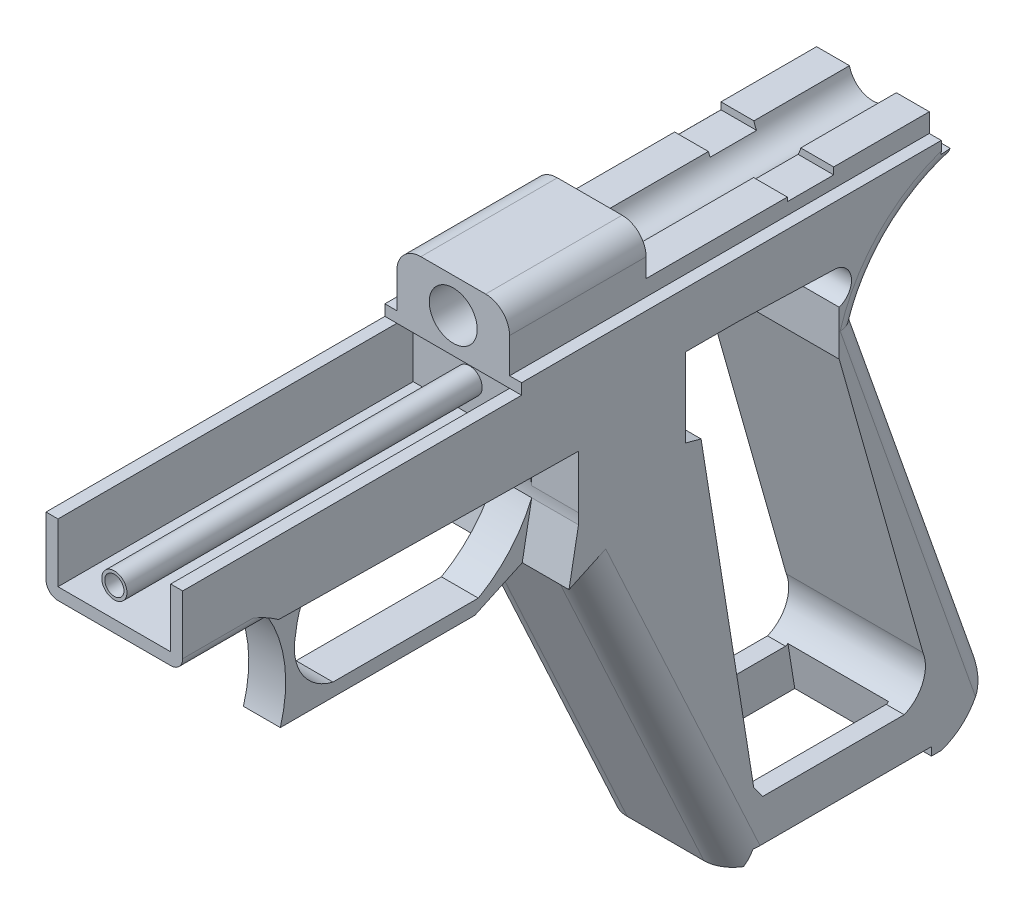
ISO-10303-21;
HEADER;
FILE_DESCRIPTION(('STEP AP214'),'2;1');
FILE_NAME('part.step','',(''),(''),'','','');
FILE_SCHEMA(('AUTOMOTIVE_DESIGN { 1 0 10303 214 1 1 1 1 }'));
ENDSEC;
DATA;
#1=APPLICATION_CONTEXT('core data for automotive mechanical design processes');
#2=APPLICATION_PROTOCOL_DEFINITION('international standard','automotive_design',2000,#1);
#3=PRODUCT_CONTEXT('',#1,'mechanical');
#4=PRODUCT('Part','Part','',(#3));
#5=PRODUCT_RELATED_PRODUCT_CATEGORY('part','',(#4));
#6=PRODUCT_DEFINITION_FORMATION('','',#4);
#7=PRODUCT_DEFINITION_CONTEXT('part definition',#1,'design');
#8=PRODUCT_DEFINITION('design','',#6,#7);
#9=PRODUCT_DEFINITION_SHAPE('','',#8);
#10=(LENGTH_UNIT() NAMED_UNIT(*) SI_UNIT(.MILLI.,.METRE.));
#11=(NAMED_UNIT(*) PLANE_ANGLE_UNIT() SI_UNIT($,.RADIAN.));
#12=(NAMED_UNIT(*) SI_UNIT($,.STERADIAN.) SOLID_ANGLE_UNIT());
#13=UNCERTAINTY_MEASURE_WITH_UNIT(LENGTH_MEASURE(1.E-05),#10,'distance_accuracy_value','');
#14=(GEOMETRIC_REPRESENTATION_CONTEXT(3) GLOBAL_UNCERTAINTY_ASSIGNED_CONTEXT((#13)) GLOBAL_UNIT_ASSIGNED_CONTEXT((#10,
#11,#12)) REPRESENTATION_CONTEXT('',''));
#15=CARTESIAN_POINT('',(0.,0.,0.));
#16=DIRECTION('',(0.,0.,1.));
#17=DIRECTION('',(1.,0.,0.));
#18=AXIS2_PLACEMENT_3D('',#15,#16,#17);
#19=CARTESIAN_POINT('',(28.956,-9.72797853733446,-145.974788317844));
#20=DIRECTION('',(0.,-1.,0.));
#21=DIRECTION('',(0.,0.,-1.));
#22=AXIS2_PLACEMENT_3D('',#19,#20,#21);
#23=PLANE('',#22);
#24=DIRECTION('',(0.,0.,1.));
#25=VECTOR('',#24,1.);
#26=CARTESIAN_POINT('',(26.416,-9.72797853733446,-166.224600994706));
#27=LINE('',#26,#25);
#28=CARTESIAN_POINT('',(26.416,-9.72797853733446,-166.224600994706));
#29=VERTEX_POINT('',#28);
#30=CARTESIAN_POINT('',(26.416,-9.72797853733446,-145.974788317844));
#31=VERTEX_POINT('',#30);
#32=EDGE_CURVE('E563',#29,#31,#27,.T.);
#33=ORIENTED_EDGE('',*,*,#32,.F.);
#34=DIRECTION('',(-1.,0.,0.));
#35=VECTOR('',#34,1.);
#36=CARTESIAN_POINT('',(28.956,-9.72797853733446,-166.224600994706));
#37=LINE('',#36,#35);
#38=CARTESIAN_POINT('',(19.4404255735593,-9.72797853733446,-166.224600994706));
#39=VERTEX_POINT('',#38);
#40=EDGE_CURVE('E568',#29,#39,#37,.T.);
#41=ORIENTED_EDGE('',*,*,#40,.T.);
#42=DIRECTION('',(0.,0.,1.));
#43=VECTOR('',#42,1.);
#44=CARTESIAN_POINT('',(19.4404255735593,-9.72797853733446,-185.525361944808));
#45=LINE('',#44,#43);
#46=CARTESIAN_POINT('',(19.4404255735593,-9.72797853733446,-145.974788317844));
#47=VERTEX_POINT('',#46);
#48=EDGE_CURVE('E798',#39,#47,#45,.T.);
#49=ORIENTED_EDGE('',*,*,#48,.T.);
#50=DIRECTION('',(-1.,0.,0.));
#51=VECTOR('',#50,1.);
#52=CARTESIAN_POINT('',(28.956,-9.72797853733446,-145.974788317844));
#53=LINE('',#52,#51);
#54=EDGE_CURVE('E1178',#31,#47,#53,.T.);
#55=ORIENTED_EDGE('',*,*,#54,.F.);
#56=EDGE_LOOP('',(#33,#41,#49,#55));
#57=FACE_BOUND('',#56,.T.);
#58=ADVANCED_FACE('F38',(#57),#23,.F.);
#59=CARTESIAN_POINT('',(28.956,-11.1953562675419,-145.974788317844));
#60=DIRECTION('',(0.,0.,-1.));
#61=DIRECTION('',(-1.,0.,0.));
#62=AXIS2_PLACEMENT_3D('',#59,#60,#61);
#63=PLANE('',#62);
#64=DIRECTION('',(0.,-1.,0.));
#65=VECTOR('',#64,1.);
#66=CARTESIAN_POINT('',(26.416,-11.1953562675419,-145.974788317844));
#67=LINE('',#66,#65);
#68=CARTESIAN_POINT('',(26.416,-11.1953562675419,-145.974788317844));
#69=VERTEX_POINT('',#68);
#70=EDGE_CURVE('E573',#31,#69,#67,.T.);
#71=ORIENTED_EDGE('',*,*,#70,.F.);
#72=ORIENTED_EDGE('',*,*,#54,.T.);
#73=CARTESIAN_POINT('',(14.478,-8.6413634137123,-145.974788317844));
#74=DIRECTION('',(0.,0.,-1.));
#75=DIRECTION('',(-1.,0.,0.));
#76=AXIS2_PLACEMENT_3D('',#73,#74,#75);
#77=CIRCLE('',#76,5.08);
#78=CARTESIAN_POINT('',(18.8693005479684,-11.1953562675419,-145.974788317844));
#79=VERTEX_POINT('',#78);
#80=EDGE_CURVE('E794',#47,#79,#77,.T.);
#81=ORIENTED_EDGE('',*,*,#80,.T.);
#82=DIRECTION('',(-1.,0.,0.));
#83=VECTOR('',#82,1.);
#84=CARTESIAN_POINT('',(28.956,-11.1953562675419,-145.974788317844));
#85=LINE('',#84,#83);
#86=EDGE_CURVE('E1179',#69,#79,#85,.T.);
#87=ORIENTED_EDGE('',*,*,#86,.F.);
#88=EDGE_LOOP('',(#71,#72,#81,#87));
#89=FACE_BOUND('',#88,.T.);
#90=ADVANCED_FACE('F1150',(#89),#63,.F.);
#91=CARTESIAN_POINT('',(28.956,-11.1953562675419,-136.154964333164));
#92=DIRECTION('',(0.,-1.,0.));
#93=DIRECTION('',(0.,0.,-1.));
#94=AXIS2_PLACEMENT_3D('',#91,#92,#93);
#95=PLANE('',#94);
#96=DIRECTION('',(0.,0.,1.));
#97=VECTOR('',#96,1.);
#98=CARTESIAN_POINT('',(26.416,-11.1953562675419,-136.154964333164));
#99=LINE('',#98,#97);
#100=CARTESIAN_POINT('',(26.416,-11.1953562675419,-136.154964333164));
#101=VERTEX_POINT('',#100);
#102=EDGE_CURVE('E562',#69,#101,#99,.T.);
#103=ORIENTED_EDGE('',*,*,#102,.F.);
#104=ORIENTED_EDGE('',*,*,#86,.T.);
#105=DIRECTION('',(0.,0.,1.));
#106=VECTOR('',#105,1.);
#107=CARTESIAN_POINT('',(18.8693005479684,-11.1953562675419,-185.525361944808));
#108=LINE('',#107,#106);
#109=CARTESIAN_POINT('',(18.8693005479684,-11.1953562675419,-136.154964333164));
#110=VERTEX_POINT('',#109);
#111=EDGE_CURVE('E788',#79,#110,#108,.T.);
#112=ORIENTED_EDGE('',*,*,#111,.T.);
#113=DIRECTION('',(-1.,0.,0.));
#114=VECTOR('',#113,1.);
#115=CARTESIAN_POINT('',(28.956,-11.1953562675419,-136.154964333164));
#116=LINE('',#115,#114);
#117=EDGE_CURVE('E1310',#101,#110,#116,.T.);
#118=ORIENTED_EDGE('',*,*,#117,.F.);
#119=EDGE_LOOP('',(#103,#104,#112,#118));
#120=FACE_BOUND('',#119,.T.);
#121=ADVANCED_FACE('F1157',(#120),#95,.F.);
#122=CARTESIAN_POINT('',(0.,-47.7098673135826,-177.306822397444));
#123=DIRECTION('',(1.,0.,0.));
#124=DIRECTION('',(0.,0.,-1.));
#125=AXIS2_PLACEMENT_3D('',#122,#123,#124);
#126=PLANE('',#125);
#127=DIRECTION('',(0.,0.,1.));
#128=VECTOR('',#127,1.);
#129=CARTESIAN_POINT('',(0.,-25.4329834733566,-112.016223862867));
#130=LINE('',#129,#128);
#131=CARTESIAN_POINT('',(0.,-25.4329834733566,-123.235406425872));
#132=VERTEX_POINT('',#131);
#133=CARTESIAN_POINT('',(0.,-25.4329834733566,-112.016223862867));
#134=VERTEX_POINT('',#133);
#135=EDGE_CURVE('E827',#132,#134,#130,.T.);
#136=ORIENTED_EDGE('',*,*,#135,.T.);
#137=DIRECTION('',(0.,-1.,0.));
#138=VECTOR('',#137,1.);
#139=CARTESIAN_POINT('',(0.,-42.1308097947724,-112.016223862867));
#140=LINE('',#139,#138);
#141=CARTESIAN_POINT('',(0.,-42.1308097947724,-112.016223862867));
#142=VERTEX_POINT('',#141);
#143=EDGE_CURVE('E855',#134,#142,#140,.T.);
#144=ORIENTED_EDGE('',*,*,#143,.T.);
#145=DIRECTION('',(0.,-0.262696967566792,-0.964878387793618));
#146=VECTOR('',#145,1.);
#147=CARTESIAN_POINT('',(0.,-43.0355246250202,-115.339215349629));
#148=LINE('',#147,#146);
#149=CARTESIAN_POINT('',(0.,-43.0355246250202,-115.339215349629));
#150=VERTEX_POINT('',#149);
#151=EDGE_CURVE('E858',#142,#150,#148,.T.);
#152=ORIENTED_EDGE('',*,*,#151,.T.);
#153=DIRECTION('',(0.,-0.987367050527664,-0.158449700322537));
#154=VECTOR('',#153,1.);
#155=CARTESIAN_POINT('',(0.,-112.514011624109,-126.488914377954));
#156=LINE('',#155,#154);
#157=CARTESIAN_POINT('',(0.,-112.514011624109,-126.488914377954));
#158=VERTEX_POINT('',#157);
#159=EDGE_CURVE('E861',#150,#158,#156,.T.);
#160=ORIENTED_EDGE('',*,*,#159,.T.);
#161=DIRECTION('',(0.,-0.812673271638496,-0.582719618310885));
#162=VECTOR('',#161,1.);
#163=CARTESIAN_POINT('',(0.,-115.153554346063,-128.381573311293));
#164=LINE('',#163,#162);
#165=CARTESIAN_POINT('',(0.,-115.153554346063,-128.381573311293));
#166=VERTEX_POINT('',#165);
#167=EDGE_CURVE('E864',#158,#166,#164,.T.);
#168=ORIENTED_EDGE('',*,*,#167,.T.);
#169=DIRECTION('',(0.,0.,-1.));
#170=VECTOR('',#169,1.);
#171=CARTESIAN_POINT('',(0.,-115.153554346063,-158.369711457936));
#172=LINE('',#171,#170);
#173=CARTESIAN_POINT('',(0.,-115.153554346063,-158.369711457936));
#174=VERTEX_POINT('',#173);
#175=EDGE_CURVE('E867',#166,#174,#172,.T.);
#176=ORIENTED_EDGE('',*,*,#175,.T.);
#177=CARTESIAN_POINT('',(0.,-108.457336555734,-155.63417362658));
#178=DIRECTION('',(1.,0.,0.));
#179=DIRECTION('',(0.,0.,1.));
#180=AXIS2_PLACEMENT_3D('',#177,#178,#179);
#181=CIRCLE('',#180,7.23342933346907);
#182=CARTESIAN_POINT('',(0.,-105.721798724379,-162.330391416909));
#183=VERTEX_POINT('',#182);
#184=EDGE_CURVE('E870',#174,#183,#181,.T.);
#185=ORIENTED_EDGE('',*,*,#184,.T.);
#186=DIRECTION('',(0.,0.962220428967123,0.272271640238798));
#187=VECTOR('',#186,1.);
#188=CARTESIAN_POINT('',(0.,-43.0355246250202,-144.592569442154));
#189=LINE('',#188,#187);
#190=CARTESIAN_POINT('',(0.,-43.0355246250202,-144.592569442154));
#191=VERTEX_POINT('',#190);
#192=EDGE_CURVE('E873',#183,#191,#189,.T.);
#193=ORIENTED_EDGE('',*,*,#192,.T.);
#194=DIRECTION('',(0.,1.,0.));
#195=VECTOR('',#194,1.);
#196=CARTESIAN_POINT('',(0.,-33.5030565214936,-144.592569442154));
#197=LINE('',#196,#195);
#198=CARTESIAN_POINT('',(0.,-33.5030565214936,-144.592569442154));
#199=VERTEX_POINT('',#198);
#200=EDGE_CURVE('E876',#191,#199,#197,.T.);
#201=ORIENTED_EDGE('',*,*,#200,.T.);
#202=CARTESIAN_POINT('',(0.,-29.8716423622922,-143.384274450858));
#203=DIRECTION('',(1.,0.,0.));
#204=DIRECTION('',(0.,0.,1.));
#205=AXIS2_PLACEMENT_3D('',#202,#203,#204);
#206=CIRCLE('',#205,3.82715894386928);
#207=CARTESIAN_POINT('',(0.,-26.0851105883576,-143.940442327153));
#208=VERTEX_POINT('',#207);
#209=EDGE_CURVE('E879',#199,#208,#206,.T.);
#210=ORIENTED_EDGE('',*,*,#209,.T.);
#211=DIRECTION('',(0.,0.0314804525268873,0.999504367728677));
#212=VECTOR('',#211,1.);
#213=CARTESIAN_POINT('',(0.,-25.4329834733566,-123.235406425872));
#214=LINE('',#213,#212);
#215=EDGE_CURVE('E831',#208,#132,#214,.T.);
#216=ORIENTED_EDGE('',*,*,#215,.T.);
#217=EDGE_LOOP('',(#136,#144,#152,#160,#168,#176,#185,#193,#201,#210,#216));
#218=FACE_BOUND('',#217,.T.);
#219=DIRECTION('',(0.,0.,1.));
#220=VECTOR('',#219,1.);
#221=CARTESIAN_POINT('',(0.,-13.7213634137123,-77.3213619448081));
#222=LINE('',#221,#220);
#223=CARTESIAN_POINT('',(0.,-13.7213634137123,-166.224600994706));
#224=VERTEX_POINT('',#223);
#225=CARTESIAN_POINT('',(0.,-13.7213634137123,-77.3213619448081));
#226=VERTEX_POINT('',#225);
#227=EDGE_CURVE('E635',#224,#226,#222,.T.);
#228=ORIENTED_EDGE('',*,*,#227,.F.);
#229=DIRECTION('',(0.,1.,0.));
#230=VECTOR('',#229,1.);
#231=CARTESIAN_POINT('',(0.,-9.72797853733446,-166.224600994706));
#232=LINE('',#231,#230);
#233=CARTESIAN_POINT('',(0.,-15.6539742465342,-166.224600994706));
#234=VERTEX_POINT('',#233);
#235=EDGE_CURVE('E1282',#234,#224,#232,.T.);
#236=ORIENTED_EDGE('',*,*,#235,.F.);
#237=CARTESIAN_POINT('',(0.,-47.7098673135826,-177.306822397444));
#238=DIRECTION('',(1.,0.,0.));
#239=DIRECTION('',(0.,0.,-1.));
#240=AXIS2_PLACEMENT_3D('',#237,#238,#239);
#241=CIRCLE('',#240,33.9174868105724);
#242=CARTESIAN_POINT('',(0.,-37.9963270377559,-144.810006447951));
#243=VERTEX_POINT('',#242);
#244=EDGE_CURVE('E1055',#234,#243,#241,.T.);
#245=ORIENTED_EDGE('',*,*,#244,.T.);
#246=DIRECTION('',(0.,0.943221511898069,0.332164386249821));
#247=VECTOR('',#246,1.);
#248=CARTESIAN_POINT('',(0.,-56.8195432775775,-151.43878027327));
#249=LINE('',#248,#247);
#250=CARTESIAN_POINT('',(0.,-119.38501078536,-173.47180205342));
#251=VERTEX_POINT('',#250);
#252=EDGE_CURVE('E1053',#243,#251,#249,.F.);
#253=ORIENTED_EDGE('',*,*,#252,.T.);
#254=CARTESIAN_POINT('',(0.,-113.79550318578,-162.330391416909));
#255=DIRECTION('',(1.,0.,0.));
#256=DIRECTION('',(0.,0.,1.));
#257=AXIS2_PLACEMENT_3D('',#254,#255,#256);
#258=CIRCLE('',#257,12.4648957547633);
#259=CARTESIAN_POINT('',(0.,-125.636481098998,-166.224600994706));
#260=VERTEX_POINT('',#259);
#261=EDGE_CURVE('E1279',#260,#251,#258,.T.);
#262=ORIENTED_EDGE('',*,*,#261,.F.);
#263=DIRECTION('',(0.,0.,-1.));
#264=VECTOR('',#263,1.);
#265=CARTESIAN_POINT('',(0.,-125.636481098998,-166.224600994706));
#266=LINE('',#265,#264);
#267=CARTESIAN_POINT('',(0.,-125.636481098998,-164.138693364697));
#268=VERTEX_POINT('',#267);
#269=EDGE_CURVE('E1277',#268,#260,#266,.T.);
#270=ORIENTED_EDGE('',*,*,#269,.F.);
#271=DIRECTION('',(0.,-1.,0.));
#272=VECTOR('',#271,1.);
#273=CARTESIAN_POINT('',(0.,-125.636481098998,-164.138693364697));
#274=LINE('',#273,#272);
#275=CARTESIAN_POINT('',(0.,-123.893435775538,-164.138693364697));
#276=VERTEX_POINT('',#275);
#277=EDGE_CURVE('E1275',#276,#268,#274,.T.);
#278=ORIENTED_EDGE('',*,*,#277,.F.);
#279=DIRECTION('',(0.,0.,-1.));
#280=VECTOR('',#279,1.);
#281=CARTESIAN_POINT('',(0.,-123.893435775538,-164.138693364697));
#282=LINE('',#281,#280);
#283=CARTESIAN_POINT('',(0.,-123.893435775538,-127.832654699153));
#284=VERTEX_POINT('',#283);
#285=EDGE_CURVE('E1273',#284,#276,#282,.T.);
#286=ORIENTED_EDGE('',*,*,#285,.F.);
#287=DIRECTION('',(0.,-0.907862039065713,-0.419269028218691));
#288=VECTOR('',#287,1.);
#289=CARTESIAN_POINT('',(0.,-79.9336813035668,-107.531152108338));
#290=LINE('',#289,#288);
#291=CARTESIAN_POINT('',(0.,-53.1126455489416,-95.1446560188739));
#292=VERTEX_POINT('',#291);
#293=EDGE_CURVE('E957',#284,#292,#290,.F.);
#294=ORIENTED_EDGE('',*,*,#293,.T.);
#295=DIRECTION('',(0.,0.419269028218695,-0.907862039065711));
#296=VECTOR('',#295,1.);
#297=CARTESIAN_POINT('',(0.,-55.7750038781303,-89.3797320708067));
#298=LINE('',#297,#296);
#299=CARTESIAN_POINT('',(0.,-56.704641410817,-87.3667462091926));
#300=VERTEX_POINT('',#299);
#301=EDGE_CURVE('E1266',#300,#292,#298,.T.);
#302=ORIENTED_EDGE('',*,*,#301,.F.);
#303=DIRECTION('',(0.,-0.983349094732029,0.18172660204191));
#304=VECTOR('',#303,1.);
#305=CARTESIAN_POINT('',(0.,-45.8120819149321,-89.3797320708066));
#306=LINE('',#305,#304);
#307=CARTESIAN_POINT('',(0.,-45.8120819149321,-89.3797320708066));
#308=VERTEX_POINT('',#307);
#309=EDGE_CURVE('E673',#308,#300,#306,.T.);
#310=ORIENTED_EDGE('',*,*,#309,.F.);
#311=CARTESIAN_POINT('',(0.,-44.7032161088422,-76.9536110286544));
#312=DIRECTION('',(1.,0.,0.));
#313=DIRECTION('',(0.,0.,1.));
#314=AXIS2_PLACEMENT_3D('',#311,#312,#313);
#315=CIRCLE('',#314,12.475498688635);
#316=CARTESIAN_POINT('',(0.,-43.5943503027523,-89.3797320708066));
#317=VERTEX_POINT('',#316);
#318=EDGE_CURVE('E909',#308,#317,#315,.T.);
#319=ORIENTED_EDGE('',*,*,#318,.T.);
#320=DIRECTION('',(0.,-1.,0.));
#321=VECTOR('',#320,1.);
#322=CARTESIAN_POINT('',(0.,-45.8120819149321,-89.3797320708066));
#323=LINE('',#322,#321);
#324=CARTESIAN_POINT('',(0.,-32.3068857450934,-89.3797320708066));
#325=VERTEX_POINT('',#324);
#326=EDGE_CURVE('E666',#325,#317,#323,.T.);
#327=ORIENTED_EDGE('',*,*,#326,.F.);
#328=DIRECTION('',(0.,-0.0137006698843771,-0.999906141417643));
#329=VECTOR('',#328,1.);
#330=CARTESIAN_POINT('',(0.,-32.3068857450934,-89.3797320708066));
#331=LINE('',#330,#329);
#332=CARTESIAN_POINT('',(0.,-31.4366550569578,-25.8683113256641));
#333=VERTEX_POINT('',#332);
#334=EDGE_CURVE('E685',#333,#325,#331,.T.);
#335=ORIENTED_EDGE('',*,*,#334,.F.);
#336=CARTESIAN_POINT('',(0.,-53.564828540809,-10.06914657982));
#337=DIRECTION('',(-1.,0.,0.));
#338=DIRECTION('',(0.,0.,-1.));
#339=AXIS2_PLACEMENT_3D('',#336,#337,#338);
#340=CIRCLE('',#339,27.1895139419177);
#341=CARTESIAN_POINT('',(0.,-28.4611888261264,-20.513137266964));
#342=VERTEX_POINT('',#341);
#343=EDGE_CURVE('E1262',#342,#333,#340,.T.);
#344=ORIENTED_EDGE('',*,*,#343,.F.);
#345=DIRECTION('',(0.,0.,-1.));
#346=VECTOR('',#345,1.);
#347=CARTESIAN_POINT('',(0.,-28.4611888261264,-177.306822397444));
#348=LINE('',#347,#346);
#349=CARTESIAN_POINT('',(0.,-28.4611888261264,-5.5362938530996));
#350=VERTEX_POINT('',#349);
#351=EDGE_CURVE('E1401',#342,#350,#348,.F.);
#352=ORIENTED_EDGE('',*,*,#351,.T.);
#353=DIRECTION('',(0.,-1.,0.));
#354=VECTOR('',#353,1.);
#355=CARTESIAN_POINT('',(0.,-31.0011888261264,-5.5362938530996));
#356=LINE('',#355,#354);
#357=CARTESIAN_POINT('',(0.,-16.0220816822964,-5.5362938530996));
#358=VERTEX_POINT('',#357);
#359=EDGE_CURVE('E1267',#358,#350,#356,.T.);
#360=ORIENTED_EDGE('',*,*,#359,.F.);
#361=DIRECTION('',(0.,0.,1.));
#362=VECTOR('',#361,1.);
#363=CARTESIAN_POINT('',(0.,-16.0220816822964,-5.5362938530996));
#364=LINE('',#363,#362);
#365=CARTESIAN_POINT('',(0.,-16.0220816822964,-77.3213619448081));
#366=VERTEX_POINT('',#365);
#367=EDGE_CURVE('E1287',#366,#358,#364,.T.);
#368=ORIENTED_EDGE('',*,*,#367,.F.);
#369=DIRECTION('',(0.,-1.,0.));
#370=VECTOR('',#369,1.);
#371=CARTESIAN_POINT('',(0.,-16.0220816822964,-77.3213619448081));
#372=LINE('',#371,#370);
#373=EDGE_CURVE('E1285',#226,#366,#372,.T.);
#374=ORIENTED_EDGE('',*,*,#373,.F.);
#375=EDGE_LOOP('',(#228,#236,#245,#253,#262,#270,#278,#286,#294,#302,#310,#319,#327,#335,#344,
#352,#360,#368,#374));
#376=FACE_BOUND('',#375,.T.);
#377=ADVANCED_FACE('F995',(#218,#376),#126,.F.);
#378=CARTESIAN_POINT('',(28.956,-9.72797853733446,-166.224600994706));
#379=DIRECTION('',(0.,0.,1.));
#380=DIRECTION('',(1.,0.,0.));
#381=AXIS2_PLACEMENT_3D('',#378,#379,#380);
#382=PLANE('',#381);
#383=DIRECTION('',(0.,1.,0.));
#384=VECTOR('',#383,1.);
#385=CARTESIAN_POINT('',(26.416,-13.7213634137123,-166.224600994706));
#386=LINE('',#385,#384);
#387=CARTESIAN_POINT('',(26.416,-13.7213634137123,-166.224600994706));
#388=VERTEX_POINT('',#387);
#389=EDGE_CURVE('E545',#388,#29,#386,.T.);
#390=ORIENTED_EDGE('',*,*,#389,.F.);
#391=DIRECTION('',(1.,0.,0.));
#392=VECTOR('',#391,1.);
#393=CARTESIAN_POINT('',(26.416,-13.7213634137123,-166.224600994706));
#394=LINE('',#393,#392);
#395=CARTESIAN_POINT('',(28.956,-13.7213634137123,-166.224600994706));
#396=VERTEX_POINT('',#395);
#397=EDGE_CURVE('E556',#388,#396,#394,.T.);
#398=ORIENTED_EDGE('',*,*,#397,.T.);
#399=DIRECTION('',(0.,1.,0.));
#400=VECTOR('',#399,1.);
#401=CARTESIAN_POINT('',(28.956,-9.72797853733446,-166.224600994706));
#402=LINE('',#401,#400);
#403=CARTESIAN_POINT('',(28.956,-15.6539742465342,-166.224600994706));
#404=VERTEX_POINT('',#403);
#405=EDGE_CURVE('E1371',#404,#396,#402,.T.);
#406=ORIENTED_EDGE('',*,*,#405,.F.);
#407=CARTESIAN_POINT('',(28.956,-15.6539742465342,-166.224600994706));
#408=CARTESIAN_POINT('',(28.9559805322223,-15.7675584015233,-166.224600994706));
#409=CARTESIAN_POINT('',(28.9514692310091,-15.8807842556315,-166.224600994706));
#410=CARTESIAN_POINT('',(28.9334629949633,-16.1065189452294,-166.224600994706));
#411=CARTESIAN_POINT('',(28.9199680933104,-16.2190277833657,-166.224600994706));
#412=CARTESIAN_POINT('',(28.9019813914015,-16.3311783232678,-166.224600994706));
#413=B_SPLINE_CURVE_WITH_KNOTS('',3,(#407,#408,#409,#410,#411,#412),.UNSPECIFIED.,.F.,.F.,(4,2,
4),(0.,0.339947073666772,0.679892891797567),.UNSPECIFIED.);
#414=CARTESIAN_POINT('',(28.9019813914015,-16.3311783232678,-166.224600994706));
#415=VERTEX_POINT('',#414);
#416=EDGE_CURVE('E980',#404,#415,#413,.T.);
#417=ORIENTED_EDGE('',*,*,#416,.T.);
#418=DIRECTION('',(-1.,0.,0.));
#419=VECTOR('',#418,1.);
#420=CARTESIAN_POINT('',(28.956,-16.3311783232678,-166.224600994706));
#421=LINE('',#420,#419);
#422=CARTESIAN_POINT('',(0.0540186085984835,-16.3311783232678,-166.224600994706));
#423=VERTEX_POINT('',#422);
#424=EDGE_CURVE('E1186',#415,#423,#421,.T.);
#425=ORIENTED_EDGE('',*,*,#424,.T.);
#426=CARTESIAN_POINT('',(0.0540186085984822,-16.3311783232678,-166.224600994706));
#427=CARTESIAN_POINT('',(0.0360319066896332,-16.2190277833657,-166.224600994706));
#428=CARTESIAN_POINT('',(0.0225370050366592,-16.1065189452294,-166.224600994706));
#429=CARTESIAN_POINT('',(0.00453076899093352,-15.8807842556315,-166.224600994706));
#430=CARTESIAN_POINT('',(1.94677777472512E-05,-15.7675584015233,-166.224600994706));
#431=CARTESIAN_POINT('',(0.,-15.6539742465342,-166.224600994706));
#432=B_SPLINE_CURVE_WITH_KNOTS('',3,(#426,#427,#428,#429,#430,#431),.UNSPECIFIED.,.F.,.F.,(4,2,
4),(0.,0.339945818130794,0.679892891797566),.UNSPECIFIED.);
#433=EDGE_CURVE('E973',#423,#234,#432,.T.);
#434=ORIENTED_EDGE('',*,*,#433,.T.);
#435=ORIENTED_EDGE('',*,*,#235,.T.);
#436=DIRECTION('',(-1.,0.,0.));
#437=VECTOR('',#436,1.);
#438=CARTESIAN_POINT('',(2.54,-13.7213634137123,-166.224600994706));
#439=LINE('',#438,#437);
#440=CARTESIAN_POINT('',(2.54,-13.7213634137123,-166.224600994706));
#441=VERTEX_POINT('',#440);
#442=EDGE_CURVE('E586',#441,#224,#439,.T.);
#443=ORIENTED_EDGE('',*,*,#442,.F.);
#444=DIRECTION('',(0.,1.,0.));
#445=VECTOR('',#444,1.);
#446=CARTESIAN_POINT('',(2.54,-9.72797853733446,-166.224600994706));
#447=LINE('',#446,#445);
#448=CARTESIAN_POINT('',(2.54,-9.72797853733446,-166.224600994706));
#449=VERTEX_POINT('',#448);
#450=EDGE_CURVE('E575',#441,#449,#447,.T.);
#451=ORIENTED_EDGE('',*,*,#450,.T.);
#452=CARTESIAN_POINT('',(9.51557442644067,-9.72797853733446,-166.224600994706));
#453=VERTEX_POINT('',#452);
#454=EDGE_CURVE('E1173',#453,#449,#37,.T.);
#455=ORIENTED_EDGE('',*,*,#454,.F.);
#456=CARTESIAN_POINT('',(14.478,-8.6413634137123,-166.224600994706));
#457=DIRECTION('',(0.,0.,1.));
#458=DIRECTION('',(1.,0.,0.));
#459=AXIS2_PLACEMENT_3D('',#456,#457,#458);
#460=CIRCLE('',#459,5.08);
#461=EDGE_CURVE('E801',#453,#39,#460,.T.);
#462=ORIENTED_EDGE('',*,*,#461,.T.);
#463=ORIENTED_EDGE('',*,*,#40,.F.);
#464=EDGE_LOOP('',(#390,#398,#406,#417,#425,#434,#435,#443,#451,#455,#462,#463));
#465=FACE_BOUND('',#464,.T.);
#466=ADVANCED_FACE('F566',(#465),#382,.F.);
#467=DIRECTION('',(0.,0.,1.));
#468=VECTOR('',#467,1.);
#469=CARTESIAN_POINT('',(2.54,-9.72797853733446,-145.974788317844));
#470=LINE('',#469,#468);
#471=CARTESIAN_POINT('',(2.54,-9.72797853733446,-145.974788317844));
#472=VERTEX_POINT('',#471);
#473=EDGE_CURVE('E578',#449,#472,#470,.T.);
#474=ORIENTED_EDGE('',*,*,#473,.T.);
#475=CARTESIAN_POINT('',(9.51557442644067,-9.72797853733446,-145.974788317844));
#476=VERTEX_POINT('',#475);
#477=EDGE_CURVE('E1171',#476,#472,#53,.T.);
#478=ORIENTED_EDGE('',*,*,#477,.F.);
#479=DIRECTION('',(0.,0.,1.));
#480=VECTOR('',#479,1.);
#481=CARTESIAN_POINT('',(9.51557442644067,-9.72797853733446,-185.525361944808));
#482=LINE('',#481,#480);
#483=EDGE_CURVE('E795',#476,#453,#482,.F.);
#484=ORIENTED_EDGE('',*,*,#483,.T.);
#485=ORIENTED_EDGE('',*,*,#454,.T.);
#486=EDGE_LOOP('',(#474,#478,#484,#485));
#487=FACE_BOUND('',#486,.T.);
#488=ADVANCED_FACE('F994',(#487),#23,.F.);
#489=DIRECTION('',(0.,-1.,0.));
#490=VECTOR('',#489,1.);
#491=CARTESIAN_POINT('',(2.54,-11.1953562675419,-145.974788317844));
#492=LINE('',#491,#490);
#493=CARTESIAN_POINT('',(2.54,-11.1953562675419,-145.974788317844));
#494=VERTEX_POINT('',#493);
#495=EDGE_CURVE('E581',#472,#494,#492,.T.);
#496=ORIENTED_EDGE('',*,*,#495,.T.);
#497=CARTESIAN_POINT('',(10.0866994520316,-11.1953562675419,-145.974788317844));
#498=VERTEX_POINT('',#497);
#499=EDGE_CURVE('E1181',#498,#494,#85,.T.);
#500=ORIENTED_EDGE('',*,*,#499,.F.);
#501=EDGE_CURVE('E791',#498,#476,#77,.T.);
#502=ORIENTED_EDGE('',*,*,#501,.T.);
#503=ORIENTED_EDGE('',*,*,#477,.T.);
#504=EDGE_LOOP('',(#496,#500,#502,#503));
#505=FACE_BOUND('',#504,.T.);
#506=ADVANCED_FACE('F1159',(#505),#63,.F.);
#507=DIRECTION('',(0.,0.,1.));
#508=VECTOR('',#507,1.);
#509=CARTESIAN_POINT('',(2.54,-11.1953562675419,-136.154964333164));
#510=LINE('',#509,#508);
#511=CARTESIAN_POINT('',(2.54,-11.1953562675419,-136.154964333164));
#512=VERTEX_POINT('',#511);
#513=EDGE_CURVE('E584',#494,#512,#510,.T.);
#514=ORIENTED_EDGE('',*,*,#513,.T.);
#515=CARTESIAN_POINT('',(10.0866994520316,-11.1953562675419,-136.154964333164));
#516=VERTEX_POINT('',#515);
#517=EDGE_CURVE('E1309',#516,#512,#116,.T.);
#518=ORIENTED_EDGE('',*,*,#517,.F.);
#519=DIRECTION('',(0.,0.,1.));
#520=VECTOR('',#519,1.);
#521=CARTESIAN_POINT('',(10.0866994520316,-11.1953562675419,-185.525361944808));
#522=LINE('',#521,#520);
#523=EDGE_CURVE('E785',#516,#498,#522,.F.);
#524=ORIENTED_EDGE('',*,*,#523,.T.);
#525=ORIENTED_EDGE('',*,*,#499,.T.);
#526=EDGE_LOOP('',(#514,#518,#524,#525));
#527=FACE_BOUND('',#526,.T.);
#528=ADVANCED_FACE('F1111',(#527),#95,.F.);
#529=CARTESIAN_POINT('',(28.956,-61.3438027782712,-77.3213619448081));
#530=DIRECTION('',(0.,1.,0.));
#531=DIRECTION('',(0.,0.,1.));
#532=AXIS2_PLACEMENT_3D('',#529,#530,#531);
#533=PLANE('',#532);
#534=DIRECTION('',(0.,0.,-1.));
#535=VECTOR('',#534,1.);
#536=CARTESIAN_POINT('',(19.05,-61.3438027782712,-77.3213619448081));
#537=LINE('',#536,#535);
#538=CARTESIAN_POINT('',(19.05,-61.3438027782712,-36.1221162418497));
#539=VERTEX_POINT('',#538);
#540=CARTESIAN_POINT('',(19.05,-61.3438027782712,-77.3213619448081));
#541=VERTEX_POINT('',#540);
#542=EDGE_CURVE('E592',#539,#541,#537,.T.);
#543=ORIENTED_EDGE('',*,*,#542,.F.);
#544=DIRECTION('',(-1.,0.,0.));
#545=VECTOR('',#544,1.);
#546=CARTESIAN_POINT('',(28.956,-61.3438027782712,-36.1221162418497));
#547=LINE('',#546,#545);
#548=CARTESIAN_POINT('',(11.2324893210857,-61.3438027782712,-36.1221162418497));
#549=VERTEX_POINT('',#548);
#550=EDGE_CURVE('E1224',#539,#549,#547,.T.);
#551=ORIENTED_EDGE('',*,*,#550,.T.);
#552=DIRECTION('',(0.,0.,-1.));
#553=VECTOR('',#552,1.);
#554=CARTESIAN_POINT('',(11.2324893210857,-61.3438027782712,-77.3213619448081));
#555=LINE('',#554,#553);
#556=CARTESIAN_POINT('',(11.2324893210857,-61.3438027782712,-77.3213619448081));
#557=VERTEX_POINT('',#556);
#558=EDGE_CURVE('E723',#549,#557,#555,.T.);
#559=ORIENTED_EDGE('',*,*,#558,.T.);
#560=DIRECTION('',(-1.,0.,0.));
#561=VECTOR('',#560,1.);
#562=CARTESIAN_POINT('',(28.956,-61.3438027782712,-77.3213619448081));
#563=LINE('',#562,#561);
#564=EDGE_CURVE('E1222',#541,#557,#563,.T.);
#565=ORIENTED_EDGE('',*,*,#564,.F.);
#566=EDGE_LOOP('',(#543,#551,#559,#565));
#567=FACE_BOUND('',#566,.T.);
#568=ADVANCED_FACE('F1107',(#567),#533,.F.);
#569=CARTESIAN_POINT('',(28.956,-35.6206776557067,-65.0628518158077));
#570=DIRECTION('',(-1.,0.,0.));
#571=DIRECTION('',(0.,0.,1.));
#572=AXIS2_PLACEMENT_3D('',#569,#570,#571);
#573=CYLINDRICAL_SURFACE('',#572,26.3661788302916);
#574=DIRECTION('',(-1.,0.,0.));
#575=VECTOR('',#574,1.);
#576=CARTESIAN_POINT('',(28.956,-58.5594033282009,-78.0624768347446));
#577=LINE('',#576,#575);
#578=CARTESIAN_POINT('',(19.05,-58.5594033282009,-78.0624768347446));
#579=VERTEX_POINT('',#578);
#580=CARTESIAN_POINT('',(11.2324893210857,-58.5594033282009,-78.0624768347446));
#581=VERTEX_POINT('',#580);
#582=EDGE_CURVE('E913',#579,#581,#577,.T.);
#583=ORIENTED_EDGE('',*,*,#582,.F.);
#584=CARTESIAN_POINT('',(19.05,-35.6206776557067,-65.0628518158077));
#585=DIRECTION('',(1.,0.,0.));
#586=DIRECTION('',(0.,0.,-1.));
#587=AXIS2_PLACEMENT_3D('',#584,#585,#586);
#588=CIRCLE('',#587,26.3661788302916);
#589=CARTESIAN_POINT('',(19.05,-45.8120819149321,-89.3797320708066));
#590=VERTEX_POINT('',#589);
#591=EDGE_CURVE('E632',#579,#590,#588,.T.);
#592=ORIENTED_EDGE('',*,*,#591,.T.);
#593=DIRECTION('',(-1.,0.,0.));
#594=VECTOR('',#593,1.);
#595=CARTESIAN_POINT('',(28.956,-45.8120819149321,-89.3797320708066));
#596=LINE('',#595,#594);
#597=CARTESIAN_POINT('',(11.2324893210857,-45.8120819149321,-89.3797320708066));
#598=VERTEX_POINT('',#597);
#599=EDGE_CURVE('E923',#590,#598,#596,.T.);
#600=ORIENTED_EDGE('',*,*,#599,.T.);
#601=CARTESIAN_POINT('',(11.2324893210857,-35.6206776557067,-65.0628518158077));
#602=DIRECTION('',(1.,0.,0.));
#603=DIRECTION('',(0.,0.,-1.));
#604=AXIS2_PLACEMENT_3D('',#601,#602,#603);
#605=CIRCLE('',#604,26.3661788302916);
#606=EDGE_CURVE('E715',#581,#598,#605,.T.);
#607=ORIENTED_EDGE('',*,*,#606,.F.);
#608=EDGE_LOOP('',(#583,#592,#600,#607));
#609=FACE_BOUND('',#608,.T.);
#610=ADVANCED_FACE('F1110',(#609),#573,.F.);
#611=CARTESIAN_POINT('',(28.956,-32.27709506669,-48.7366719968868));
#612=DIRECTION('',(0.,-1.,0.));
#613=DIRECTION('',(0.,0.,-1.));
#614=AXIS2_PLACEMENT_3D('',#611,#612,#613);
#615=PLANE('',#614);
#616=DIRECTION('',(-1.,0.,0.));
#617=VECTOR('',#616,1.);
#618=CARTESIAN_POINT('',(28.956,-32.27709506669,-78.0624768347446));
#619=LINE('',#618,#617);
#620=CARTESIAN_POINT('',(19.05,-32.27709506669,-78.0624768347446));
#621=VERTEX_POINT('',#620);
#622=CARTESIAN_POINT('',(11.2324893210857,-32.27709506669,-78.0624768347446));
#623=VERTEX_POINT('',#622);
#624=EDGE_CURVE('E921',#621,#623,#619,.T.);
#625=ORIENTED_EDGE('',*,*,#624,.F.);
#626=DIRECTION('',(0.,0.,1.));
#627=VECTOR('',#626,1.);
#628=CARTESIAN_POINT('',(19.05,-32.27709506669,-48.7366719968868));
#629=LINE('',#628,#627);
#630=CARTESIAN_POINT('',(19.05,-32.27709506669,-48.7366719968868));
#631=VERTEX_POINT('',#630);
#632=EDGE_CURVE('E626',#621,#631,#629,.T.);
#633=ORIENTED_EDGE('',*,*,#632,.T.);
#634=DIRECTION('',(-1.,0.,0.));
#635=VECTOR('',#634,1.);
#636=CARTESIAN_POINT('',(28.956,-32.27709506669,-48.7366719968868));
#637=LINE('',#636,#635);
#638=CARTESIAN_POINT('',(11.2324893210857,-32.27709506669,-48.7366719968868));
#639=VERTEX_POINT('',#638);
#640=EDGE_CURVE('E919',#631,#639,#637,.T.);
#641=ORIENTED_EDGE('',*,*,#640,.T.);
#642=DIRECTION('',(0.,0.,1.));
#643=VECTOR('',#642,1.);
#644=CARTESIAN_POINT('',(11.2324893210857,-32.27709506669,-48.7366719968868));
#645=LINE('',#644,#643);
#646=EDGE_CURVE('E709',#623,#639,#645,.T.);
#647=ORIENTED_EDGE('',*,*,#646,.F.);
#648=EDGE_LOOP('',(#625,#633,#641,#647));
#649=FACE_BOUND('',#648,.T.);
#650=ADVANCED_FACE('F1445',(#649),#615,.T.);
#651=CARTESIAN_POINT('',(28.956,-47.3684522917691,-56.0903242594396));
#652=DIRECTION('',(-1.,0.,0.));
#653=DIRECTION('',(0.,0.,1.));
#654=AXIS2_PLACEMENT_3D('',#651,#652,#653);
#655=CYLINDRICAL_SURFACE('',#654,16.7876521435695);
#656=ORIENTED_EDGE('',*,*,#640,.F.);
#657=CARTESIAN_POINT('',(19.05,-47.3684522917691,-56.0903242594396));
#658=DIRECTION('',(1.,0.,0.));
#659=DIRECTION('',(0.,0.,-1.));
#660=AXIS2_PLACEMENT_3D('',#657,#658,#659);
#661=CIRCLE('',#660,16.7876521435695);
#662=CARTESIAN_POINT('',(19.05,-45.8120819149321,-39.374972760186));
#663=VERTEX_POINT('',#662);
#664=EDGE_CURVE('E623',#631,#663,#661,.T.);
#665=ORIENTED_EDGE('',*,*,#664,.T.);
#666=DIRECTION('',(-1.,0.,0.));
#667=VECTOR('',#666,1.);
#668=CARTESIAN_POINT('',(28.956,-45.8120819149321,-39.374972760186));
#669=LINE('',#668,#667);
#670=CARTESIAN_POINT('',(11.2324893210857,-45.8120819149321,-39.374972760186));
#671=VERTEX_POINT('',#670);
#672=EDGE_CURVE('E917',#663,#671,#669,.T.);
#673=ORIENTED_EDGE('',*,*,#672,.T.);
#674=CARTESIAN_POINT('',(11.2324893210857,-47.3684522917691,-56.0903242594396));
#675=DIRECTION('',(1.,0.,0.));
#676=DIRECTION('',(0.,0.,-1.));
#677=AXIS2_PLACEMENT_3D('',#674,#675,#676);
#678=CIRCLE('',#677,16.7876521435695);
#679=EDGE_CURVE('E706',#639,#671,#678,.T.);
#680=ORIENTED_EDGE('',*,*,#679,.F.);
#681=EDGE_LOOP('',(#656,#665,#673,#680));
#682=FACE_BOUND('',#681,.T.);
#683=ADVANCED_FACE('F1450',(#682),#655,.F.);
#684=CARTESIAN_POINT('',(28.956,-48.2380381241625,-49.6963379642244));
#685=DIRECTION('',(-1.,0.,0.));
#686=DIRECTION('',(0.,0.,1.));
#687=AXIS2_PLACEMENT_3D('',#684,#685,#686);
#688=CYLINDRICAL_SURFACE('',#687,10.6026337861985);
#689=ORIENTED_EDGE('',*,*,#672,.F.);
#690=CARTESIAN_POINT('',(19.05,-48.2380381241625,-49.6963379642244));
#691=DIRECTION('',(1.,0.,0.));
#692=DIRECTION('',(0.,0.,-1.));
#693=AXIS2_PLACEMENT_3D('',#690,#691,#692);
#694=CIRCLE('',#693,10.6026337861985);
#695=CARTESIAN_POINT('',(19.05,-58.5594033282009,-47.2703817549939));
#696=VERTEX_POINT('',#695);
#697=EDGE_CURVE('E616',#663,#696,#694,.T.);
#698=ORIENTED_EDGE('',*,*,#697,.T.);
#699=DIRECTION('',(-1.,0.,0.));
#700=VECTOR('',#699,1.);
#701=CARTESIAN_POINT('',(28.956,-58.5594033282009,-47.2703817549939));
#702=LINE('',#701,#700);
#703=CARTESIAN_POINT('',(11.2324893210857,-58.5594033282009,-47.2703817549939));
#704=VERTEX_POINT('',#703);
#705=EDGE_CURVE('E915',#696,#704,#702,.T.);
#706=ORIENTED_EDGE('',*,*,#705,.T.);
#707=CARTESIAN_POINT('',(11.2324893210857,-48.2380381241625,-49.6963379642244));
#708=DIRECTION('',(1.,0.,0.));
#709=DIRECTION('',(0.,0.,-1.));
#710=AXIS2_PLACEMENT_3D('',#707,#708,#709);
#711=CIRCLE('',#710,10.6026337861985);
#712=EDGE_CURVE('E675',#671,#704,#711,.T.);
#713=ORIENTED_EDGE('',*,*,#712,.F.);
#714=EDGE_LOOP('',(#689,#698,#706,#713));
#715=FACE_BOUND('',#714,.T.);
#716=ADVANCED_FACE('F1453',(#715),#688,.F.);
#717=CARTESIAN_POINT('',(28.956,-58.5594033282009,-78.0624768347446));
#718=DIRECTION('',(0.,1.,0.));
#719=DIRECTION('',(0.,0.,1.));
#720=AXIS2_PLACEMENT_3D('',#717,#718,#719);
#721=PLANE('',#720);
#722=ORIENTED_EDGE('',*,*,#705,.F.);
#723=DIRECTION('',(0.,0.,-1.));
#724=VECTOR('',#723,1.);
#725=CARTESIAN_POINT('',(19.05,-58.5594033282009,-78.0624768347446));
#726=LINE('',#725,#724);
#727=EDGE_CURVE('E936',#696,#579,#726,.T.);
#728=ORIENTED_EDGE('',*,*,#727,.T.);
#729=ORIENTED_EDGE('',*,*,#582,.T.);
#730=DIRECTION('',(0.,0.,-1.));
#731=VECTOR('',#730,1.);
#732=CARTESIAN_POINT('',(11.2324893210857,-58.5594033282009,-78.0624768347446));
#733=LINE('',#732,#731);
#734=EDGE_CURVE('E1249',#704,#581,#733,.T.);
#735=ORIENTED_EDGE('',*,*,#734,.F.);
#736=EDGE_LOOP('',(#722,#728,#729,#735));
#737=FACE_BOUND('',#736,.T.);
#738=ADVANCED_FACE('F1456',(#737),#721,.T.);
#739=CARTESIAN_POINT('',(26.416,-16.0220816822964,-80.7767831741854));
#740=DIRECTION('',(0.,0.,-1.));
#741=DIRECTION('',(-1.,0.,0.));
#742=AXIS2_PLACEMENT_3D('',#739,#740,#741);
#743=PLANE('',#742);
#744=DIRECTION('',(-1.,0.,0.));
#745=VECTOR('',#744,1.);
#746=CARTESIAN_POINT('',(2.54,-16.0220816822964,-80.7767831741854));
#747=LINE('',#746,#745);
#748=CARTESIAN_POINT('',(26.416,-16.0220816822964,-80.7767831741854));
#749=VERTEX_POINT('',#748);
#750=CARTESIAN_POINT('',(2.54,-16.0220816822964,-80.7767831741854));
#751=VERTEX_POINT('',#750);
#752=EDGE_CURVE('E743',#749,#751,#747,.T.);
#753=ORIENTED_EDGE('',*,*,#752,.T.);
#754=DIRECTION('',(0.,-1.,0.));
#755=VECTOR('',#754,1.);
#756=CARTESIAN_POINT('',(2.54,-18.5620816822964,-80.7767831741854));
#757=LINE('',#756,#755);
#758=CARTESIAN_POINT('',(2.54,-28.4611888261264,-80.7767831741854));
#759=VERTEX_POINT('',#758);
#760=EDGE_CURVE('E746',#751,#759,#757,.T.);
#761=ORIENTED_EDGE('',*,*,#760,.T.);
#762=DIRECTION('',(1.,0.,0.));
#763=VECTOR('',#762,1.);
#764=CARTESIAN_POINT('',(2.54,-28.4611888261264,-80.7767831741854));
#765=LINE('',#764,#763);
#766=CARTESIAN_POINT('',(26.416,-28.4611888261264,-80.7767831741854));
#767=VERTEX_POINT('',#766);
#768=EDGE_CURVE('E749',#759,#767,#765,.T.);
#769=ORIENTED_EDGE('',*,*,#768,.T.);
#770=DIRECTION('',(0.,1.,0.));
#771=VECTOR('',#770,1.);
#772=CARTESIAN_POINT('',(26.416,-28.4611888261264,-80.7767831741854));
#773=LINE('',#772,#771);
#774=EDGE_CURVE('E752',#767,#749,#773,.T.);
#775=ORIENTED_EDGE('',*,*,#774,.T.);
#776=EDGE_LOOP('',(#753,#761,#769,#775));
#777=FACE_BOUND('',#776,.T.);
#778=CARTESIAN_POINT('',(14.478,-22.2416352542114,-80.7767831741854));
#779=DIRECTION('',(0.,0.,-1.));
#780=DIRECTION('',(-1.,0.,0.));
#781=AXIS2_PLACEMENT_3D('',#778,#779,#780);
#782=CIRCLE('',#781,2.667);
#783=CARTESIAN_POINT('',(11.811,-22.2416352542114,-80.7767831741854));
#784=VERTEX_POINT('',#783);
#785=EDGE_CURVE('E1247',#784,#784,#782,.F.);
#786=ORIENTED_EDGE('',*,*,#785,.F.);
#787=EDGE_LOOP('',(#786));
#788=FACE_BOUND('',#787,.T.);
#789=ADVANCED_FACE('F1589',(#777,#788),#743,.F.);
#790=CARTESIAN_POINT('',(28.956,-16.0220816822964,-5.5362938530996));
#791=DIRECTION('',(0.,-1.,0.));
#792=DIRECTION('',(0.,0.,-1.));
#793=AXIS2_PLACEMENT_3D('',#790,#791,#792);
#794=PLANE('',#793);
#795=DIRECTION('',(-1.,0.,0.));
#796=VECTOR('',#795,1.);
#797=CARTESIAN_POINT('',(28.956,-16.0220816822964,-77.3213619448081));
#798=LINE('',#797,#796);
#799=CARTESIAN_POINT('',(28.956,-16.0220816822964,-77.3213619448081));
#800=VERTEX_POINT('',#799);
#801=CARTESIAN_POINT('',(26.416,-16.0220816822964,-77.3213619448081));
#802=VERTEX_POINT('',#801);
#803=EDGE_CURVE('E1295',#800,#802,#798,.T.);
#804=ORIENTED_EDGE('',*,*,#803,.T.);
#805=DIRECTION('',(0.,0.,1.));
#806=VECTOR('',#805,1.);
#807=CARTESIAN_POINT('',(26.416,-16.0220816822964,-5.5362938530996));
#808=LINE('',#807,#806);
#809=CARTESIAN_POINT('',(26.416,-16.0220816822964,-5.5362938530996));
#810=VERTEX_POINT('',#809);
#811=EDGE_CURVE('E1244',#802,#810,#808,.T.);
#812=ORIENTED_EDGE('',*,*,#811,.T.);
#813=DIRECTION('',(-1.,0.,0.));
#814=VECTOR('',#813,1.);
#815=CARTESIAN_POINT('',(28.956,-16.0220816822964,-5.5362938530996));
#816=LINE('',#815,#814);
#817=CARTESIAN_POINT('',(28.956,-16.0220816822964,-5.5362938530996));
#818=VERTEX_POINT('',#817);
#819=EDGE_CURVE('E1290',#818,#810,#816,.T.);
#820=ORIENTED_EDGE('',*,*,#819,.F.);
#821=DIRECTION('',(0.,0.,1.));
#822=VECTOR('',#821,1.);
#823=CARTESIAN_POINT('',(28.956,-16.0220816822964,-5.5362938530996));
#824=LINE('',#823,#822);
#825=EDGE_CURVE('E1375',#800,#818,#824,.T.);
#826=ORIENTED_EDGE('',*,*,#825,.F.);
#827=EDGE_LOOP('',(#804,#812,#820,#826));
#828=FACE_BOUND('',#827,.T.);
#829=ADVANCED_FACE('F1533',(#828),#794,.F.);
#830=CARTESIAN_POINT('',(28.956,-10.3493371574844,-136.154964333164));
#831=DIRECTION('',(0.,0.,1.));
#832=DIRECTION('',(1.,0.,0.));
#833=AXIS2_PLACEMENT_3D('',#830,#831,#832);
#834=PLANE('',#833);
#835=ORIENTED_EDGE('',*,*,#517,.T.);
#836=DIRECTION('',(0.,-1.,0.));
#837=VECTOR('',#836,1.);
#838=CARTESIAN_POINT('',(2.54,-13.7213634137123,-136.154964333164));
#839=LINE('',#838,#837);
#840=CARTESIAN_POINT('',(2.54,-10.3493371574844,-136.154964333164));
#841=VERTEX_POINT('',#840);
#842=EDGE_CURVE('E636',#841,#512,#839,.T.);
#843=ORIENTED_EDGE('',*,*,#842,.F.);
#844=DIRECTION('',(-1.,0.,0.));
#845=VECTOR('',#844,1.);
#846=CARTESIAN_POINT('',(28.956,-10.3493371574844,-136.154964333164));
#847=LINE('',#846,#845);
#848=CARTESIAN_POINT('',(9.69373143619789,-10.3493371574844,-136.154964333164));
#849=VERTEX_POINT('',#848);
#850=EDGE_CURVE('E1307',#849,#841,#847,.T.);
#851=ORIENTED_EDGE('',*,*,#850,.F.);
#852=CARTESIAN_POINT('',(14.478,-8.6413634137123,-136.154964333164));
#853=DIRECTION('',(0.,0.,1.));
#854=DIRECTION('',(1.,0.,0.));
#855=AXIS2_PLACEMENT_3D('',#852,#853,#854);
#856=CIRCLE('',#855,5.08);
#857=EDGE_CURVE('E784',#849,#516,#856,.T.);
#858=ORIENTED_EDGE('',*,*,#857,.T.);
#859=EDGE_LOOP('',(#835,#843,#851,#858));
#860=FACE_BOUND('',#859,.T.);
#861=ADVANCED_FACE('F1320',(#860),#834,.F.);
#862=CARTESIAN_POINT('',(28.956,-10.3493371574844,-106.237600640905));
#863=DIRECTION('',(0.,-1.,0.));
#864=DIRECTION('',(0.,0.,-1.));
#865=AXIS2_PLACEMENT_3D('',#862,#863,#864);
#866=PLANE('',#865);
#867=DIRECTION('',(-1.,0.,0.));
#868=VECTOR('',#867,1.);
#869=CARTESIAN_POINT('',(28.956,-10.3493371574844,-106.237600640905));
#870=LINE('',#869,#868);
#871=CARTESIAN_POINT('',(26.416,-10.3493371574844,-106.237600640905));
#872=VERTEX_POINT('',#871);
#873=CARTESIAN_POINT('',(19.2622685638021,-10.3493371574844,-106.237600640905));
#874=VERTEX_POINT('',#873);
#875=EDGE_CURVE('E1305',#872,#874,#870,.T.);
#876=ORIENTED_EDGE('',*,*,#875,.F.);
#877=DIRECTION('',(0.,0.,1.));
#878=VECTOR('',#877,1.);
#879=CARTESIAN_POINT('',(26.416,-10.3493371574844,-106.237600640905));
#880=LINE('',#879,#878);
#881=CARTESIAN_POINT('',(26.416,-10.3493371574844,-136.154964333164));
#882=VERTEX_POINT('',#881);
#883=EDGE_CURVE('E653',#882,#872,#880,.T.);
#884=ORIENTED_EDGE('',*,*,#883,.F.);
#885=CARTESIAN_POINT('',(19.2622685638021,-10.3493371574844,-136.154964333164));
#886=VERTEX_POINT('',#885);
#887=EDGE_CURVE('E1308',#882,#886,#847,.T.);
#888=ORIENTED_EDGE('',*,*,#887,.T.);
#889=DIRECTION('',(0.,0.,1.));
#890=VECTOR('',#889,1.);
#891=CARTESIAN_POINT('',(19.2622685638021,-10.3493371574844,-185.525361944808));
#892=LINE('',#891,#890);
#893=EDGE_CURVE('E778',#886,#874,#892,.T.);
#894=ORIENTED_EDGE('',*,*,#893,.T.);
#895=EDGE_LOOP('',(#876,#884,#888,#894));
#896=FACE_BOUND('',#895,.T.);
#897=ADVANCED_FACE('F1338',(#896),#866,.F.);
#898=CARTESIAN_POINT('',(28.956,-47.7098673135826,-177.306822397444));
#899=DIRECTION('',(1.,0.,0.));
#900=DIRECTION('',(0.,0.,-1.));
#901=AXIS2_PLACEMENT_3D('',#898,#899,#900);
#902=PLANE('',#901);
#903=ORIENTED_EDGE('',*,*,#405,.T.);
#904=DIRECTION('',(0.,0.,-1.));
#905=VECTOR('',#904,1.);
#906=CARTESIAN_POINT('',(28.956,-13.7213634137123,-136.154964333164));
#907=LINE('',#906,#905);
#908=CARTESIAN_POINT('',(28.956,-13.7213634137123,-77.3213619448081));
#909=VERTEX_POINT('',#908);
#910=EDGE_CURVE('E553',#909,#396,#907,.T.);
#911=ORIENTED_EDGE('',*,*,#910,.F.);
#912=DIRECTION('',(0.,-1.,0.));
#913=VECTOR('',#912,1.);
#914=CARTESIAN_POINT('',(28.956,-16.0220816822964,-77.3213619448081));
#915=LINE('',#914,#913);
#916=EDGE_CURVE('E1367',#909,#800,#915,.T.);
#917=ORIENTED_EDGE('',*,*,#916,.T.);
#918=ORIENTED_EDGE('',*,*,#825,.T.);
#919=DIRECTION('',(0.,-1.,0.));
#920=VECTOR('',#919,1.);
#921=CARTESIAN_POINT('',(28.956,-31.0011888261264,-5.5362938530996));
#922=LINE('',#921,#920);
#923=CARTESIAN_POINT('',(28.956,-28.4611888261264,-5.5362938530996));
#924=VERTEX_POINT('',#923);
#925=EDGE_CURVE('E926',#818,#924,#922,.T.);
#926=ORIENTED_EDGE('',*,*,#925,.T.);
#927=DIRECTION('',(0.,0.,-1.));
#928=VECTOR('',#927,1.);
#929=CARTESIAN_POINT('',(28.956,-28.4611888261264,-25.23990236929));
#930=LINE('',#929,#928);
#931=CARTESIAN_POINT('',(28.956,-28.4611888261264,-20.513137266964));
#932=VERTEX_POINT('',#931);
#933=EDGE_CURVE('E1507',#924,#932,#930,.T.);
#934=ORIENTED_EDGE('',*,*,#933,.T.);
#935=CARTESIAN_POINT('',(28.956,-53.564828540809,-10.06914657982));
#936=DIRECTION('',(-1.,0.,0.));
#937=DIRECTION('',(0.,0.,-1.));
#938=AXIS2_PLACEMENT_3D('',#935,#936,#937);
#939=CIRCLE('',#938,27.1895139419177);
#940=CARTESIAN_POINT('',(28.956,-31.4366550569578,-25.8683113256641));
#941=VERTEX_POINT('',#940);
#942=EDGE_CURVE('E1471',#932,#941,#939,.T.);
#943=ORIENTED_EDGE('',*,*,#942,.T.);
#944=DIRECTION('',(0.,0.0137006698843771,0.999906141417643));
#945=VECTOR('',#944,1.);
#946=CARTESIAN_POINT('',(28.956,-31.4366550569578,-25.8683113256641));
#947=LINE('',#946,#945);
#948=CARTESIAN_POINT('',(28.956,-32.3068857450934,-89.3797320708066));
#949=VERTEX_POINT('',#948);
#950=EDGE_CURVE('E593',#949,#941,#947,.T.);
#951=ORIENTED_EDGE('',*,*,#950,.F.);
#952=DIRECTION('',(0.,1.,0.));
#953=VECTOR('',#952,1.);
#954=CARTESIAN_POINT('',(28.956,-32.3068857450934,-89.3797320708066));
#955=LINE('',#954,#953);
#956=CARTESIAN_POINT('',(28.956,-43.5943503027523,-89.3797320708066));
#957=VERTEX_POINT('',#956);
#958=EDGE_CURVE('E609',#957,#949,#955,.T.);
#959=ORIENTED_EDGE('',*,*,#958,.F.);
#960=CARTESIAN_POINT('',(28.956,-44.7032161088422,-76.9536110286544));
#961=DIRECTION('',(1.,0.,0.));
#962=DIRECTION('',(0.,0.,1.));
#963=AXIS2_PLACEMENT_3D('',#960,#961,#962);
#964=CIRCLE('',#963,12.475498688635);
#965=CARTESIAN_POINT('',(28.956,-45.8120819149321,-89.3797320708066));
#966=VERTEX_POINT('',#965);
#967=EDGE_CURVE('E910',#966,#957,#964,.T.);
#968=ORIENTED_EDGE('',*,*,#967,.F.);
#969=DIRECTION('',(0.,0.983349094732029,-0.181726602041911));
#970=VECTOR('',#969,1.);
#971=CARTESIAN_POINT('',(28.956,-45.8120819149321,-89.3797320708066));
#972=LINE('',#971,#970);
#973=CARTESIAN_POINT('',(28.956,-56.704641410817,-87.3667462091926));
#974=VERTEX_POINT('',#973);
#975=EDGE_CURVE('E607',#974,#966,#972,.T.);
#976=ORIENTED_EDGE('',*,*,#975,.F.);
#977=DIRECTION('',(0.,0.419269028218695,-0.907862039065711));
#978=VECTOR('',#977,1.);
#979=CARTESIAN_POINT('',(28.956,-55.7750038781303,-89.3797320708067));
#980=LINE('',#979,#978);
#981=CARTESIAN_POINT('',(28.956,-53.1126455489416,-95.1446560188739));
#982=VERTEX_POINT('',#981);
#983=EDGE_CURVE('E1467',#974,#982,#980,.T.);
#984=ORIENTED_EDGE('',*,*,#983,.T.);
#985=DIRECTION('',(0.,-0.907862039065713,-0.419269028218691));
#986=VECTOR('',#985,1.);
#987=CARTESIAN_POINT('',(28.956,-124.408516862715,-128.070529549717));
#988=LINE('',#987,#986);
#989=CARTESIAN_POINT('',(28.956,-123.893435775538,-127.832654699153));
#990=VERTEX_POINT('',#989);
#991=EDGE_CURVE('E960',#982,#990,#988,.T.);
#992=ORIENTED_EDGE('',*,*,#991,.T.);
#993=DIRECTION('',(0.,0.,-1.));
#994=VECTOR('',#993,1.);
#995=CARTESIAN_POINT('',(28.956,-123.893435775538,-164.138693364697));
#996=LINE('',#995,#994);
#997=CARTESIAN_POINT('',(28.956,-123.893435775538,-164.138693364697));
#998=VERTEX_POINT('',#997);
#999=EDGE_CURVE('E1470',#990,#998,#996,.T.);
#1000=ORIENTED_EDGE('',*,*,#999,.T.);
#1001=DIRECTION('',(0.,-1.,0.));
#1002=VECTOR('',#1001,1.);
#1003=CARTESIAN_POINT('',(28.956,-125.636481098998,-164.138693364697));
#1004=LINE('',#1003,#1002);
#1005=CARTESIAN_POINT('',(28.956,-125.636481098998,-164.138693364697));
#1006=VERTEX_POINT('',#1005);
#1007=EDGE_CURVE('E1473',#998,#1006,#1004,.T.);
#1008=ORIENTED_EDGE('',*,*,#1007,.T.);
#1009=DIRECTION('',(0.,0.,-1.));
#1010=VECTOR('',#1009,1.);
#1011=CARTESIAN_POINT('',(28.956,-125.636481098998,-166.224600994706));
#1012=LINE('',#1011,#1010);
#1013=CARTESIAN_POINT('',(28.956,-125.636481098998,-166.224600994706));
#1014=VERTEX_POINT('',#1013);
#1015=EDGE_CURVE('E1378',#1006,#1014,#1012,.T.);
#1016=ORIENTED_EDGE('',*,*,#1015,.T.);
#1017=CARTESIAN_POINT('',(28.956,-113.79550318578,-162.330391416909));
#1018=DIRECTION('',(1.,0.,0.));
#1019=DIRECTION('',(0.,0.,1.));
#1020=AXIS2_PLACEMENT_3D('',#1017,#1018,#1019);
#1021=CIRCLE('',#1020,12.4648957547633);
#1022=CARTESIAN_POINT('',(28.956,-119.38501078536,-173.47180205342));
#1023=VERTEX_POINT('',#1022);
#1024=EDGE_CURVE('E1373',#1014,#1023,#1021,.T.);
#1025=ORIENTED_EDGE('',*,*,#1024,.T.);
#1026=DIRECTION('',(0.,0.943221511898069,0.332164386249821));
#1027=VECTOR('',#1026,1.);
#1028=CARTESIAN_POINT('',(28.956,-39.2041923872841,-145.235367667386));
#1029=LINE('',#1028,#1027);
#1030=CARTESIAN_POINT('',(28.956,-37.9963270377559,-144.810006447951));
#1031=VERTEX_POINT('',#1030);
#1032=EDGE_CURVE('E968',#1023,#1031,#1029,.T.);
#1033=ORIENTED_EDGE('',*,*,#1032,.T.);
#1034=CARTESIAN_POINT('',(28.956,-47.7098673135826,-177.306822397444));
#1035=DIRECTION('',(1.,0.,0.));
#1036=DIRECTION('',(0.,0.,-1.));
#1037=AXIS2_PLACEMENT_3D('',#1034,#1035,#1036);
#1038=CIRCLE('',#1037,33.9174868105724);
#1039=EDGE_CURVE('E970',#1031,#404,#1038,.F.);
#1040=ORIENTED_EDGE('',*,*,#1039,.T.);
#1041=EDGE_LOOP('',(#903,#911,#917,#918,#926,#934,#943,#951,#959,#968,#976,#984,#992,#1000,
#1008,#1016,#1025,#1033,#1040));
#1042=FACE_BOUND('',#1041,.T.);
#1043=DIRECTION('',(0.,-1.,0.));
#1044=VECTOR('',#1043,1.);
#1045=CARTESIAN_POINT('',(28.956,-42.1308097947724,-112.016223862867));
#1046=LINE('',#1045,#1044);
#1047=CARTESIAN_POINT('',(28.956,-25.4329834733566,-112.016223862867));
#1048=VERTEX_POINT('',#1047);
#1049=CARTESIAN_POINT('',(28.956,-42.1308097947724,-112.016223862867));
#1050=VERTEX_POINT('',#1049);
#1051=EDGE_CURVE('E830',#1048,#1050,#1046,.T.);
#1052=ORIENTED_EDGE('',*,*,#1051,.F.);
#1053=DIRECTION('',(0.,0.,1.));
#1054=VECTOR('',#1053,1.);
#1055=CARTESIAN_POINT('',(28.956,-25.4329834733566,-112.016223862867));
#1056=LINE('',#1055,#1054);
#1057=CARTESIAN_POINT('',(28.956,-25.4329834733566,-123.235406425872));
#1058=VERTEX_POINT('',#1057);
#1059=EDGE_CURVE('E828',#1058,#1048,#1056,.T.);
#1060=ORIENTED_EDGE('',*,*,#1059,.F.);
#1061=DIRECTION('',(0.,0.0314804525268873,0.999504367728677));
#1062=VECTOR('',#1061,1.);
#1063=CARTESIAN_POINT('',(28.956,-25.4329834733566,-123.235406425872));
#1064=LINE('',#1063,#1062);
#1065=CARTESIAN_POINT('',(28.956,-26.0851105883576,-143.940442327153));
#1066=VERTEX_POINT('',#1065);
#1067=EDGE_CURVE('E850',#1066,#1058,#1064,.T.);
#1068=ORIENTED_EDGE('',*,*,#1067,.F.);
#1069=CARTESIAN_POINT('',(28.956,-29.8716423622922,-143.384274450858));
#1070=DIRECTION('',(1.,0.,0.));
#1071=DIRECTION('',(0.,0.,1.));
#1072=AXIS2_PLACEMENT_3D('',#1069,#1070,#1071);
#1073=CIRCLE('',#1072,3.82715894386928);
#1074=CARTESIAN_POINT('',(28.956,-33.5030565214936,-144.592569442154));
#1075=VERTEX_POINT('',#1074);
#1076=EDGE_CURVE('E847',#1075,#1066,#1073,.T.);
#1077=ORIENTED_EDGE('',*,*,#1076,.F.);
#1078=DIRECTION('',(0.,1.,0.));
#1079=VECTOR('',#1078,1.);
#1080=CARTESIAN_POINT('',(28.956,-33.5030565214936,-144.592569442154));
#1081=LINE('',#1080,#1079);
#1082=CARTESIAN_POINT('',(28.956,-43.0355246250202,-144.592569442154));
#1083=VERTEX_POINT('',#1082);
#1084=EDGE_CURVE('E845',#1083,#1075,#1081,.T.);
#1085=ORIENTED_EDGE('',*,*,#1084,.F.);
#1086=DIRECTION('',(0.,0.962220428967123,0.272271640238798));
#1087=VECTOR('',#1086,1.);
#1088=CARTESIAN_POINT('',(28.956,-43.0355246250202,-144.592569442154));
#1089=LINE('',#1088,#1087);
#1090=CARTESIAN_POINT('',(28.956,-105.721798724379,-162.330391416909));
#1091=VERTEX_POINT('',#1090);
#1092=EDGE_CURVE('E843',#1091,#1083,#1089,.T.);
#1093=ORIENTED_EDGE('',*,*,#1092,.F.);
#1094=CARTESIAN_POINT('',(28.956,-108.457336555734,-155.63417362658));
#1095=DIRECTION('',(1.,0.,0.));
#1096=DIRECTION('',(0.,0.,1.));
#1097=AXIS2_PLACEMENT_3D('',#1094,#1095,#1096);
#1098=CIRCLE('',#1097,7.23342933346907);
#1099=CARTESIAN_POINT('',(28.956,-115.153554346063,-158.369711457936));
#1100=VERTEX_POINT('',#1099);
#1101=EDGE_CURVE('E841',#1100,#1091,#1098,.T.);
#1102=ORIENTED_EDGE('',*,*,#1101,.F.);
#1103=DIRECTION('',(0.,0.,-1.));
#1104=VECTOR('',#1103,1.);
#1105=CARTESIAN_POINT('',(28.956,-115.153554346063,-158.369711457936));
#1106=LINE('',#1105,#1104);
#1107=CARTESIAN_POINT('',(28.956,-115.153554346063,-128.381573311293));
#1108=VERTEX_POINT('',#1107);
#1109=EDGE_CURVE('E839',#1108,#1100,#1106,.T.);
#1110=ORIENTED_EDGE('',*,*,#1109,.F.);
#1111=DIRECTION('',(0.,-0.812673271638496,-0.582719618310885));
#1112=VECTOR('',#1111,1.);
#1113=CARTESIAN_POINT('',(28.956,-115.153554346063,-128.381573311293));
#1114=LINE('',#1113,#1112);
#1115=CARTESIAN_POINT('',(28.956,-112.514011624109,-126.488914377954));
#1116=VERTEX_POINT('',#1115);
#1117=EDGE_CURVE('E837',#1116,#1108,#1114,.T.);
#1118=ORIENTED_EDGE('',*,*,#1117,.F.);
#1119=DIRECTION('',(0.,-0.987367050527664,-0.158449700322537));
#1120=VECTOR('',#1119,1.);
#1121=CARTESIAN_POINT('',(28.956,-112.514011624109,-126.488914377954));
#1122=LINE('',#1121,#1120);
#1123=CARTESIAN_POINT('',(28.956,-43.0355246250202,-115.339215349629));
#1124=VERTEX_POINT('',#1123);
#1125=EDGE_CURVE('E835',#1124,#1116,#1122,.T.);
#1126=ORIENTED_EDGE('',*,*,#1125,.F.);
#1127=DIRECTION('',(0.,-0.262696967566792,-0.964878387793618));
#1128=VECTOR('',#1127,1.);
#1129=CARTESIAN_POINT('',(28.956,-43.0355246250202,-115.339215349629));
#1130=LINE('',#1129,#1128);
#1131=EDGE_CURVE('E833',#1050,#1124,#1130,.T.);
#1132=ORIENTED_EDGE('',*,*,#1131,.F.);
#1133=EDGE_LOOP('',(#1052,#1060,#1068,#1077,#1085,#1093,#1102,#1110,#1118,#1126,#1132));
#1134=FACE_BOUND('',#1133,.T.);
#1135=ADVANCED_FACE('F1369',(#1042,#1134),#902,.T.);
#1136=CARTESIAN_POINT('',(28.956,-31.0011888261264,-5.5362938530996));
#1137=DIRECTION('',(0.,0.,-1.));
#1138=DIRECTION('',(-1.,0.,0.));
#1139=AXIS2_PLACEMENT_3D('',#1136,#1137,#1138);
#1140=PLANE('',#1139);
#1141=DIRECTION('',(-1.,0.,0.));
#1142=VECTOR('',#1141,1.);
#1143=CARTESIAN_POINT('',(28.956,-31.0011888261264,-5.5362938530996));
#1144=LINE('',#1143,#1142);
#1145=CARTESIAN_POINT('',(26.416,-31.0011888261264,-5.5362938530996));
#1146=VERTEX_POINT('',#1145);
#1147=CARTESIAN_POINT('',(2.54,-31.0011888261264,-5.5362938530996));
#1148=VERTEX_POINT('',#1147);
#1149=EDGE_CURVE('E1229',#1146,#1148,#1144,.T.);
#1150=ORIENTED_EDGE('',*,*,#1149,.F.);
#1151=CARTESIAN_POINT('',(26.416,-28.4611888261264,-5.53629385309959));
#1152=DIRECTION('',(0.,0.,-1.));
#1153=DIRECTION('',(-1.,0.,0.));
#1154=AXIS2_PLACEMENT_3D('',#1151,#1152,#1153);
#1155=CIRCLE('',#1154,2.54);
#1156=EDGE_CURVE('E1522',#1146,#924,#1155,.F.);
#1157=ORIENTED_EDGE('',*,*,#1156,.T.);
#1158=ORIENTED_EDGE('',*,*,#925,.F.);
#1159=ORIENTED_EDGE('',*,*,#819,.T.);
#1160=DIRECTION('',(0.,1.,0.));
#1161=VECTOR('',#1160,1.);
#1162=CARTESIAN_POINT('',(26.416,-16.0220816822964,-5.5362938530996));
#1163=LINE('',#1162,#1161);
#1164=CARTESIAN_POINT('',(26.416,-28.4611888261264,-5.5362938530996));
#1165=VERTEX_POINT('',#1164);
#1166=EDGE_CURVE('E747',#1165,#810,#1163,.T.);
#1167=ORIENTED_EDGE('',*,*,#1166,.F.);
#1168=DIRECTION('',(1.,0.,0.));
#1169=VECTOR('',#1168,1.);
#1170=CARTESIAN_POINT('',(2.54,-28.4611888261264,-5.5362938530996));
#1171=LINE('',#1170,#1169);
#1172=CARTESIAN_POINT('',(2.54,-28.4611888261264,-5.5362938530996));
#1173=VERTEX_POINT('',#1172);
#1174=EDGE_CURVE('E757',#1173,#1165,#1171,.T.);
#1175=ORIENTED_EDGE('',*,*,#1174,.F.);
#1176=DIRECTION('',(0.,-1.,0.));
#1177=VECTOR('',#1176,1.);
#1178=CARTESIAN_POINT('',(2.54,-18.5620816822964,-5.5362938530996));
#1179=LINE('',#1178,#1177);
#1180=CARTESIAN_POINT('',(2.54,-16.0220816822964,-5.5362938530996));
#1181=VERTEX_POINT('',#1180);
#1182=EDGE_CURVE('E742',#1181,#1173,#1179,.T.);
#1183=ORIENTED_EDGE('',*,*,#1182,.F.);
#1184=EDGE_CURVE('E1294',#1181,#358,#816,.T.);
#1185=ORIENTED_EDGE('',*,*,#1184,.T.);
#1186=ORIENTED_EDGE('',*,*,#359,.T.);
#1187=CARTESIAN_POINT('',(2.54,-28.4611888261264,-5.5362938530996));
#1188=DIRECTION('',(0.,0.,-1.));
#1189=DIRECTION('',(-1.,0.,0.));
#1190=AXIS2_PLACEMENT_3D('',#1187,#1188,#1189);
#1191=CIRCLE('',#1190,2.54);
#1192=EDGE_CURVE('E1520',#350,#1148,#1191,.F.);
#1193=ORIENTED_EDGE('',*,*,#1192,.T.);
#1194=EDGE_LOOP('',(#1150,#1157,#1158,#1159,#1167,#1175,#1183,#1185,#1186,#1193));
#1195=FACE_BOUND('',#1194,.T.);
#1196=ADVANCED_FACE('F1389',(#1195),#1140,.F.);
#1197=CARTESIAN_POINT('',(28.956,-31.0011888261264,-25.23990236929));
#1198=DIRECTION('',(0.,1.,0.));
#1199=DIRECTION('',(0.,0.,1.));
#1200=AXIS2_PLACEMENT_3D('',#1197,#1198,#1199);
#1201=PLANE('',#1200);
#1202=DIRECTION('',(-1.,0.,0.));
#1203=VECTOR('',#1202,1.);
#1204=CARTESIAN_POINT('',(28.956,-31.0011888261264,-25.23990236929));
#1205=LINE('',#1204,#1203);
#1206=CARTESIAN_POINT('',(26.416,-31.0011888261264,-25.23990236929));
#1207=VERTEX_POINT('',#1206);
#1208=CARTESIAN_POINT('',(2.54,-31.0011888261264,-25.23990236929));
#1209=VERTEX_POINT('',#1208);
#1210=EDGE_CURVE('E1226',#1207,#1209,#1205,.T.);
#1211=ORIENTED_EDGE('',*,*,#1210,.F.);
#1212=DIRECTION('',(0.,0.,-1.));
#1213=VECTOR('',#1212,1.);
#1214=CARTESIAN_POINT('',(26.416,-31.0011888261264,-5.53629385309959));
#1215=LINE('',#1214,#1213);
#1216=EDGE_CURVE('E1513',#1207,#1146,#1215,.F.);
#1217=ORIENTED_EDGE('',*,*,#1216,.T.);
#1218=ORIENTED_EDGE('',*,*,#1149,.T.);
#1219=DIRECTION('',(0.,0.,-1.));
#1220=VECTOR('',#1219,1.);
#1221=CARTESIAN_POINT('',(2.54,-31.0011888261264,-25.23990236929));
#1222=LINE('',#1221,#1220);
#1223=EDGE_CURVE('E1509',#1148,#1209,#1222,.T.);
#1224=ORIENTED_EDGE('',*,*,#1223,.T.);
#1225=EDGE_LOOP('',(#1211,#1217,#1218,#1224));
#1226=FACE_BOUND('',#1225,.T.);
#1227=ADVANCED_FACE('F1116',(#1226),#1201,.F.);
#1228=CARTESIAN_POINT('',(28.956,-53.564828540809,-10.06914657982));
#1229=DIRECTION('',(-1.,0.,0.));
#1230=DIRECTION('',(0.,0.,1.));
#1231=AXIS2_PLACEMENT_3D('',#1228,#1229,#1230);
#1232=CYLINDRICAL_SURFACE('',#1231,27.1895139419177);
#1233=CARTESIAN_POINT('',(19.05,-53.5648285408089,-10.0691465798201));
#1234=DIRECTION('',(-1.,0.,0.));
#1235=DIRECTION('',(0.,0.,-1.));
#1236=AXIS2_PLACEMENT_3D('',#1233,#1234,#1235);
#1237=CIRCLE('',#1236,27.1895139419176);
#1238=CARTESIAN_POINT('',(19.05,-31.4366550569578,-25.8683113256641));
#1239=VERTEX_POINT('',#1238);
#1240=EDGE_CURVE('E590',#1239,#539,#1237,.T.);
#1241=ORIENTED_EDGE('',*,*,#1240,.F.);
#1242=DIRECTION('',(1.,0.,0.));
#1243=VECTOR('',#1242,1.);
#1244=CARTESIAN_POINT('',(19.05,-31.4366550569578,-25.8683113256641));
#1245=LINE('',#1244,#1243);
#1246=EDGE_CURVE('E613',#1239,#941,#1245,.T.);
#1247=ORIENTED_EDGE('',*,*,#1246,.T.);
#1248=ORIENTED_EDGE('',*,*,#942,.F.);
#1249=CARTESIAN_POINT('',(28.956,-28.4611888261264,-20.513137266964));
#1250=CARTESIAN_POINT('',(28.9559940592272,-28.5093767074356,-20.628965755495));
#1251=CARTESIAN_POINT('',(28.954628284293,-28.558370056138,-20.7444659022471));
#1252=CARTESIAN_POINT('',(28.9488614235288,-28.6579330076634,-20.9747392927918));
#1253=CARTESIAN_POINT('',(28.9444596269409,-28.7085029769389,-21.0895123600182));
#1254=CARTESIAN_POINT('',(28.932276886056,-28.811397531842,-21.318732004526));
#1255=CARTESIAN_POINT('',(28.924480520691,-28.8637291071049,-21.433174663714));
#1256=CARTESIAN_POINT('',(28.9051316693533,-28.9698413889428,-21.6610441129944));
#1257=CARTESIAN_POINT('',(28.8935794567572,-29.0236219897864,-21.7744709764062));
#1258=CARTESIAN_POINT('',(28.852408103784,-29.1881161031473,-22.1152868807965));
#1259=CARTESIAN_POINT('',(28.8163768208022,-29.300974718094,-22.3409678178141));
#1260=CARTESIAN_POINT('',(28.7464226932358,-29.4733871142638,-22.6742161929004));
#1261=CARTESIAN_POINT('',(28.7204818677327,-29.5313287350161,-22.7843299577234));
#1262=CARTESIAN_POINT('',(28.6626063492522,-29.648037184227,-23.0025158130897));
#1263=CARTESIAN_POINT('',(28.6306733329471,-29.7068037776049,-23.110588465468));
#1264=CARTESIAN_POINT('',(28.5722366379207,-29.8044181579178,-23.2872759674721));
#1265=CARTESIAN_POINT('',(28.5476743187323,-29.8431262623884,-23.356611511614));
#1266=CARTESIAN_POINT('',(28.495381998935,-29.9206251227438,-23.4940318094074));
#1267=CARTESIAN_POINT('',(28.4676518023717,-29.9594158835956,-23.5621164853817));
#1268=CARTESIAN_POINT('',(28.3793107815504,-30.0756554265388,-23.7641265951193));
#1269=CARTESIAN_POINT('',(28.3135163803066,-30.1530286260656,-23.8959113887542));
#1270=CARTESIAN_POINT('',(28.164835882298,-30.3063698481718,-24.152337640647));
#1271=CARTESIAN_POINT('',(28.0818127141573,-30.382320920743,-24.2769108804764));
#1272=CARTESIAN_POINT('',(27.8956754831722,-30.5290796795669,-24.5136324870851));
#1273=CARTESIAN_POINT('',(27.7925996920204,-30.5998968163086,-24.6258038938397));
#1274=CARTESIAN_POINT('',(27.6059606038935,-30.7067276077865,-24.7926926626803));
#1275=CARTESIAN_POINT('',(27.529439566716,-30.7458766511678,-24.8532434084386));
#1276=CARTESIAN_POINT('',(27.3667684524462,-30.8182081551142,-24.9642899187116));
#1277=CARTESIAN_POINT('',(27.2806267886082,-30.8513957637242,-25.0147943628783));
#1278=CARTESIAN_POINT('',(27.1127739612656,-30.9050929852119,-25.0960583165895));
#1279=CARTESIAN_POINT('',(27.0323246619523,-30.926756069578,-25.1286406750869));
#1280=CARTESIAN_POINT('',(26.8660819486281,-30.9624291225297,-25.1821296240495));
#1281=CARTESIAN_POINT('',(26.780301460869,-30.9764568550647,-25.2030633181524));
#1282=CARTESIAN_POINT('',(26.6474381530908,-30.9910406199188,-25.2248004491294));
#1283=CARTESIAN_POINT('',(26.6014502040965,-30.9948310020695,-25.2304431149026));
#1284=CARTESIAN_POINT('',(26.5089853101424,-30.9999103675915,-25.2380010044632));
#1285=CARTESIAN_POINT('',(26.4625079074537,-31.0011967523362,-25.2399123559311));
#1286=CARTESIAN_POINT('',(26.416,-31.0011888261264,-25.23990236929));
#1287=B_SPLINE_CURVE_WITH_KNOTS('',3,(#1249,#1250,#1251,#1252,#1253,#1254,#1255,#1256,#1257,
#1258,#1259,#1260,#1261,#1262,#1263,#1264,#1265,#1266,#1267,#1268,#1269,#1270,#1271,#1272,#1273,
#1274,#1275,#1276,#1277,#1278,#1279,#1280,#1281,#1282,#1283,#1284,#1285,#1286),.UNSPECIFIED.,
.F.,.F.,(4,2,2,2,2,2,2,2,2,2,2,2,2,2,2,2,2,2,4),(0.,0.37635529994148,0.752798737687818,
1.13097044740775,1.50911463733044,2.27277329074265,2.65396346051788,3.0350471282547,
3.28434406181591,3.53365642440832,4.03191451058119,4.53430013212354,5.03573616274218,
5.35031503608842,5.66462093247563,5.93195377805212,6.19866197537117,6.33792747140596,
6.47733741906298),.UNSPECIFIED.);
#1288=EDGE_CURVE('E1121',#932,#1207,#1287,.T.);
#1289=ORIENTED_EDGE('',*,*,#1288,.T.);
#1290=ORIENTED_EDGE('',*,*,#1210,.T.);
#1291=CARTESIAN_POINT('',(2.54,-31.0011888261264,-25.23990236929));
#1292=CARTESIAN_POINT('',(2.49038607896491,-31.0012047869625,-25.239923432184));
#1293=CARTESIAN_POINT('',(2.44078792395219,-30.9997357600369,-25.2377411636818));
#1294=CARTESIAN_POINT('',(2.34219235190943,-30.9939513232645,-25.2291339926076));
#1295=CARTESIAN_POINT('',(2.29319422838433,-30.9896396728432,-25.2227146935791));
#1296=CARTESIAN_POINT('',(2.19683269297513,-30.9783630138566,-25.2059011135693));
#1297=CARTESIAN_POINT('',(2.14945656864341,-30.9714314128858,-25.1955568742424));
#1298=CARTESIAN_POINT('',(2.05610525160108,-30.9551202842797,-25.1711655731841));
#1299=CARTESIAN_POINT('',(2.01013041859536,-30.9457401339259,-25.1571175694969));
#1300=CARTESIAN_POINT('',(1.87527120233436,-30.9143911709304,-25.1100496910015));
#1301=CARTESIAN_POINT('',(1.78885724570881,-30.8891395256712,-25.0719961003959));
#1302=CARTESIAN_POINT('',(1.62393769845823,-30.8318658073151,-24.9850707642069));
#1303=CARTESIAN_POINT('',(1.545459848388,-30.7998211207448,-24.9361628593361));
#1304=CARTESIAN_POINT('',(1.35661025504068,-30.7122174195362,-24.8013305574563));
#1305=CARTESIAN_POINT('',(1.25190242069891,-30.6533054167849,-24.7096795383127));
#1306=CARTESIAN_POINT('',(1.06045831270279,-30.5289517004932,-24.5132334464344));
#1307=CARTESIAN_POINT('',(0.973754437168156,-30.463498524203,-24.408415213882));
#1308=CARTESIAN_POINT('',(0.827128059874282,-30.3388296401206,-24.2054392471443));
#1309=CARTESIAN_POINT('',(0.765149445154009,-30.2800566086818,-24.1084653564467));
#1310=CARTESIAN_POINT('',(0.651053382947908,-30.161268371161,-23.9095394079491));
#1311=CARTESIAN_POINT('',(0.598943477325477,-30.101252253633,-23.8075836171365));
#1312=CARTESIAN_POINT('',(0.503060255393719,-29.9805471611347,-23.5993318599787));
#1313=CARTESIAN_POINT('',(0.459337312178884,-29.9198563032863,-23.4930140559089));
#1314=CARTESIAN_POINT('',(0.379513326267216,-29.7987781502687,-23.2774702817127));
#1315=CARTESIAN_POINT('',(0.343409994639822,-29.7383907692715,-23.1682451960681));
#1316=CARTESIAN_POINT('',(0.24996149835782,-29.5672607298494,-22.8535270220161));
#1317=CARTESIAN_POINT('',(0.200665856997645,-29.4573725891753,-22.645166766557));
#1318=CARTESIAN_POINT('',(0.120140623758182,-29.241652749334,-22.2227156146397));
#1319=CARTESIAN_POINT('',(0.0889380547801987,-29.1358273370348,-22.0086166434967));
#1320=CARTESIAN_POINT('',(0.0418904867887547,-28.9320241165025,-21.5821378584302));
#1321=CARTESIAN_POINT('',(0.0256594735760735,-28.8339125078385,-21.3698635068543));
#1322=CARTESIAN_POINT('',(0.00995806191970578,-28.6909084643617,-21.0496471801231));
#1323=CARTESIAN_POINT('',(0.00616430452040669,-28.6440063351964,-20.9427806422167));
#1324=CARTESIAN_POINT('',(0.0011871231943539,-28.5515680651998,-20.7284189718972));
#1325=CARTESIAN_POINT('',(3.24640106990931E-06,-28.506031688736,-20.6209239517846));
#1326=CARTESIAN_POINT('',(0.,-28.4611888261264,-20.513137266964));
#1327=B_SPLINE_CURVE_WITH_KNOTS('',3,(#1291,#1292,#1293,#1294,#1295,#1296,#1297,#1298,#1299,
#1300,#1301,#1302,#1303,#1304,#1305,#1306,#1307,#1308,#1309,#1310,#1311,#1312,#1313,#1314,#1315,
#1316,#1317,#1318,#1319,#1320,#1321,#1322,#1323,#1324,#1325,#1326),.UNSPECIFIED.,.F.,.F.,(4,2,2,
2,2,2,2,2,2,2,2,2,2,2,2,2,2,4),(0.,0.148746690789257,0.297297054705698,0.444013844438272,
0.590767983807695,0.882475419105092,1.17516961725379,1.62593235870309,2.07749934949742,
2.46463059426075,2.85205650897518,3.24174110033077,3.63130846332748,4.35220624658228,
5.07417797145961,5.77696735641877,6.12723896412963,6.47744978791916),.UNSPECIFIED.);
#1328=EDGE_CURVE('E1127',#1209,#342,#1327,.T.);
#1329=ORIENTED_EDGE('',*,*,#1328,.T.);
#1330=ORIENTED_EDGE('',*,*,#343,.T.);
#1331=DIRECTION('',(1.,0.,0.));
#1332=VECTOR('',#1331,1.);
#1333=CARTESIAN_POINT('',(0.,-31.4366550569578,-25.8683113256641));
#1334=LINE('',#1333,#1332);
#1335=CARTESIAN_POINT('',(11.2324893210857,-31.4366550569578,-25.8683113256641));
#1336=VERTEX_POINT('',#1335);
#1337=EDGE_CURVE('E688',#333,#1336,#1334,.T.);
#1338=ORIENTED_EDGE('',*,*,#1337,.T.);
#1339=CARTESIAN_POINT('',(11.2324893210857,-53.564828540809,-10.06914657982));
#1340=DIRECTION('',(1.,0.,0.));
#1341=DIRECTION('',(0.,0.,-1.));
#1342=AXIS2_PLACEMENT_3D('',#1339,#1340,#1341);
#1343=CIRCLE('',#1342,27.1895139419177);
#1344=EDGE_CURVE('E726',#1336,#549,#1343,.F.);
#1345=ORIENTED_EDGE('',*,*,#1344,.T.);
#1346=ORIENTED_EDGE('',*,*,#550,.F.);
#1347=EDGE_LOOP('',(#1241,#1247,#1248,#1289,#1290,#1329,#1330,#1338,#1345,#1346));
#1348=FACE_BOUND('',#1347,.T.);
#1349=ADVANCED_FACE('F1105',(#1348),#1232,.F.);
#1350=CARTESIAN_POINT('',(28.956,-55.7750038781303,-89.3797320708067));
#1351=DIRECTION('',(0.,0.907862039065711,0.419269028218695));
#1352=DIRECTION('',(0.,-0.419269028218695,0.907862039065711));
#1353=AXIS2_PLACEMENT_3D('',#1350,#1351,#1352);
#1354=PLANE('',#1353);
#1355=ORIENTED_EDGE('',*,*,#983,.F.);
#1356=DIRECTION('',(1.,0.,0.));
#1357=VECTOR('',#1356,1.);
#1358=CARTESIAN_POINT('',(19.05,-56.704641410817,-87.3667462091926));
#1359=LINE('',#1358,#1357);
#1360=CARTESIAN_POINT('',(19.05,-56.704641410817,-87.3667462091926));
#1361=VERTEX_POINT('',#1360);
#1362=EDGE_CURVE('E606',#1361,#974,#1359,.T.);
#1363=ORIENTED_EDGE('',*,*,#1362,.F.);
#1364=DIRECTION('',(0.,0.419269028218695,-0.907862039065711));
#1365=VECTOR('',#1364,1.);
#1366=CARTESIAN_POINT('',(19.05,-56.704641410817,-87.3667462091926));
#1367=LINE('',#1366,#1365);
#1368=EDGE_CURVE('E595',#541,#1361,#1367,.T.);
#1369=ORIENTED_EDGE('',*,*,#1368,.F.);
#1370=ORIENTED_EDGE('',*,*,#564,.T.);
#1371=DIRECTION('',(0.,0.419269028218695,-0.907862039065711));
#1372=VECTOR('',#1371,1.);
#1373=CARTESIAN_POINT('',(11.2324893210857,-55.7750038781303,-89.3797320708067));
#1374=LINE('',#1373,#1372);
#1375=CARTESIAN_POINT('',(11.2324893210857,-56.704641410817,-87.3667462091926));
#1376=VERTEX_POINT('',#1375);
#1377=EDGE_CURVE('E718',#557,#1376,#1374,.T.);
#1378=ORIENTED_EDGE('',*,*,#1377,.T.);
#1379=DIRECTION('',(1.,0.,0.));
#1380=VECTOR('',#1379,1.);
#1381=CARTESIAN_POINT('',(28.956,-56.704641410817,-87.3667462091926));
#1382=LINE('',#1381,#1380);
#1383=EDGE_CURVE('E729',#300,#1376,#1382,.T.);
#1384=ORIENTED_EDGE('',*,*,#1383,.F.);
#1385=ORIENTED_EDGE('',*,*,#301,.T.);
#1386=CARTESIAN_POINT('',(6.35,-53.1126455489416,-95.1446560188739));
#1387=DIRECTION('',(0.,0.907862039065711,0.419269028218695));
#1388=DIRECTION('',(0.,-0.419269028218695,0.907862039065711));
#1389=AXIS2_PLACEMENT_3D('',#1386,#1387,#1388);
#1390=CIRCLE('',#1389,6.35);
#1391=CARTESIAN_POINT('',(6.35,-55.7750038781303,-89.3797320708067));
#1392=VERTEX_POINT('',#1391);
#1393=EDGE_CURVE('E963',#292,#1392,#1390,.T.);
#1394=ORIENTED_EDGE('',*,*,#1393,.T.);
#1395=DIRECTION('',(-1.,0.,0.));
#1396=VECTOR('',#1395,1.);
#1397=CARTESIAN_POINT('',(28.956,-55.7750038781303,-89.3797320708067));
#1398=LINE('',#1397,#1396);
#1399=CARTESIAN_POINT('',(22.606,-55.7750038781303,-89.3797320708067));
#1400=VERTEX_POINT('',#1399);
#1401=EDGE_CURVE('E1219',#1400,#1392,#1398,.T.);
#1402=ORIENTED_EDGE('',*,*,#1401,.F.);
#1403=CARTESIAN_POINT('',(22.606,-53.1126455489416,-95.1446560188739));
#1404=DIRECTION('',(0.,0.907862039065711,0.419269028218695));
#1405=DIRECTION('',(0.,-0.419269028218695,0.907862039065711));
#1406=AXIS2_PLACEMENT_3D('',#1403,#1404,#1405);
#1407=CIRCLE('',#1406,6.35);
#1408=EDGE_CURVE('E965',#1400,#982,#1407,.T.);
#1409=ORIENTED_EDGE('',*,*,#1408,.T.);
#1410=EDGE_LOOP('',(#1355,#1363,#1369,#1370,#1378,#1384,#1385,#1394,#1402,#1409));
#1411=FACE_BOUND('',#1410,.T.);
#1412=ADVANCED_FACE('F1101',(#1411),#1354,.F.);
#1413=CARTESIAN_POINT('',(28.956,-127.070875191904,-122.305605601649));
#1414=DIRECTION('',(0.,0.419269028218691,-0.907862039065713));
#1415=DIRECTION('',(0.,0.907862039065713,0.419269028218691));
#1416=AXIS2_PLACEMENT_3D('',#1413,#1414,#1415);
#1417=PLANE('',#1416);
#1418=ORIENTED_EDGE('',*,*,#1401,.T.);
#1419=DIRECTION('',(0.,-0.907862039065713,-0.419269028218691));
#1420=VECTOR('',#1419,1.);
#1421=CARTESIAN_POINT('',(6.35,-127.070875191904,-122.305605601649));
#1422=LINE('',#1421,#1420);
#1423=CARTESIAN_POINT('',(6.35,-127.070875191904,-122.305605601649));
#1424=VERTEX_POINT('',#1423);
#1425=EDGE_CURVE('E942',#1392,#1424,#1422,.T.);
#1426=ORIENTED_EDGE('',*,*,#1425,.T.);
#1427=DIRECTION('',(-1.,0.,0.));
#1428=VECTOR('',#1427,1.);
#1429=CARTESIAN_POINT('',(28.956,-127.070875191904,-122.305605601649));
#1430=LINE('',#1429,#1428);
#1431=CARTESIAN_POINT('',(22.606,-127.070875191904,-122.305605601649));
#1432=VERTEX_POINT('',#1431);
#1433=EDGE_CURVE('E1216',#1432,#1424,#1430,.T.);
#1434=ORIENTED_EDGE('',*,*,#1433,.F.);
#1435=DIRECTION('',(0.,-0.907862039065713,-0.419269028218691));
#1436=VECTOR('',#1435,1.);
#1437=CARTESIAN_POINT('',(22.606,-55.7750038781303,-89.3797320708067));
#1438=LINE('',#1437,#1436);
#1439=EDGE_CURVE('E940',#1432,#1400,#1438,.F.);
#1440=ORIENTED_EDGE('',*,*,#1439,.T.);
#1441=EDGE_LOOP('',(#1418,#1426,#1434,#1440));
#1442=FACE_BOUND('',#1441,.T.);
#1443=ADVANCED_FACE('F1097',(#1442),#1417,.F.);
#1444=CARTESIAN_POINT('',(28.956,-127.070875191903,-125.416236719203));
#1445=DIRECTION('',(0.,1.,2.14147479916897E-13));
#1446=DIRECTION('',(0.,-2.14147479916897E-13,1.));
#1447=AXIS2_PLACEMENT_3D('',#1444,#1445,#1446);
#1448=PLANE('',#1447);
#1449=ORIENTED_EDGE('',*,*,#1433,.T.);
#1450=CARTESIAN_POINT('',(6.35,-127.070875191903,-129.300060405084));
#1451=DIRECTION('',(0.,1.,2.14147479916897E-13));
#1452=DIRECTION('',(0.,2.14147479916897E-13,-1.));
#1453=AXIS2_PLACEMENT_3D('',#1450,#1451,#1452);
#1454=ELLIPSE('',#1453,6.99445480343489,6.35);
#1455=CARTESIAN_POINT('',(1.06890232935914,-127.070875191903,-125.416236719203));
#1456=VERTEX_POINT('',#1455);
#1457=EDGE_CURVE('E947',#1424,#1456,#1454,.F.);
#1458=ORIENTED_EDGE('',*,*,#1457,.T.);
#1459=DIRECTION('',(-1.,0.,0.));
#1460=VECTOR('',#1459,1.);
#1461=CARTESIAN_POINT('',(28.956,-127.070875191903,-125.416236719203));
#1462=LINE('',#1461,#1460);
#1463=CARTESIAN_POINT('',(27.8870976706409,-127.070875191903,-125.416236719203));
#1464=VERTEX_POINT('',#1463);
#1465=EDGE_CURVE('E1213',#1464,#1456,#1462,.T.);
#1466=ORIENTED_EDGE('',*,*,#1465,.F.);
#1467=CARTESIAN_POINT('',(22.606,-127.070875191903,-129.300060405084));
#1468=DIRECTION('',(0.,1.,2.14147479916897E-13));
#1469=DIRECTION('',(0.,-2.14147479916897E-13,1.));
#1470=AXIS2_PLACEMENT_3D('',#1467,#1468,#1469);
#1471=ELLIPSE('',#1470,6.99445480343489,6.35);
#1472=EDGE_CURVE('E945',#1464,#1432,#1471,.F.);
#1473=ORIENTED_EDGE('',*,*,#1472,.T.);
#1474=EDGE_LOOP('',(#1449,#1458,#1466,#1473));
#1475=FACE_BOUND('',#1474,.T.);
#1476=ADVANCED_FACE('F1093',(#1475),#1448,.F.);
#1477=CARTESIAN_POINT('',(28.956,-123.893435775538,-126.488914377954));
#1478=DIRECTION('',(0.,0.319856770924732,0.947465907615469));
#1479=DIRECTION('',(0.,-0.947465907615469,0.319856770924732));
#1480=AXIS2_PLACEMENT_3D('',#1477,#1478,#1479);
#1481=PLANE('',#1480);
#1482=ORIENTED_EDGE('',*,*,#1465,.T.);
#1483=CARTESIAN_POINT('',(6.35,-122.212525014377,-127.056376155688));
#1484=DIRECTION('',(0.,0.319856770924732,0.947465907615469));
#1485=DIRECTION('',(0.,-0.947465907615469,0.319856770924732));
#1486=AXIS2_PLACEMENT_3D('',#1483,#1484,#1485);
#1487=ELLIPSE('',#1486,9.23463181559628,6.35);
#1488=CARTESIAN_POINT('',(0.118285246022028,-123.893435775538,-126.488914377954));
#1489=VERTEX_POINT('',#1488);
#1490=EDGE_CURVE('E951',#1456,#1489,#1487,.F.);
#1491=ORIENTED_EDGE('',*,*,#1490,.T.);
#1492=DIRECTION('',(-1.,0.,0.));
#1493=VECTOR('',#1492,1.);
#1494=CARTESIAN_POINT('',(28.956,-123.893435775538,-126.488914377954));
#1495=LINE('',#1494,#1493);
#1496=CARTESIAN_POINT('',(28.837714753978,-123.893435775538,-126.488914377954));
#1497=VERTEX_POINT('',#1496);
#1498=EDGE_CURVE('E1210',#1497,#1489,#1495,.T.);
#1499=ORIENTED_EDGE('',*,*,#1498,.F.);
#1500=CARTESIAN_POINT('',(22.606,-122.212525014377,-127.056376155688));
#1501=DIRECTION('',(0.,0.319856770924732,0.947465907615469));
#1502=DIRECTION('',(0.,0.947465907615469,-0.319856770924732));
#1503=AXIS2_PLACEMENT_3D('',#1500,#1501,#1502);
#1504=ELLIPSE('',#1503,9.23463181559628,6.35);
#1505=EDGE_CURVE('E949',#1497,#1464,#1504,.F.);
#1506=ORIENTED_EDGE('',*,*,#1505,.T.);
#1507=EDGE_LOOP('',(#1482,#1491,#1499,#1506));
#1508=FACE_BOUND('',#1507,.T.);
#1509=ADVANCED_FACE('F1089',(#1508),#1481,.F.);
#1510=CARTESIAN_POINT('',(28.956,-123.893435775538,-164.138693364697));
#1511=DIRECTION('',(0.,1.,0.));
#1512=DIRECTION('',(0.,0.,1.));
#1513=AXIS2_PLACEMENT_3D('',#1510,#1511,#1512);
#1514=PLANE('',#1513);
#1515=DIRECTION('',(0.,0.,-1.));
#1516=VECTOR('',#1515,1.);
#1517=CARTESIAN_POINT('',(3.81,-123.893435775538,-130.298914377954));
#1518=LINE('',#1517,#1516);
#1519=CARTESIAN_POINT('',(3.81,-123.893435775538,-130.298914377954));
#1520=VERTEX_POINT('',#1519);
#1521=CARTESIAN_POINT('',(3.81,-123.893435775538,-160.328693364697));
#1522=VERTEX_POINT('',#1521);
#1523=EDGE_CURVE('E805',#1520,#1522,#1518,.T.);
#1524=ORIENTED_EDGE('',*,*,#1523,.F.);
#1525=DIRECTION('',(-1.,0.,0.));
#1526=VECTOR('',#1525,1.);
#1527=CARTESIAN_POINT('',(25.146,-123.893435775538,-130.298914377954));
#1528=LINE('',#1527,#1526);
#1529=CARTESIAN_POINT('',(25.146,-123.893435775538,-130.298914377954));
#1530=VERTEX_POINT('',#1529);
#1531=EDGE_CURVE('E803',#1530,#1520,#1528,.T.);
#1532=ORIENTED_EDGE('',*,*,#1531,.F.);
#1533=DIRECTION('',(0.,0.,1.));
#1534=VECTOR('',#1533,1.);
#1535=CARTESIAN_POINT('',(25.146,-123.893435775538,-160.328693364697));
#1536=LINE('',#1535,#1534);
#1537=CARTESIAN_POINT('',(25.146,-123.893435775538,-160.328693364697));
#1538=VERTEX_POINT('',#1537);
#1539=EDGE_CURVE('E811',#1538,#1530,#1536,.T.);
#1540=ORIENTED_EDGE('',*,*,#1539,.F.);
#1541=DIRECTION('',(1.,0.,0.));
#1542=VECTOR('',#1541,1.);
#1543=CARTESIAN_POINT('',(3.81,-123.893435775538,-160.328693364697));
#1544=LINE('',#1543,#1542);
#1545=EDGE_CURVE('E808',#1522,#1538,#1544,.T.);
#1546=ORIENTED_EDGE('',*,*,#1545,.F.);
#1547=EDGE_LOOP('',(#1524,#1532,#1540,#1546));
#1548=FACE_BOUND('',#1547,.T.);
#1549=ORIENTED_EDGE('',*,*,#1498,.T.);
#1550=CARTESIAN_POINT('',(6.35,-123.893435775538,-127.832654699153));
#1551=DIRECTION('',(0.,1.,0.));
#1552=DIRECTION('',(0.,0.,-1.));
#1553=AXIS2_PLACEMENT_3D('',#1550,#1551,#1552);
#1554=ELLIPSE('',#1553,6.99445480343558,6.35);
#1555=EDGE_CURVE('E955',#1489,#284,#1554,.F.);
#1556=ORIENTED_EDGE('',*,*,#1555,.T.);
#1557=ORIENTED_EDGE('',*,*,#285,.T.);
#1558=DIRECTION('',(-1.,0.,0.));
#1559=VECTOR('',#1558,1.);
#1560=CARTESIAN_POINT('',(28.956,-123.893435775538,-164.138693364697));
#1561=LINE('',#1560,#1559);
#1562=EDGE_CURVE('E1207',#998,#276,#1561,.T.);
#1563=ORIENTED_EDGE('',*,*,#1562,.F.);
#1564=ORIENTED_EDGE('',*,*,#999,.F.);
#1565=CARTESIAN_POINT('',(22.606,-123.893435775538,-127.832654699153));
#1566=DIRECTION('',(0.,1.,0.));
#1567=DIRECTION('',(0.,0.,1.));
#1568=AXIS2_PLACEMENT_3D('',#1565,#1566,#1567);
#1569=ELLIPSE('',#1568,6.99445480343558,6.35);
#1570=EDGE_CURVE('E953',#990,#1497,#1569,.F.);
#1571=ORIENTED_EDGE('',*,*,#1570,.T.);
#1572=EDGE_LOOP('',(#1549,#1556,#1557,#1563,#1564,#1571));
#1573=FACE_BOUND('',#1572,.T.);
#1574=ADVANCED_FACE('F1085',(#1548,#1573),#1514,.F.);
#1575=CARTESIAN_POINT('',(28.956,-125.636481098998,-164.138693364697));
#1576=DIRECTION('',(0.,0.,-1.));
#1577=DIRECTION('',(-1.,0.,0.));
#1578=AXIS2_PLACEMENT_3D('',#1575,#1576,#1577);
#1579=PLANE('',#1578);
#1580=ORIENTED_EDGE('',*,*,#277,.T.);
#1581=DIRECTION('',(-1.,0.,0.));
#1582=VECTOR('',#1581,1.);
#1583=CARTESIAN_POINT('',(28.956,-125.636481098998,-164.138693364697));
#1584=LINE('',#1583,#1582);
#1585=EDGE_CURVE('E1204',#1006,#268,#1584,.T.);
#1586=ORIENTED_EDGE('',*,*,#1585,.F.);
#1587=ORIENTED_EDGE('',*,*,#1007,.F.);
#1588=ORIENTED_EDGE('',*,*,#1562,.T.);
#1589=EDGE_LOOP('',(#1580,#1586,#1587,#1588));
#1590=FACE_BOUND('',#1589,.T.);
#1591=ADVANCED_FACE('F1081',(#1590),#1579,.F.);
#1592=CARTESIAN_POINT('',(28.956,-125.636481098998,-166.224600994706));
#1593=DIRECTION('',(0.,1.,0.));
#1594=DIRECTION('',(0.,0.,1.));
#1595=AXIS2_PLACEMENT_3D('',#1592,#1593,#1594);
#1596=PLANE('',#1595);
#1597=ORIENTED_EDGE('',*,*,#269,.T.);
#1598=DIRECTION('',(-1.,0.,0.));
#1599=VECTOR('',#1598,1.);
#1600=CARTESIAN_POINT('',(28.956,-125.636481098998,-166.224600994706));
#1601=LINE('',#1600,#1599);
#1602=EDGE_CURVE('E1201',#1014,#260,#1601,.T.);
#1603=ORIENTED_EDGE('',*,*,#1602,.F.);
#1604=ORIENTED_EDGE('',*,*,#1015,.F.);
#1605=ORIENTED_EDGE('',*,*,#1585,.T.);
#1606=EDGE_LOOP('',(#1597,#1603,#1604,#1605));
#1607=FACE_BOUND('',#1606,.T.);
#1608=ADVANCED_FACE('F1076',(#1607),#1596,.F.);
#1609=CARTESIAN_POINT('',(28.956,-113.79550318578,-162.330391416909));
#1610=DIRECTION('',(-1.,0.,0.));
#1611=DIRECTION('',(0.,0.,1.));
#1612=AXIS2_PLACEMENT_3D('',#1609,#1610,#1611);
#1613=CYLINDRICAL_SURFACE('',#1612,12.4648957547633);
#1614=ORIENTED_EDGE('',*,*,#261,.T.);
#1615=CARTESIAN_POINT('',(0.,-119.38501078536,-173.47180205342));
#1616=CARTESIAN_POINT('',(4.81487006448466E-05,-119.197855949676,-173.565734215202));
#1617=CARTESIAN_POINT('',(0.00894185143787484,-119.008481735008,-173.654800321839));
#1618=CARTESIAN_POINT('',(0.0420961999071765,-118.626975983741,-173.822719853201));
#1619=CARTESIAN_POINT('',(0.0663277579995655,-118.434850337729,-173.901592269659));
#1620=CARTESIAN_POINT('',(0.127627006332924,-118.05021222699,-174.0484642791));
#1621=CARTESIAN_POINT('',(0.164599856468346,-117.857712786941,-174.11653892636));
#1622=CARTESIAN_POINT('',(0.249566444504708,-117.471739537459,-174.242576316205));
#1623=CARTESIAN_POINT('',(0.297567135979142,-117.278265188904,-174.300532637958));
#1624=CARTESIAN_POINT('',(0.428512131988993,-116.797210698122,-174.432134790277));
#1625=CARTESIAN_POINT('',(0.517111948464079,-116.509508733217,-174.499753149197));
#1626=CARTESIAN_POINT('',(0.710595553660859,-115.935392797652,-174.613722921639));
#1627=CARTESIAN_POINT('',(0.815485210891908,-115.648979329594,-174.660066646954));
#1628=CARTESIAN_POINT('',(1.03842061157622,-115.07774799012,-174.732512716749));
#1629=CARTESIAN_POINT('',(1.15650585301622,-114.792937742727,-174.758552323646));
#1630=CARTESIAN_POINT('',(1.40272876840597,-114.226723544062,-174.791052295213));
#1631=CARTESIAN_POINT('',(1.53086297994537,-113.945318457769,-174.797519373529));
#1632=CARTESIAN_POINT('',(1.77211242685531,-113.434779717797,-174.7922096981));
#1633=CARTESIAN_POINT('',(1.88399307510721,-113.205022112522,-174.783394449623));
#1634=CARTESIAN_POINT('',(2.1118680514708,-112.748865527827,-174.753367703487));
#1635=CARTESIAN_POINT('',(2.22785530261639,-112.52246164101,-174.732176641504));
#1636=CARTESIAN_POINT('',(2.50510273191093,-111.992905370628,-174.668077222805));
#1637=CARTESIAN_POINT('',(2.66779255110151,-111.691096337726,-174.620125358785));
#1638=CARTESIAN_POINT('',(2.94086576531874,-111.197753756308,-174.523209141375));
#1639=CARTESIAN_POINT('',(3.04985634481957,-111.004219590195,-174.480343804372));
#1640=CARTESIAN_POINT('',(3.23060657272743,-110.690358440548,-174.402985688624));
#1641=CARTESIAN_POINT('',(3.30154569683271,-110.568916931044,-174.371087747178));
#1642=CARTESIAN_POINT('',(3.419293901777,-110.37289219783,-174.31644736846));
#1643=CARTESIAN_POINT('',(3.46532960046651,-110.297581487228,-174.294679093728));
#1644=CARTESIAN_POINT('',(3.54273078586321,-110.176485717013,-174.258456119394));
#1645=CARTESIAN_POINT('',(3.5732339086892,-110.13007007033,-174.244270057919));
#1646=CARTESIAN_POINT('',(3.62568695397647,-110.055758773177,-174.221095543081));
#1647=CARTESIAN_POINT('',(3.64671944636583,-110.027259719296,-174.212090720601));
#1648=CARTESIAN_POINT('',(3.67997452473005,-109.987220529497,-174.199291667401));
#1649=CARTESIAN_POINT('',(3.69094012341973,-109.974715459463,-174.195271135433));
#1650=CARTESIAN_POINT('',(3.71411150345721,-109.950787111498,-174.187538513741));
#1651=CARTESIAN_POINT('',(3.72631257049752,-109.939360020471,-174.183825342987));
#1652=CARTESIAN_POINT('',(3.74480461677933,-109.925405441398,-174.179272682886));
#1653=CARTESIAN_POINT('',(3.75011497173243,-109.921727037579,-174.178070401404));
#1654=CARTESIAN_POINT('',(3.76116991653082,-109.915003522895,-174.175869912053));
#1655=CARTESIAN_POINT('',(3.76691405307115,-109.911957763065,-174.174871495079));
#1656=CARTESIAN_POINT('',(3.77752735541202,-109.907399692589,-174.173375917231));
#1657=CARTESIAN_POINT('',(3.7823038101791,-109.905696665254,-174.172816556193));
#1658=CARTESIAN_POINT('',(3.79208262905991,-109.903068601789,-174.171953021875));
#1659=CARTESIAN_POINT('',(3.7970841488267,-109.902140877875,-174.171647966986));
#1660=CARTESIAN_POINT('',(3.8047445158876,-109.901416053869,-174.171409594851));
#1661=CARTESIAN_POINT('',(3.80737187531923,-109.901289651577,-174.17136801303));
#1662=CARTESIAN_POINT('',(3.80999999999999,-109.901293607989,-174.171369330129));
#1663=B_SPLINE_CURVE_WITH_KNOTS('',3,(#1615,#1616,#1617,#1618,#1619,#1620,#1621,#1622,#1623,
#1624,#1625,#1626,#1627,#1628,#1629,#1630,#1631,#1632,#1633,#1634,#1635,#1636,#1637,#1638,#1639,
#1640,#1641,#1642,#1643,#1644,#1645,#1646,#1647,#1648,#1649,#1650,#1651,#1652,#1653,#1654,#1655,
#1656,#1657,#1658,#1659,#1660,#1661,#1662),.UNSPECIFIED.,.F.,.F.,(4,2,2,2,2,2,2,2,2,2,2,2,2,2,2,
2,2,2,2,2,2,2,2,4),(0.,0.627674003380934,1.25416119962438,1.87608239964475,2.49839683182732,
3.42259682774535,4.34713054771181,5.27450978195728,6.20157087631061,6.96831552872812,
7.73379765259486,8.77154004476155,9.44997814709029,9.88256861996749,10.1552542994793,
10.3272144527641,10.4367167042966,10.4880351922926,10.5391647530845,10.5588463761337,
10.5785077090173,10.5937592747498,10.6089577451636,10.616838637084),.UNSPECIFIED.);
#1664=CARTESIAN_POINT('',(3.81,-109.901293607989,-174.171369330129));
#1665=VERTEX_POINT('',#1664);
#1666=EDGE_CURVE('E1066',#251,#1665,#1663,.T.);
#1667=ORIENTED_EDGE('',*,*,#1666,.T.);
#1668=DIRECTION('',(-1.,0.,0.));
#1669=VECTOR('',#1668,1.);
#1670=CARTESIAN_POINT('',(28.956,-109.901293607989,-174.171369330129));
#1671=LINE('',#1670,#1669);
#1672=CARTESIAN_POINT('',(25.146,-109.901293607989,-174.171369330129));
#1673=VERTEX_POINT('',#1672);
#1674=EDGE_CURVE('E1198',#1673,#1665,#1671,.T.);
#1675=ORIENTED_EDGE('',*,*,#1674,.F.);
#1676=CARTESIAN_POINT('',(25.146,-109.901293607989,-174.171369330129));
#1677=CARTESIAN_POINT('',(25.1514811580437,-109.90127106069,-174.171361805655));
#1678=CARTESIAN_POINT('',(25.1569227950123,-109.901831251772,-174.1715461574));
#1679=CARTESIAN_POINT('',(25.1674901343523,-109.903884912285,-174.172221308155));
#1680=CARTESIAN_POINT('',(25.1726201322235,-109.905357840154,-174.172705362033));
#1681=CARTESIAN_POINT('',(25.1846628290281,-109.909790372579,-174.174160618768));
#1682=CARTESIAN_POINT('',(25.1914211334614,-109.913114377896,-174.175250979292));
#1683=CARTESIAN_POINT('',(25.2043994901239,-109.920699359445,-174.177734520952));
#1684=CARTESIAN_POINT('',(25.210612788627,-109.924970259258,-174.179130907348));
#1685=CARTESIAN_POINT('',(25.2406952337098,-109.947652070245,-174.18652980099));
#1686=CARTESIAN_POINT('',(25.2612372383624,-109.96982521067,-174.193711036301));
#1687=CARTESIAN_POINT('',(25.3000424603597,-110.015872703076,-174.208465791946));
#1688=CARTESIAN_POINT('',(25.3182821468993,-110.039761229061,-174.216042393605));
#1689=CARTESIAN_POINT('',(25.3706045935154,-110.111659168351,-174.238597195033));
#1690=CARTESIAN_POINT('',(25.4031175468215,-110.16084358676,-174.253709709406));
#1691=CARTESIAN_POINT('',(25.4668515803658,-110.260156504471,-174.283536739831));
#1692=CARTESIAN_POINT('',(25.4980706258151,-110.310286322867,-174.298250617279));
#1693=CARTESIAN_POINT('',(25.5595795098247,-110.41081496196,-174.327066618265));
#1694=CARTESIAN_POINT('',(25.5898742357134,-110.461209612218,-174.341172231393));
#1695=CARTESIAN_POINT('',(25.6500376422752,-110.562362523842,-174.368795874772));
#1696=CARTESIAN_POINT('',(25.6799065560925,-110.613120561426,-174.38231423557));
#1697=CARTESIAN_POINT('',(25.829083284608,-110.868478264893,-174.448589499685));
#1698=CARTESIAN_POINT('',(25.946483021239,-111.075422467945,-174.496741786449));
#1699=CARTESIAN_POINT('',(26.1789871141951,-111.492825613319,-174.582607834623));
#1700=CARTESIAN_POINT('',(26.2940905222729,-111.703285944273,-174.62031736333));
#1701=CARTESIAN_POINT('',(26.5221078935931,-112.128403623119,-174.685181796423));
#1702=CARTESIAN_POINT('',(26.6350079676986,-112.343076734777,-174.712282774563));
#1703=CARTESIAN_POINT('',(26.8574015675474,-112.77527638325,-174.755363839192));
#1704=CARTESIAN_POINT('',(26.9668950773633,-112.992802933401,-174.771343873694));
#1705=CARTESIAN_POINT('',(27.232392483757,-113.533874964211,-174.79671540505));
#1706=CARTESIAN_POINT('',(27.3859424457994,-113.858976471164,-174.799431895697));
#1707=CARTESIAN_POINT('',(27.6807335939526,-114.514125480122,-174.778871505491));
#1708=CARTESIAN_POINT('',(27.8219695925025,-114.844174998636,-174.755583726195));
#1709=CARTESIAN_POINT('',(28.0870999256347,-115.505813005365,-174.681852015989));
#1710=CARTESIAN_POINT('',(28.2110986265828,-115.837378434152,-174.631581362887));
#1711=CARTESIAN_POINT('',(28.4375456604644,-116.502300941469,-174.502546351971));
#1712=CARTESIAN_POINT('',(28.5400099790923,-116.835656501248,-174.42380324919));
#1713=CARTESIAN_POINT('',(28.677715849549,-117.355021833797,-174.27781810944));
#1714=CARTESIAN_POINT('',(28.7227028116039,-117.541354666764,-174.220748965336));
#1715=CARTESIAN_POINT('',(28.8022531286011,-117.913028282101,-174.097206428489));
#1716=CARTESIAN_POINT('',(28.8368233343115,-118.098369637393,-174.030739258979));
#1717=CARTESIAN_POINT('',(28.8941243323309,-118.468921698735,-173.887747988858));
#1718=CARTESIAN_POINT('',(28.9167508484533,-118.65411759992,-173.811142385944));
#1719=CARTESIAN_POINT('',(28.9476810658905,-119.021907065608,-173.648476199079));
#1720=CARTESIAN_POINT('',(28.9559586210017,-119.204495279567,-173.562398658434));
#1721=CARTESIAN_POINT('',(28.956,-119.38501078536,-173.47180205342));
#1722=B_SPLINE_CURVE_WITH_KNOTS('',3,(#1676,#1677,#1678,#1679,#1680,#1681,#1682,#1683,#1684,
#1685,#1686,#1687,#1688,#1689,#1690,#1691,#1692,#1693,#1694,#1695,#1696,#1697,#1698,#1699,#1700,
#1701,#1702,#1703,#1704,#1705,#1706,#1707,#1708,#1709,#1710,#1711,#1712,#1713,#1714,#1715,#1716,
#1717,#1718,#1719,#1720,#1721),.UNSPECIFIED.,.F.,.F.,(4,2,2,2,2,2,2,2,2,2,2,2,2,2,2,2,2,2,2,2,2,
2,4),(0.,0.0163488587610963,0.0323425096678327,0.055042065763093,0.0779918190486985,
0.170226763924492,0.26333892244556,0.445690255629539,0.628318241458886,0.809699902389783,
0.990978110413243,1.71891249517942,2.44714149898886,3.1790256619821,3.91091324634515,
4.98842464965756,6.0663878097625,7.13750993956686,8.20783410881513,8.80742502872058,
9.40662075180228,10.0109647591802,10.6164088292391),.UNSPECIFIED.);
#1723=EDGE_CURVE('E1061',#1673,#1023,#1722,.T.);
#1724=ORIENTED_EDGE('',*,*,#1723,.T.);
#1725=ORIENTED_EDGE('',*,*,#1024,.F.);
#1726=ORIENTED_EDGE('',*,*,#1602,.T.);
#1727=EDGE_LOOP('',(#1614,#1667,#1675,#1724,#1725,#1726));
#1728=FACE_BOUND('',#1727,.T.);
#1729=ADVANCED_FACE('F1070',(#1728),#1613,.T.);
#1730=CARTESIAN_POINT('',(28.956,-37.9386460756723,-148.829041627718));
#1731=DIRECTION('',(0.,-0.332164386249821,0.943221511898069));
#1732=DIRECTION('',(0.,-0.943221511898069,-0.332164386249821));
#1733=AXIS2_PLACEMENT_3D('',#1730,#1731,#1732);
#1734=PLANE('',#1733);
#1735=ORIENTED_EDGE('',*,*,#1674,.T.);
#1736=DIRECTION('',(0.,0.943221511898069,0.332164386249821));
#1737=VECTOR('',#1736,1.);
#1738=CARTESIAN_POINT('',(3.81,-37.9386460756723,-148.829041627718));
#1739=LINE('',#1738,#1737);
#1740=CARTESIAN_POINT('',(3.81,-37.9386460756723,-148.829041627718));
#1741=VERTEX_POINT('',#1740);
#1742=EDGE_CURVE('E1059',#1665,#1741,#1739,.T.);
#1743=ORIENTED_EDGE('',*,*,#1742,.T.);
#1744=DIRECTION('',(-1.,0.,0.));
#1745=VECTOR('',#1744,1.);
#1746=CARTESIAN_POINT('',(28.956,-37.9386460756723,-148.829041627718));
#1747=LINE('',#1746,#1745);
#1748=CARTESIAN_POINT('',(25.146,-37.9386460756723,-148.829041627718));
#1749=VERTEX_POINT('',#1748);
#1750=EDGE_CURVE('E1195',#1749,#1741,#1747,.T.);
#1751=ORIENTED_EDGE('',*,*,#1750,.F.);
#1752=DIRECTION('',(0.,0.943221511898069,0.332164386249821));
#1753=VECTOR('',#1752,1.);
#1754=CARTESIAN_POINT('',(25.146,-109.901293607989,-174.171369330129));
#1755=LINE('',#1754,#1753);
#1756=EDGE_CURVE('E1057',#1749,#1673,#1755,.F.);
#1757=ORIENTED_EDGE('',*,*,#1756,.T.);
#1758=EDGE_LOOP('',(#1735,#1743,#1751,#1757));
#1759=FACE_BOUND('',#1758,.T.);
#1760=ADVANCED_FACE('F1075',(#1759),#1734,.F.);
#1761=CARTESIAN_POINT('',(28.956,-47.7098673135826,-177.306822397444));
#1762=DIRECTION('',(-1.,0.,0.));
#1763=DIRECTION('',(0.,0.,1.));
#1764=AXIS2_PLACEMENT_3D('',#1761,#1762,#1763);
#1765=CYLINDRICAL_SURFACE('',#1764,30.1074868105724);
#1766=DIRECTION('',(-1.,0.,0.));
#1767=VECTOR('',#1766,1.);
#1768=CARTESIAN_POINT('',(28.956,-18.9724582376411,-168.327842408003));
#1769=LINE('',#1768,#1767);
#1770=CARTESIAN_POINT('',(25.146,-18.9724582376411,-168.327842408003));
#1771=VERTEX_POINT('',#1770);
#1772=CARTESIAN_POINT('',(3.81,-18.9724582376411,-168.327842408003));
#1773=VERTEX_POINT('',#1772);
#1774=EDGE_CURVE('E1192',#1771,#1773,#1769,.T.);
#1775=ORIENTED_EDGE('',*,*,#1774,.F.);
#1776=CARTESIAN_POINT('',(25.146,-47.7098673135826,-177.306822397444));
#1777=DIRECTION('',(1.,0.,0.));
#1778=DIRECTION('',(0.,0.,-1.));
#1779=AXIS2_PLACEMENT_3D('',#1776,#1777,#1778);
#1780=CIRCLE('',#1779,30.1074868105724);
#1781=EDGE_CURVE('E1051',#1771,#1749,#1780,.T.);
#1782=ORIENTED_EDGE('',*,*,#1781,.T.);
#1783=ORIENTED_EDGE('',*,*,#1750,.T.);
#1784=CARTESIAN_POINT('',(3.81,-47.7098673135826,-177.306822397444));
#1785=DIRECTION('',(1.,0.,0.));
#1786=DIRECTION('',(0.,0.,-1.));
#1787=AXIS2_PLACEMENT_3D('',#1784,#1785,#1786);
#1788=CIRCLE('',#1787,30.1074868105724);
#1789=EDGE_CURVE('E1048',#1741,#1773,#1788,.F.);
#1790=ORIENTED_EDGE('',*,*,#1789,.T.);
#1791=EDGE_LOOP('',(#1775,#1782,#1783,#1790));
#1792=FACE_BOUND('',#1791,.T.);
#1793=ADVANCED_FACE('F1856',(#1792),#1765,.F.);
#1794=CARTESIAN_POINT('',(28.956,-16.3311783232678,-168.327842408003));
#1795=DIRECTION('',(0.,0.,1.));
#1796=DIRECTION('',(1.,0.,0.));
#1797=AXIS2_PLACEMENT_3D('',#1794,#1795,#1796);
#1798=PLANE('',#1797);
#1799=DIRECTION('',(-1.,0.,0.));
#1800=VECTOR('',#1799,1.);
#1801=CARTESIAN_POINT('',(28.956,-16.3311783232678,-168.327842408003));
#1802=LINE('',#1801,#1800);
#1803=CARTESIAN_POINT('',(28.7347624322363,-16.3311783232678,-168.327842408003));
#1804=VERTEX_POINT('',#1803);
#1805=CARTESIAN_POINT('',(0.221237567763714,-16.3311783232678,-168.327842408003));
#1806=VERTEX_POINT('',#1805);
#1807=EDGE_CURVE('E1189',#1804,#1806,#1802,.T.);
#1808=ORIENTED_EDGE('',*,*,#1807,.F.);
#1809=CARTESIAN_POINT('',(28.7347624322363,-16.3311783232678,-168.327842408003));
#1810=CARTESIAN_POINT('',(28.6983844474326,-16.4373421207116,-168.327842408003));
#1811=CARTESIAN_POINT('',(28.657609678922,-16.5420026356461,-168.327842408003));
#1812=CARTESIAN_POINT('',(28.5675351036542,-16.74760189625,-168.327842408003));
#1813=CARTESIAN_POINT('',(28.5182343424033,-16.8485402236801,-168.327842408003));
#1814=CARTESIAN_POINT('',(28.4113240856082,-17.0460675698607,-168.327842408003));
#1815=CARTESIAN_POINT('',(28.353705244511,-17.142651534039,-168.327842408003));
#1816=CARTESIAN_POINT('',(28.2305452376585,-17.3306245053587,-168.327842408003));
#1817=CARTESIAN_POINT('',(28.1650044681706,-17.4220137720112,-168.327842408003));
#1818=CARTESIAN_POINT('',(28.0263204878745,-17.5989877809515,-168.327842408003));
#1819=CARTESIAN_POINT('',(27.953169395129,-17.6845663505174,-168.327842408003));
#1820=CARTESIAN_POINT('',(27.7997528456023,-17.8491498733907,-168.327842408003));
#1821=CARTESIAN_POINT('',(27.719484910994,-17.9281525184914,-168.327842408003));
#1822=CARTESIAN_POINT('',(27.5524454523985,-18.0788217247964,-168.327842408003));
#1823=CARTESIAN_POINT('',(27.4656790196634,-18.150493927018,-168.327842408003));
#1824=CARTESIAN_POINT('',(27.2861822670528,-18.2859323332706,-168.327842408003));
#1825=CARTESIAN_POINT('',(27.193452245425,-18.349698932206,-168.327842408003));
#1826=CARTESIAN_POINT('',(27.0054127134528,-18.4670349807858,-168.327842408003));
#1827=CARTESIAN_POINT('',(26.9102524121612,-18.5208435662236,-168.327842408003));
#1828=CARTESIAN_POINT('',(26.7156343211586,-18.6199286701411,-168.327842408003));
#1829=CARTESIAN_POINT('',(26.6161783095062,-18.6652086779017,-168.327842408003));
#1830=CARTESIAN_POINT('',(26.4137017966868,-18.7468127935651,-168.327842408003));
#1831=CARTESIAN_POINT('',(26.3106827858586,-18.7831405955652,-168.327842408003));
#1832=CARTESIAN_POINT('',(26.1018639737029,-18.8464963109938,-168.327842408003));
#1833=CARTESIAN_POINT('',(25.9960651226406,-18.8735273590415,-168.327842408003));
#1834=CARTESIAN_POINT('',(25.7670446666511,-18.9212349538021,-168.327842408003));
#1835=CARTESIAN_POINT('',(25.6435118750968,-18.9404317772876,-168.327842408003));
#1836=CARTESIAN_POINT('',(25.3953177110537,-18.966050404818,-168.327842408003));
#1837=CARTESIAN_POINT('',(25.270658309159,-18.9724913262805,-168.327842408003));
#1838=CARTESIAN_POINT('',(25.146,-18.972458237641,-168.327842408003));
#1839=B_SPLINE_CURVE_WITH_KNOTS('',3,(#1809,#1810,#1811,#1812,#1813,#1814,#1815,#1816,#1817,
#1818,#1819,#1820,#1821,#1822,#1823,#1824,#1825,#1826,#1827,#1828,#1829,#1830,#1831,#1832,#1833,
#1834,#1835,#1836,#1837,#1838),.UNSPECIFIED.,.F.,.F.,(4,2,2,2,2,2,2,2,2,2,2,2,2,2,4),(0.,
0.336580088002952,0.673197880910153,1.01019685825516,1.347178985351,1.68451366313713,
2.02196625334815,2.35915717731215,2.69633125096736,3.0238798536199,3.35129415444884,
3.67857312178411,4.00574163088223,4.3801185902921,4.75393404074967),.UNSPECIFIED.);
#1840=EDGE_CURVE('E1043',#1804,#1771,#1839,.T.);
#1841=ORIENTED_EDGE('',*,*,#1840,.T.);
#1842=ORIENTED_EDGE('',*,*,#1774,.T.);
#1843=CARTESIAN_POINT('',(3.81,-18.972458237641,-168.327842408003));
#1844=CARTESIAN_POINT('',(3.70624145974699,-18.9724719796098,-168.327842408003));
#1845=CARTESIAN_POINT('',(3.60248955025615,-18.9680178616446,-168.327842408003));
#1846=CARTESIAN_POINT('',(3.39575840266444,-18.9502795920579,-168.327842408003));
#1847=CARTESIAN_POINT('',(3.29277905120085,-18.9369967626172,-168.327842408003));
#1848=CARTESIAN_POINT('',(3.0885162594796,-18.9017404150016,-168.327842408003));
#1849=CARTESIAN_POINT('',(2.987229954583,-18.8797835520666,-168.327842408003));
#1850=CARTESIAN_POINT('',(2.78689896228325,-18.8274044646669,-168.327842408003));
#1851=CARTESIAN_POINT('',(2.68785429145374,-18.7969821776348,-168.327842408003));
#1852=CARTESIAN_POINT('',(2.39513399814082,-18.6933910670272,-168.327842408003));
#1853=CARTESIAN_POINT('',(2.20567400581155,-18.6078633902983,-168.327842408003));
#1854=CARTESIAN_POINT('',(1.84349685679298,-18.4068907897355,-168.327842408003));
#1855=CARTESIAN_POINT('',(1.67078194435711,-18.291441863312,-168.327842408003));
#1856=CARTESIAN_POINT('',(1.34278873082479,-18.0315896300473,-168.327842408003));
#1857=CARTESIAN_POINT('',(1.18794922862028,-17.8866326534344,-168.327842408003));
#1858=CARTESIAN_POINT('',(0.903567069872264,-17.5736747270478,-168.327842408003));
#1859=CARTESIAN_POINT('',(0.774030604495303,-17.4056681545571,-168.327842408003));
#1860=CARTESIAN_POINT('',(0.567414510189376,-17.0886627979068,-168.327842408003));
#1861=CARTESIAN_POINT('',(0.48503146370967,-16.9430804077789,-168.327842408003));
#1862=CARTESIAN_POINT('',(0.33896466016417,-16.6431655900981,-168.327842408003));
#1863=CARTESIAN_POINT('',(0.275244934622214,-16.4888506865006,-168.327842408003));
#1864=CARTESIAN_POINT('',(0.221237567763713,-16.3311783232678,-168.327842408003));
#1865=B_SPLINE_CURVE_WITH_KNOTS('',3,(#1843,#1844,#1845,#1846,#1847,#1848,#1849,#1850,#1851,
#1852,#1853,#1854,#1855,#1856,#1857,#1858,#1859,#1860,#1861,#1862,#1863,#1864),.UNSPECIFIED.,
.F.,.F.,(4,2,2,2,2,2,2,2,2,2,4),(0.,0.311168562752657,0.622290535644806,0.932817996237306,
1.24334775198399,1.86381160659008,2.48435850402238,3.11784789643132,3.75149209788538,
4.25208404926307,4.75170480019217),.UNSPECIFIED.);
#1866=EDGE_CURVE('E1018',#1773,#1806,#1865,.T.);
#1867=ORIENTED_EDGE('',*,*,#1866,.T.);
#1868=EDGE_LOOP('',(#1808,#1841,#1842,#1867));
#1869=FACE_BOUND('',#1868,.T.);
#1870=ADVANCED_FACE('F1003',(#1869),#1798,.F.);
#1871=CARTESIAN_POINT('',(28.956,-16.3311783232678,-166.224600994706));
#1872=DIRECTION('',(0.,-1.,0.));
#1873=DIRECTION('',(0.,0.,-1.));
#1874=AXIS2_PLACEMENT_3D('',#1871,#1872,#1873);
#1875=PLANE('',#1874);
#1876=ORIENTED_EDGE('',*,*,#424,.F.);
#1877=CARTESIAN_POINT('',(28.9019813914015,-16.3311783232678,-166.224600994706));
#1878=CARTESIAN_POINT('',(28.892028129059,-16.3311783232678,-166.400169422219));
#1879=CARTESIAN_POINT('',(28.8808877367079,-16.3311783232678,-166.575666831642));
#1880=CARTESIAN_POINT('',(28.8565224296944,-16.3311783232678,-166.926498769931));
#1881=CARTESIAN_POINT('',(28.843297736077,-16.3311783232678,-167.101833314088));
#1882=CARTESIAN_POINT('',(28.8150518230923,-16.3311783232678,-167.452349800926));
#1883=CARTESIAN_POINT('',(28.8000306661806,-16.3311783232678,-167.627531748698));
#1884=CARTESIAN_POINT('',(28.7684675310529,-16.3311783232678,-167.977777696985));
#1885=CARTESIAN_POINT('',(28.7519253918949,-16.3311783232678,-168.152841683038));
#1886=CARTESIAN_POINT('',(28.7347624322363,-16.3311783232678,-168.327842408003));
#1887=B_SPLINE_CURVE_WITH_KNOTS('',3,(#1877,#1878,#1879,#1880,#1881,#1882,#1883,#1884,#1885,
#1886),.UNSPECIFIED.,.F.,.F.,(4,2,2,2,4),(0.,0.527541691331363,1.05502747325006,1.5824949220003,
2.11001824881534),.UNSPECIFIED.);
#1888=EDGE_CURVE('E1013',#415,#1804,#1887,.T.);
#1889=ORIENTED_EDGE('',*,*,#1888,.T.);
#1890=ORIENTED_EDGE('',*,*,#1807,.T.);
#1891=CARTESIAN_POINT('',(0.221237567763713,-16.3311783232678,-168.327842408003));
#1892=CARTESIAN_POINT('',(0.204074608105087,-16.3311783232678,-168.152841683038));
#1893=CARTESIAN_POINT('',(0.187532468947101,-16.3311783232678,-167.977777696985));
#1894=CARTESIAN_POINT('',(0.155969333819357,-16.3311783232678,-167.627531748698));
#1895=CARTESIAN_POINT('',(0.140948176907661,-16.3311783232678,-167.452349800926));
#1896=CARTESIAN_POINT('',(0.112702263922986,-16.3311783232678,-167.101833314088));
#1897=CARTESIAN_POINT('',(0.0994775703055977,-16.3311783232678,-166.926498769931));
#1898=CARTESIAN_POINT('',(0.0751122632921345,-16.3311783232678,-166.575666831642));
#1899=CARTESIAN_POINT('',(0.0639718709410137,-16.3311783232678,-166.400169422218));
#1900=CARTESIAN_POINT('',(0.0540186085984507,-16.3311783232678,-166.224600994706));
#1901=B_SPLINE_CURVE_WITH_KNOTS('',3,(#1891,#1892,#1893,#1894,#1895,#1896,#1897,#1898,#1899,
#1900),.UNSPECIFIED.,.F.,.F.,(4,2,2,2,4),(0.,0.527523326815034,1.0549907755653,1.582476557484,
2.11001824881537),.UNSPECIFIED.);
#1902=EDGE_CURVE('E1008',#1806,#423,#1901,.T.);
#1903=ORIENTED_EDGE('',*,*,#1902,.T.);
#1904=EDGE_LOOP('',(#1876,#1889,#1890,#1903));
#1905=FACE_BOUND('',#1904,.T.);
#1906=ADVANCED_FACE('F997',(#1905),#1875,.F.);
#1907=ORIENTED_EDGE('',*,*,#887,.F.);
#1908=DIRECTION('',(0.,1.,0.));
#1909=VECTOR('',#1908,1.);
#1910=CARTESIAN_POINT('',(26.416,-10.3493371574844,-136.154964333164));
#1911=LINE('',#1910,#1909);
#1912=EDGE_CURVE('E552',#101,#882,#1911,.T.);
#1913=ORIENTED_EDGE('',*,*,#1912,.F.);
#1914=ORIENTED_EDGE('',*,*,#117,.T.);
#1915=EDGE_CURVE('E781',#110,#886,#856,.T.);
#1916=ORIENTED_EDGE('',*,*,#1915,.T.);
#1917=EDGE_LOOP('',(#1907,#1913,#1914,#1916));
#1918=FACE_BOUND('',#1917,.T.);
#1919=ADVANCED_FACE('F1002',(#1918),#834,.F.);
#1920=ORIENTED_EDGE('',*,*,#850,.T.);
#1921=DIRECTION('',(0.,0.,-1.));
#1922=VECTOR('',#1921,1.);
#1923=CARTESIAN_POINT('',(2.54,-10.3493371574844,-136.154964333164));
#1924=LINE('',#1923,#1922);
#1925=CARTESIAN_POINT('',(2.54,-10.3493371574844,-106.237600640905));
#1926=VERTEX_POINT('',#1925);
#1927=EDGE_CURVE('E646',#1926,#841,#1924,.T.);
#1928=ORIENTED_EDGE('',*,*,#1927,.F.);
#1929=CARTESIAN_POINT('',(9.69373143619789,-10.3493371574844,-106.237600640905));
#1930=VERTEX_POINT('',#1929);
#1931=EDGE_CURVE('E1304',#1930,#1926,#870,.T.);
#1932=ORIENTED_EDGE('',*,*,#1931,.F.);
#1933=DIRECTION('',(0.,0.,1.));
#1934=VECTOR('',#1933,1.);
#1935=CARTESIAN_POINT('',(9.69373143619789,-10.3493371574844,-185.525361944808));
#1936=LINE('',#1935,#1934);
#1937=EDGE_CURVE('E775',#1930,#849,#1936,.F.);
#1938=ORIENTED_EDGE('',*,*,#1937,.T.);
#1939=EDGE_LOOP('',(#1920,#1928,#1932,#1938));
#1940=FACE_BOUND('',#1939,.T.);
#1941=ADVANCED_FACE('F1329',(#1940),#866,.F.);
#1942=CARTESIAN_POINT('',(28.956,-1.26064514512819,-106.237600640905));
#1943=DIRECTION('',(0.,0.,1.));
#1944=DIRECTION('',(1.,0.,0.));
#1945=AXIS2_PLACEMENT_3D('',#1942,#1943,#1944);
#1946=PLANE('',#1945);
#1947=DIRECTION('',(-1.,0.,0.));
#1948=VECTOR('',#1947,1.);
#1949=CARTESIAN_POINT('',(28.956,-1.26064514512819,-106.237600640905));
#1950=LINE('',#1949,#1948);
#1951=CARTESIAN_POINT('',(21.336,-1.26064514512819,-106.237600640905));
#1952=VERTEX_POINT('',#1951);
#1953=CARTESIAN_POINT('',(7.62,-1.26064514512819,-106.237600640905));
#1954=VERTEX_POINT('',#1953);
#1955=EDGE_CURVE('E1302',#1952,#1954,#1950,.T.);
#1956=ORIENTED_EDGE('',*,*,#1955,.F.);
#1957=CARTESIAN_POINT('',(21.336,-6.34064514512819,-106.237600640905));
#1958=DIRECTION('',(0.,0.,1.));
#1959=DIRECTION('',(1.,0.,0.));
#1960=AXIS2_PLACEMENT_3D('',#1957,#1958,#1959);
#1961=CIRCLE('',#1960,5.08);
#1962=CARTESIAN_POINT('',(26.416,-6.34064514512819,-106.237600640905));
#1963=VERTEX_POINT('',#1962);
#1964=EDGE_CURVE('E46',#1952,#1963,#1961,.F.);
#1965=ORIENTED_EDGE('',*,*,#1964,.T.);
#1966=DIRECTION('',(0.,1.,0.));
#1967=VECTOR('',#1966,1.);
#1968=CARTESIAN_POINT('',(26.416,-1.26064514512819,-106.237600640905));
#1969=LINE('',#1968,#1967);
#1970=EDGE_CURVE('E655',#872,#1963,#1969,.T.);
#1971=ORIENTED_EDGE('',*,*,#1970,.F.);
#1972=ORIENTED_EDGE('',*,*,#875,.T.);
#1973=CARTESIAN_POINT('',(14.478,-8.6413634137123,-106.237600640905));
#1974=DIRECTION('',(0.,0.,1.));
#1975=DIRECTION('',(1.,0.,0.));
#1976=AXIS2_PLACEMENT_3D('',#1973,#1974,#1975);
#1977=CIRCLE('',#1976,5.08);
#1978=EDGE_CURVE('E772',#874,#1930,#1977,.T.);
#1979=ORIENTED_EDGE('',*,*,#1978,.T.);
#1980=ORIENTED_EDGE('',*,*,#1931,.T.);
#1981=DIRECTION('',(0.,-1.,0.));
#1982=VECTOR('',#1981,1.);
#1983=CARTESIAN_POINT('',(2.54,-10.3493371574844,-106.237600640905));
#1984=LINE('',#1983,#1982);
#1985=CARTESIAN_POINT('',(2.54,-6.34064514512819,-106.237600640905));
#1986=VERTEX_POINT('',#1985);
#1987=EDGE_CURVE('E644',#1986,#1926,#1984,.T.);
#1988=ORIENTED_EDGE('',*,*,#1987,.F.);
#1989=CARTESIAN_POINT('',(7.62,-6.34064514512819,-106.237600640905));
#1990=DIRECTION('',(0.,0.,1.));
#1991=DIRECTION('',(1.,0.,0.));
#1992=AXIS2_PLACEMENT_3D('',#1989,#1990,#1991);
#1993=CIRCLE('',#1992,5.08);
#1994=EDGE_CURVE('E53',#1986,#1954,#1993,.F.);
#1995=ORIENTED_EDGE('',*,*,#1994,.T.);
#1996=EDGE_LOOP('',(#1956,#1965,#1971,#1972,#1979,#1980,#1988,#1995));
#1997=FACE_BOUND('',#1996,.T.);
#1998=ADVANCED_FACE('F1330',(#1997),#1946,.F.);
#1999=CARTESIAN_POINT('',(28.956,-1.26064514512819,-77.3213619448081));
#2000=DIRECTION('',(0.,-1.,0.));
#2001=DIRECTION('',(0.,0.,-1.));
#2002=AXIS2_PLACEMENT_3D('',#1999,#2000,#2001);
#2003=PLANE('',#2002);
#2004=DIRECTION('',(-1.,0.,0.));
#2005=VECTOR('',#2004,1.);
#2006=CARTESIAN_POINT('',(28.956,-1.26064514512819,-77.3213619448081));
#2007=LINE('',#2006,#2005);
#2008=CARTESIAN_POINT('',(21.336,-1.26064514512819,-77.3213619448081));
#2009=VERTEX_POINT('',#2008);
#2010=CARTESIAN_POINT('',(7.62,-1.26064514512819,-77.3213619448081));
#2011=VERTEX_POINT('',#2010);
#2012=EDGE_CURVE('E1298',#2009,#2011,#2007,.T.);
#2013=ORIENTED_EDGE('',*,*,#2012,.F.);
#2014=DIRECTION('',(0.,0.,1.));
#2015=VECTOR('',#2014,1.);
#2016=CARTESIAN_POINT('',(21.336,-1.26064514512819,-77.3213619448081));
#2017=LINE('',#2016,#2015);
#2018=EDGE_CURVE('E1352',#2009,#1952,#2017,.F.);
#2019=ORIENTED_EDGE('',*,*,#2018,.T.);
#2020=ORIENTED_EDGE('',*,*,#1955,.T.);
#2021=DIRECTION('',(0.,0.,-1.));
#2022=VECTOR('',#2021,1.);
#2023=CARTESIAN_POINT('',(7.62,-1.26064514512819,-77.3213619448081));
#2024=LINE('',#2023,#2022);
#2025=EDGE_CURVE('E1356',#1954,#2011,#2024,.F.);
#2026=ORIENTED_EDGE('',*,*,#2025,.T.);
#2027=EDGE_LOOP('',(#2013,#2019,#2020,#2026));
#2028=FACE_BOUND('',#2027,.T.);
#2029=ADVANCED_FACE('F1548',(#2028),#2003,.F.);
#2030=CARTESIAN_POINT('',(28.956,-16.0220816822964,-77.3213619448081));
#2031=DIRECTION('',(0.,0.,-1.));
#2032=DIRECTION('',(-1.,0.,0.));
#2033=AXIS2_PLACEMENT_3D('',#2030,#2031,#2032);
#2034=PLANE('',#2033);
#2035=CARTESIAN_POINT('',(14.478,-8.6413634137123,-77.3213619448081));
#2036=DIRECTION('',(0.,0.,1.));
#2037=DIRECTION('',(1.,0.,0.));
#2038=AXIS2_PLACEMENT_3D('',#2035,#2036,#2037);
#2039=CIRCLE('',#2038,5.08);
#2040=CARTESIAN_POINT('',(19.558,-8.6413634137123,-77.3213619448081));
#2041=VERTEX_POINT('',#2040);
#2042=EDGE_CURVE('E764',#2041,#2041,#2039,.T.);
#2043=ORIENTED_EDGE('',*,*,#2042,.F.);
#2044=EDGE_LOOP('',(#2043));
#2045=FACE_BOUND('',#2044,.T.);
#2046=DIRECTION('',(0.,-1.,0.));
#2047=VECTOR('',#2046,1.);
#2048=CARTESIAN_POINT('',(26.416,-13.7213634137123,-77.3213619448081));
#2049=LINE('',#2048,#2047);
#2050=CARTESIAN_POINT('',(26.416,-6.34064514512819,-77.3213619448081));
#2051=VERTEX_POINT('',#2050);
#2052=CARTESIAN_POINT('',(26.416,-13.7213634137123,-77.3213619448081));
#2053=VERTEX_POINT('',#2052);
#2054=EDGE_CURVE('E549',#2051,#2053,#2049,.T.);
#2055=ORIENTED_EDGE('',*,*,#2054,.F.);
#2056=CARTESIAN_POINT('',(21.336,-6.34064514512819,-77.3213619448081));
#2057=DIRECTION('',(0.,0.,-1.));
#2058=DIRECTION('',(-1.,0.,0.));
#2059=AXIS2_PLACEMENT_3D('',#2056,#2057,#2058);
#2060=CIRCLE('',#2059,5.08);
#2061=EDGE_CURVE('E1358',#2051,#2009,#2060,.F.);
#2062=ORIENTED_EDGE('',*,*,#2061,.T.);
#2063=ORIENTED_EDGE('',*,*,#2012,.T.);
#2064=CARTESIAN_POINT('',(7.62,-6.34064514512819,-77.3213619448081));
#2065=DIRECTION('',(0.,0.,-1.));
#2066=DIRECTION('',(-1.,0.,0.));
#2067=AXIS2_PLACEMENT_3D('',#2064,#2065,#2066);
#2068=CIRCLE('',#2067,5.08);
#2069=CARTESIAN_POINT('',(2.54,-6.34064514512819,-77.3213619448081));
#2070=VERTEX_POINT('',#2069);
#2071=EDGE_CURVE('E1359',#2011,#2070,#2068,.F.);
#2072=ORIENTED_EDGE('',*,*,#2071,.T.);
#2073=DIRECTION('',(0.,1.,0.));
#2074=VECTOR('',#2073,1.);
#2075=CARTESIAN_POINT('',(2.54,-1.26064514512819,-77.3213619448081));
#2076=LINE('',#2075,#2074);
#2077=CARTESIAN_POINT('',(2.54,-13.7213634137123,-77.3213619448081));
#2078=VERTEX_POINT('',#2077);
#2079=EDGE_CURVE('E641',#2078,#2070,#2076,.T.);
#2080=ORIENTED_EDGE('',*,*,#2079,.F.);
#2081=DIRECTION('',(-1.,0.,0.));
#2082=VECTOR('',#2081,1.);
#2083=CARTESIAN_POINT('',(2.54,-13.7213634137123,-77.3213619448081));
#2084=LINE('',#2083,#2082);
#2085=EDGE_CURVE('E648',#2078,#226,#2084,.T.);
#2086=ORIENTED_EDGE('',*,*,#2085,.T.);
#2087=ORIENTED_EDGE('',*,*,#373,.T.);
#2088=CARTESIAN_POINT('',(2.54,-16.0220816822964,-77.3213619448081));
#2089=VERTEX_POINT('',#2088);
#2090=EDGE_CURVE('E1293',#2089,#366,#798,.T.);
#2091=ORIENTED_EDGE('',*,*,#2090,.F.);
#2092=EDGE_CURVE('E1299',#802,#2089,#798,.T.);
#2093=ORIENTED_EDGE('',*,*,#2092,.F.);
#2094=ORIENTED_EDGE('',*,*,#803,.F.);
#2095=ORIENTED_EDGE('',*,*,#916,.F.);
#2096=DIRECTION('',(1.,0.,0.));
#2097=VECTOR('',#2096,1.);
#2098=CARTESIAN_POINT('',(26.416,-13.7213634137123,-77.3213619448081));
#2099=LINE('',#2098,#2097);
#2100=EDGE_CURVE('E658',#2053,#909,#2099,.T.);
#2101=ORIENTED_EDGE('',*,*,#2100,.F.);
#2102=EDGE_LOOP('',(#2055,#2062,#2063,#2072,#2080,#2086,#2087,#2091,#2093,#2094,#2095,#2101));
#2103=FACE_BOUND('',#2102,.T.);
#2104=ADVANCED_FACE('F1363',(#2045,#2103),#2034,.F.);
#2105=ORIENTED_EDGE('',*,*,#1184,.F.);
#2106=DIRECTION('',(0.,0.,-1.));
#2107=VECTOR('',#2106,1.);
#2108=CARTESIAN_POINT('',(2.54,-16.0220816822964,-5.5362938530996));
#2109=LINE('',#2108,#2107);
#2110=EDGE_CURVE('E1241',#1181,#2089,#2109,.T.);
#2111=ORIENTED_EDGE('',*,*,#2110,.T.);
#2112=ORIENTED_EDGE('',*,*,#2090,.T.);
#2113=ORIENTED_EDGE('',*,*,#367,.T.);
#2114=EDGE_LOOP('',(#2105,#2111,#2112,#2113));
#2115=FACE_BOUND('',#2114,.T.);
#2116=ADVANCED_FACE('F1396',(#2115),#794,.F.);
#2117=CARTESIAN_POINT('',(28.956,-44.7032161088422,-76.9536110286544));
#2118=DIRECTION('',(-1.,0.,0.));
#2119=DIRECTION('',(0.,0.,1.));
#2120=AXIS2_PLACEMENT_3D('',#2117,#2118,#2119);
#2121=CYLINDRICAL_SURFACE('',#2120,12.475498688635);
#2122=DIRECTION('',(-1.,0.,0.));
#2123=VECTOR('',#2122,1.);
#2124=CARTESIAN_POINT('',(28.956,-43.5943503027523,-89.3797320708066));
#2125=LINE('',#2124,#2123);
#2126=CARTESIAN_POINT('',(19.05,-43.5943503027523,-89.3797320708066));
#2127=VERTEX_POINT('',#2126);
#2128=EDGE_CURVE('E938',#2127,#957,#2125,.F.);
#2129=ORIENTED_EDGE('',*,*,#2128,.F.);
#2130=CARTESIAN_POINT('',(19.05,-44.7032161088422,-76.9536110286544));
#2131=DIRECTION('',(1.,0.,0.));
#2132=DIRECTION('',(0.,0.,-1.));
#2133=AXIS2_PLACEMENT_3D('',#2130,#2131,#2132);
#2134=CIRCLE('',#2133,12.475498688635);
#2135=EDGE_CURVE('E629',#2127,#621,#2134,.T.);
#2136=ORIENTED_EDGE('',*,*,#2135,.T.);
#2137=ORIENTED_EDGE('',*,*,#624,.T.);
#2138=CARTESIAN_POINT('',(11.2324893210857,-44.7032161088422,-76.9536110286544));
#2139=DIRECTION('',(1.,0.,0.));
#2140=DIRECTION('',(0.,0.,-1.));
#2141=AXIS2_PLACEMENT_3D('',#2138,#2139,#2140);
#2142=CIRCLE('',#2141,12.475498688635);
#2143=CARTESIAN_POINT('',(11.2324893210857,-43.5943503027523,-89.3797320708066));
#2144=VERTEX_POINT('',#2143);
#2145=EDGE_CURVE('E712',#2144,#623,#2142,.T.);
#2146=ORIENTED_EDGE('',*,*,#2145,.F.);
#2147=DIRECTION('',(-1.,0.,0.));
#2148=VECTOR('',#2147,1.);
#2149=CARTESIAN_POINT('',(28.956,-43.5943503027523,-89.3797320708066));
#2150=LINE('',#2149,#2148);
#2151=EDGE_CURVE('E1251',#2144,#317,#2150,.T.);
#2152=ORIENTED_EDGE('',*,*,#2151,.T.);
#2153=ORIENTED_EDGE('',*,*,#318,.F.);
#2154=DIRECTION('',(1.,0.,0.));
#2155=VECTOR('',#2154,1.);
#2156=CARTESIAN_POINT('',(0.,-45.8120819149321,-89.3797320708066));
#2157=LINE('',#2156,#2155);
#2158=EDGE_CURVE('E662',#308,#598,#2157,.T.);
#2159=ORIENTED_EDGE('',*,*,#2158,.T.);
#2160=ORIENTED_EDGE('',*,*,#599,.F.);
#2161=EDGE_CURVE('E930',#966,#590,#596,.T.);
#2162=ORIENTED_EDGE('',*,*,#2161,.F.);
#2163=ORIENTED_EDGE('',*,*,#967,.T.);
#2164=EDGE_LOOP('',(#2129,#2136,#2137,#2146,#2152,#2153,#2159,#2160,#2162,#2163));
#2165=FACE_BOUND('',#2164,.T.);
#2166=ADVANCED_FACE('F1415',(#2165),#2121,.F.);
#2167=CARTESIAN_POINT('',(28.956,-25.4329834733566,-112.016223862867));
#2168=DIRECTION('',(0.,-1.,0.));
#2169=DIRECTION('',(0.,0.,-1.));
#2170=AXIS2_PLACEMENT_3D('',#2167,#2168,#2169);
#2171=PLANE('',#2170);
#2172=ORIENTED_EDGE('',*,*,#135,.F.);
#2173=DIRECTION('',(-1.,0.,0.));
#2174=VECTOR('',#2173,1.);
#2175=CARTESIAN_POINT('',(28.956,-25.4329834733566,-123.235406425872));
#2176=LINE('',#2175,#2174);
#2177=EDGE_CURVE('E852',#1058,#132,#2176,.T.);
#2178=ORIENTED_EDGE('',*,*,#2177,.F.);
#2179=ORIENTED_EDGE('',*,*,#1059,.T.);
#2180=DIRECTION('',(-1.,0.,0.));
#2181=VECTOR('',#2180,1.);
#2182=CARTESIAN_POINT('',(28.956,-25.4329834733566,-112.016223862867));
#2183=LINE('',#2182,#2181);
#2184=EDGE_CURVE('E906',#1048,#134,#2183,.T.);
#2185=ORIENTED_EDGE('',*,*,#2184,.T.);
#2186=EDGE_LOOP('',(#2172,#2178,#2179,#2185));
#2187=FACE_BOUND('',#2186,.T.);
#2188=ADVANCED_FACE('F1587',(#2187),#2171,.T.);
#2189=CARTESIAN_POINT('',(28.956,-42.1308097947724,-112.016223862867));
#2190=DIRECTION('',(0.,0.,-1.));
#2191=DIRECTION('',(-1.,0.,0.));
#2192=AXIS2_PLACEMENT_3D('',#2189,#2190,#2191);
#2193=PLANE('',#2192);
#2194=ORIENTED_EDGE('',*,*,#143,.F.);
#2195=ORIENTED_EDGE('',*,*,#2184,.F.);
#2196=ORIENTED_EDGE('',*,*,#1051,.T.);
#2197=DIRECTION('',(-1.,0.,0.));
#2198=VECTOR('',#2197,1.);
#2199=CARTESIAN_POINT('',(28.956,-42.1308097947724,-112.016223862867));
#2200=LINE('',#2199,#2198);
#2201=EDGE_CURVE('E904',#1050,#142,#2200,.T.);
#2202=ORIENTED_EDGE('',*,*,#2201,.T.);
#2203=EDGE_LOOP('',(#2194,#2195,#2196,#2202));
#2204=FACE_BOUND('',#2203,.T.);
#2205=ADVANCED_FACE('F1701',(#2204),#2193,.T.);
#2206=CARTESIAN_POINT('',(28.956,-43.0355246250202,-115.339215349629));
#2207=DIRECTION('',(0.,0.964878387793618,-0.262696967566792));
#2208=DIRECTION('',(0.,0.262696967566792,0.964878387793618));
#2209=AXIS2_PLACEMENT_3D('',#2206,#2207,#2208);
#2210=PLANE('',#2209);
#2211=ORIENTED_EDGE('',*,*,#151,.F.);
#2212=ORIENTED_EDGE('',*,*,#2201,.F.);
#2213=ORIENTED_EDGE('',*,*,#1131,.T.);
#2214=DIRECTION('',(-1.,0.,0.));
#2215=VECTOR('',#2214,1.);
#2216=CARTESIAN_POINT('',(28.956,-43.0355246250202,-115.339215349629));
#2217=LINE('',#2216,#2215);
#2218=EDGE_CURVE('E902',#1124,#150,#2217,.T.);
#2219=ORIENTED_EDGE('',*,*,#2218,.T.);
#2220=EDGE_LOOP('',(#2211,#2212,#2213,#2219));
#2221=FACE_BOUND('',#2220,.T.);
#2222=ADVANCED_FACE('F1697',(#2221),#2210,.T.);
#2223=CARTESIAN_POINT('',(28.956,-112.514011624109,-126.488914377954));
#2224=DIRECTION('',(0.,0.158449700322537,-0.987367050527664));
#2225=DIRECTION('',(0.,0.987367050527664,0.158449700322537));
#2226=AXIS2_PLACEMENT_3D('',#2223,#2224,#2225);
#2227=PLANE('',#2226);
#2228=ORIENTED_EDGE('',*,*,#159,.F.);
#2229=ORIENTED_EDGE('',*,*,#2218,.F.);
#2230=ORIENTED_EDGE('',*,*,#1125,.T.);
#2231=DIRECTION('',(-1.,0.,0.));
#2232=VECTOR('',#2231,1.);
#2233=CARTESIAN_POINT('',(28.956,-112.514011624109,-126.488914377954));
#2234=LINE('',#2233,#2232);
#2235=EDGE_CURVE('E900',#1116,#158,#2234,.T.);
#2236=ORIENTED_EDGE('',*,*,#2235,.T.);
#2237=EDGE_LOOP('',(#2228,#2229,#2230,#2236));
#2238=FACE_BOUND('',#2237,.T.);
#2239=ADVANCED_FACE('F1693',(#2238),#2227,.T.);
#2240=CARTESIAN_POINT('',(28.956,-115.153554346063,-128.381573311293));
#2241=DIRECTION('',(0.,0.582719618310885,-0.812673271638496));
#2242=DIRECTION('',(0.,0.812673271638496,0.582719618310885));
#2243=AXIS2_PLACEMENT_3D('',#2240,#2241,#2242);
#2244=PLANE('',#2243);
#2245=ORIENTED_EDGE('',*,*,#167,.F.);
#2246=ORIENTED_EDGE('',*,*,#2235,.F.);
#2247=ORIENTED_EDGE('',*,*,#1117,.T.);
#2248=DIRECTION('',(-1.,0.,0.));
#2249=VECTOR('',#2248,1.);
#2250=CARTESIAN_POINT('',(28.956,-115.153554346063,-128.381573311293));
#2251=LINE('',#2250,#2249);
#2252=EDGE_CURVE('E898',#1108,#166,#2251,.T.);
#2253=ORIENTED_EDGE('',*,*,#2252,.T.);
#2254=EDGE_LOOP('',(#2245,#2246,#2247,#2253));
#2255=FACE_BOUND('',#2254,.T.);
#2256=ADVANCED_FACE('F1689',(#2255),#2244,.T.);
#2257=CARTESIAN_POINT('',(28.956,-115.153554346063,-158.369711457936));
#2258=DIRECTION('',(0.,1.,0.));
#2259=DIRECTION('',(0.,0.,1.));
#2260=AXIS2_PLACEMENT_3D('',#2257,#2258,#2259);
#2261=PLANE('',#2260);
#2262=DIRECTION('',(0.,0.,-1.));
#2263=VECTOR('',#2262,1.);
#2264=CARTESIAN_POINT('',(25.146,-115.153554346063,-158.369711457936));
#2265=LINE('',#2264,#2263);
#2266=CARTESIAN_POINT('',(25.146,-115.153554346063,-128.896364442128));
#2267=VERTEX_POINT('',#2266);
#2268=CARTESIAN_POINT('',(25.146,-115.153554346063,-158.369711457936));
#2269=VERTEX_POINT('',#2268);
#2270=EDGE_CURVE('E825',#2267,#2269,#2265,.T.);
#2271=ORIENTED_EDGE('',*,*,#2270,.F.);
#2272=DIRECTION('',(1.,0.,0.));
#2273=VECTOR('',#2272,1.);
#2274=CARTESIAN_POINT('',(28.956,-115.153554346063,-128.896364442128));
#2275=LINE('',#2274,#2273);
#2276=CARTESIAN_POINT('',(3.81,-115.153554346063,-128.896364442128));
#2277=VERTEX_POINT('',#2276);
#2278=EDGE_CURVE('E1239',#2277,#2267,#2275,.T.);
#2279=ORIENTED_EDGE('',*,*,#2278,.F.);
#2280=DIRECTION('',(0.,0.,1.));
#2281=VECTOR('',#2280,1.);
#2282=CARTESIAN_POINT('',(3.81,-115.153554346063,-158.369711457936));
#2283=LINE('',#2282,#2281);
#2284=CARTESIAN_POINT('',(3.81,-115.153554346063,-158.369711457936));
#2285=VERTEX_POINT('',#2284);
#2286=EDGE_CURVE('E817',#2285,#2277,#2283,.T.);
#2287=ORIENTED_EDGE('',*,*,#2286,.F.);
#2288=DIRECTION('',(-1.,0.,0.));
#2289=VECTOR('',#2288,1.);
#2290=CARTESIAN_POINT('',(28.956,-115.153554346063,-158.369711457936));
#2291=LINE('',#2290,#2289);
#2292=EDGE_CURVE('E894',#2285,#174,#2291,.T.);
#2293=ORIENTED_EDGE('',*,*,#2292,.T.);
#2294=ORIENTED_EDGE('',*,*,#175,.F.);
#2295=ORIENTED_EDGE('',*,*,#2252,.F.);
#2296=ORIENTED_EDGE('',*,*,#1109,.T.);
#2297=EDGE_CURVE('E895',#1100,#2269,#2291,.T.);
#2298=ORIENTED_EDGE('',*,*,#2297,.T.);
#2299=EDGE_LOOP('',(#2271,#2279,#2287,#2293,#2294,#2295,#2296,#2298));
#2300=FACE_BOUND('',#2299,.T.);
#2301=ADVANCED_FACE('F1685',(#2300),#2261,.T.);
#2302=CARTESIAN_POINT('',(28.956,-108.457336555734,-155.63417362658));
#2303=DIRECTION('',(-1.,0.,0.));
#2304=DIRECTION('',(0.,0.,1.));
#2305=AXIS2_PLACEMENT_3D('',#2302,#2303,#2304);
#2306=CYLINDRICAL_SURFACE('',#2305,7.23342933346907);
#2307=CARTESIAN_POINT('',(25.146,-108.457336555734,-155.63417362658));
#2308=DIRECTION('',(1.,0.,0.));
#2309=DIRECTION('',(0.,0.,-1.));
#2310=AXIS2_PLACEMENT_3D('',#2307,#2308,#2309);
#2311=CIRCLE('',#2310,7.23342933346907);
#2312=CARTESIAN_POINT('',(25.146,-114.917478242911,-158.888258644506));
#2313=VERTEX_POINT('',#2312);
#2314=EDGE_CURVE('E1237',#2269,#2313,#2311,.T.);
#2315=ORIENTED_EDGE('',*,*,#2314,.F.);
#2316=ORIENTED_EDGE('',*,*,#2297,.F.);
#2317=ORIENTED_EDGE('',*,*,#1101,.T.);
#2318=DIRECTION('',(-1.,0.,0.));
#2319=VECTOR('',#2318,1.);
#2320=CARTESIAN_POINT('',(28.956,-105.721798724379,-162.330391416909));
#2321=LINE('',#2320,#2319);
#2322=EDGE_CURVE('E892',#1091,#183,#2321,.T.);
#2323=ORIENTED_EDGE('',*,*,#2322,.T.);
#2324=ORIENTED_EDGE('',*,*,#184,.F.);
#2325=ORIENTED_EDGE('',*,*,#2292,.F.);
#2326=CARTESIAN_POINT('',(3.81,-108.457336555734,-155.63417362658));
#2327=DIRECTION('',(-1.,0.,0.));
#2328=DIRECTION('',(0.,0.,1.));
#2329=AXIS2_PLACEMENT_3D('',#2326,#2327,#2328);
#2330=CIRCLE('',#2329,7.23342933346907);
#2331=CARTESIAN_POINT('',(3.81,-114.917478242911,-158.888258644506));
#2332=VERTEX_POINT('',#2331);
#2333=EDGE_CURVE('E1232',#2332,#2285,#2330,.T.);
#2334=ORIENTED_EDGE('',*,*,#2333,.F.);
#2335=DIRECTION('',(-1.,0.,0.));
#2336=VECTOR('',#2335,1.);
#2337=CARTESIAN_POINT('',(28.956,-114.917478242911,-158.888258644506));
#2338=LINE('',#2337,#2336);
#2339=EDGE_CURVE('E1234',#2313,#2332,#2338,.T.);
#2340=ORIENTED_EDGE('',*,*,#2339,.F.);
#2341=EDGE_LOOP('',(#2315,#2316,#2317,#2323,#2324,#2325,#2334,#2340));
#2342=FACE_BOUND('',#2341,.T.);
#2343=ADVANCED_FACE('F1681',(#2342),#2306,.F.);
#2344=CARTESIAN_POINT('',(28.956,-43.0355246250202,-144.592569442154));
#2345=DIRECTION('',(0.,-0.272271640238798,0.962220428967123));
#2346=DIRECTION('',(0.,-0.962220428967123,-0.272271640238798));
#2347=AXIS2_PLACEMENT_3D('',#2344,#2345,#2346);
#2348=PLANE('',#2347);
#2349=ORIENTED_EDGE('',*,*,#192,.F.);
#2350=ORIENTED_EDGE('',*,*,#2322,.F.);
#2351=ORIENTED_EDGE('',*,*,#1092,.T.);
#2352=DIRECTION('',(-1.,0.,0.));
#2353=VECTOR('',#2352,1.);
#2354=CARTESIAN_POINT('',(28.956,-43.0355246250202,-144.592569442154));
#2355=LINE('',#2354,#2353);
#2356=EDGE_CURVE('E890',#1083,#191,#2355,.T.);
#2357=ORIENTED_EDGE('',*,*,#2356,.T.);
#2358=EDGE_LOOP('',(#2349,#2350,#2351,#2357));
#2359=FACE_BOUND('',#2358,.T.);
#2360=ADVANCED_FACE('F1677',(#2359),#2348,.T.);
#2361=CARTESIAN_POINT('',(28.956,-33.5030565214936,-144.592569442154));
#2362=DIRECTION('',(0.,0.,1.));
#2363=DIRECTION('',(1.,0.,0.));
#2364=AXIS2_PLACEMENT_3D('',#2361,#2362,#2363);
#2365=PLANE('',#2364);
#2366=ORIENTED_EDGE('',*,*,#200,.F.);
#2367=ORIENTED_EDGE('',*,*,#2356,.F.);
#2368=ORIENTED_EDGE('',*,*,#1084,.T.);
#2369=DIRECTION('',(-1.,0.,0.));
#2370=VECTOR('',#2369,1.);
#2371=CARTESIAN_POINT('',(28.956,-33.5030565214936,-144.592569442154));
#2372=LINE('',#2371,#2370);
#2373=EDGE_CURVE('E888',#1075,#199,#2372,.T.);
#2374=ORIENTED_EDGE('',*,*,#2373,.T.);
#2375=EDGE_LOOP('',(#2366,#2367,#2368,#2374));
#2376=FACE_BOUND('',#2375,.T.);
#2377=ADVANCED_FACE('F1673',(#2376),#2365,.T.);
#2378=CARTESIAN_POINT('',(28.956,-29.8716423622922,-143.384274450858));
#2379=DIRECTION('',(-1.,0.,0.));
#2380=DIRECTION('',(0.,0.,1.));
#2381=AXIS2_PLACEMENT_3D('',#2378,#2379,#2380);
#2382=CYLINDRICAL_SURFACE('',#2381,3.82715894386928);
#2383=ORIENTED_EDGE('',*,*,#209,.F.);
#2384=ORIENTED_EDGE('',*,*,#2373,.F.);
#2385=ORIENTED_EDGE('',*,*,#1076,.T.);
#2386=DIRECTION('',(-1.,0.,0.));
#2387=VECTOR('',#2386,1.);
#2388=CARTESIAN_POINT('',(28.956,-26.0851105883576,-143.940442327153));
#2389=LINE('',#2388,#2387);
#2390=EDGE_CURVE('E886',#1066,#208,#2389,.T.);
#2391=ORIENTED_EDGE('',*,*,#2390,.T.);
#2392=EDGE_LOOP('',(#2383,#2384,#2385,#2391));
#2393=FACE_BOUND('',#2392,.T.);
#2394=ADVANCED_FACE('F1669',(#2393),#2382,.F.);
#2395=CARTESIAN_POINT('',(28.956,-25.4329834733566,-123.235406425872));
#2396=DIRECTION('',(0.,-0.999504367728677,0.0314804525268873));
#2397=DIRECTION('',(0.,-0.0314804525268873,-0.999504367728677));
#2398=AXIS2_PLACEMENT_3D('',#2395,#2396,#2397);
#2399=PLANE('',#2398);
#2400=ORIENTED_EDGE('',*,*,#215,.F.);
#2401=ORIENTED_EDGE('',*,*,#2390,.F.);
#2402=ORIENTED_EDGE('',*,*,#1067,.T.);
#2403=ORIENTED_EDGE('',*,*,#2177,.T.);
#2404=EDGE_LOOP('',(#2400,#2401,#2402,#2403));
#2405=FACE_BOUND('',#2404,.T.);
#2406=ADVANCED_FACE('F1665',(#2405),#2399,.T.);
#2407=CARTESIAN_POINT('',(25.146,-95.3032354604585,-125.710844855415));
#2408=DIRECTION('',(0.,-0.158449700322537,0.987367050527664));
#2409=DIRECTION('',(0.,-0.987367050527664,-0.158449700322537));
#2410=AXIS2_PLACEMENT_3D('',#2407,#2408,#2409);
#2411=PLANE('',#2410);
#2412=ORIENTED_EDGE('',*,*,#2278,.T.);
#2413=DIRECTION('',(0.,-0.987367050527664,-0.158449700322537));
#2414=VECTOR('',#2413,1.);
#2415=CARTESIAN_POINT('',(25.146,-95.3032354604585,-125.710844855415));
#2416=LINE('',#2415,#2414);
#2417=EDGE_CURVE('E815',#2267,#1530,#2416,.T.);
#2418=ORIENTED_EDGE('',*,*,#2417,.T.);
#2419=ORIENTED_EDGE('',*,*,#1531,.T.);
#2420=DIRECTION('',(0.,-0.987367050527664,-0.158449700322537));
#2421=VECTOR('',#2420,1.);
#2422=CARTESIAN_POINT('',(3.81,-95.3032354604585,-125.710844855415));
#2423=LINE('',#2422,#2421);
#2424=EDGE_CURVE('E814',#2277,#1520,#2423,.T.);
#2425=ORIENTED_EDGE('',*,*,#2424,.F.);
#2426=EDGE_LOOP('',(#2412,#2418,#2419,#2425));
#2427=FACE_BOUND('',#2426,.T.);
#2428=ADVANCED_FACE('F1655',(#2427),#2411,.F.);
#2429=CARTESIAN_POINT('',(25.146,-95.3032354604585,-155.740623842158));
#2430=DIRECTION('',(1.,0.,0.));
#2431=DIRECTION('',(0.,0.,-1.));
#2432=AXIS2_PLACEMENT_3D('',#2429,#2430,#2431);
#2433=PLANE('',#2432);
#2434=ORIENTED_EDGE('',*,*,#2270,.T.);
#2435=ORIENTED_EDGE('',*,*,#2314,.T.);
#2436=DIRECTION('',(0.,-0.987367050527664,-0.158449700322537));
#2437=VECTOR('',#2436,1.);
#2438=CARTESIAN_POINT('',(25.146,-95.3032354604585,-155.740623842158));
#2439=LINE('',#2438,#2437);
#2440=EDGE_CURVE('E818',#2313,#1538,#2439,.T.);
#2441=ORIENTED_EDGE('',*,*,#2440,.T.);
#2442=ORIENTED_EDGE('',*,*,#1539,.T.);
#2443=ORIENTED_EDGE('',*,*,#2417,.F.);
#2444=EDGE_LOOP('',(#2434,#2435,#2441,#2442,#2443));
#2445=FACE_BOUND('',#2444,.T.);
#2446=ADVANCED_FACE('F1651',(#2445),#2433,.F.);
#2447=CARTESIAN_POINT('',(3.81,-95.3032354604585,-155.740623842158));
#2448=DIRECTION('',(0.,0.158449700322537,-0.987367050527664));
#2449=DIRECTION('',(0.,0.987367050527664,0.158449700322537));
#2450=AXIS2_PLACEMENT_3D('',#2447,#2448,#2449);
#2451=PLANE('',#2450);
#2452=ORIENTED_EDGE('',*,*,#2339,.T.);
#2453=DIRECTION('',(0.,-0.987367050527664,-0.158449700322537));
#2454=VECTOR('',#2453,1.);
#2455=CARTESIAN_POINT('',(3.81,-95.3032354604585,-155.740623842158));
#2456=LINE('',#2455,#2454);
#2457=EDGE_CURVE('E820',#2332,#1522,#2456,.T.);
#2458=ORIENTED_EDGE('',*,*,#2457,.T.);
#2459=ORIENTED_EDGE('',*,*,#1545,.T.);
#2460=ORIENTED_EDGE('',*,*,#2440,.F.);
#2461=EDGE_LOOP('',(#2452,#2458,#2459,#2460));
#2462=FACE_BOUND('',#2461,.T.);
#2463=ADVANCED_FACE('F1654',(#2462),#2451,.F.);
#2464=CARTESIAN_POINT('',(3.81,-95.3032354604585,-125.710844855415));
#2465=DIRECTION('',(-1.,0.,0.));
#2466=DIRECTION('',(0.,0.,1.));
#2467=AXIS2_PLACEMENT_3D('',#2464,#2465,#2466);
#2468=PLANE('',#2467);
#2469=ORIENTED_EDGE('',*,*,#2286,.T.);
#2470=ORIENTED_EDGE('',*,*,#2424,.T.);
#2471=ORIENTED_EDGE('',*,*,#1523,.T.);
#2472=ORIENTED_EDGE('',*,*,#2457,.F.);
#2473=ORIENTED_EDGE('',*,*,#2333,.T.);
#2474=EDGE_LOOP('',(#2469,#2470,#2471,#2472,#2473));
#2475=FACE_BOUND('',#2474,.T.);
#2476=ADVANCED_FACE('F1649',(#2475),#2468,.F.);
#2477=CARTESIAN_POINT('',(14.478,-8.6413634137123,-185.525361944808));
#2478=DIRECTION('',(0.,0.,1.));
#2479=DIRECTION('',(1.,0.,0.));
#2480=AXIS2_PLACEMENT_3D('',#2477,#2478,#2479);
#2481=CYLINDRICAL_SURFACE('',#2480,5.08);
#2482=ORIENTED_EDGE('',*,*,#2042,.T.);
#2483=EDGE_LOOP('',(#2482));
#2484=FACE_BOUND('',#2483,.T.);
#2485=ORIENTED_EDGE('',*,*,#483,.F.);
#2486=ORIENTED_EDGE('',*,*,#501,.F.);
#2487=ORIENTED_EDGE('',*,*,#523,.F.);
#2488=ORIENTED_EDGE('',*,*,#857,.F.);
#2489=ORIENTED_EDGE('',*,*,#1937,.F.);
#2490=ORIENTED_EDGE('',*,*,#1978,.F.);
#2491=ORIENTED_EDGE('',*,*,#893,.F.);
#2492=ORIENTED_EDGE('',*,*,#1915,.F.);
#2493=ORIENTED_EDGE('',*,*,#111,.F.);
#2494=ORIENTED_EDGE('',*,*,#80,.F.);
#2495=ORIENTED_EDGE('',*,*,#48,.F.);
#2496=ORIENTED_EDGE('',*,*,#461,.F.);
#2497=EDGE_LOOP('',(#2485,#2486,#2487,#2488,#2489,#2490,#2491,#2492,#2493,#2494,#2495,#2496));
#2498=FACE_BOUND('',#2497,.T.);
#2499=ADVANCED_FACE('F1336',(#2484,#2498),#2481,.F.);
#2500=CARTESIAN_POINT('',(2.54,-16.0220816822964,-80.7767831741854));
#2501=DIRECTION('',(0.,1.,0.));
#2502=DIRECTION('',(0.,0.,1.));
#2503=AXIS2_PLACEMENT_3D('',#2500,#2501,#2502);
#2504=PLANE('',#2503);
#2505=DIRECTION('',(0.,0.,1.));
#2506=VECTOR('',#2505,1.);
#2507=CARTESIAN_POINT('',(2.54,-16.0220816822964,-80.7767831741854));
#2508=LINE('',#2507,#2506);
#2509=EDGE_CURVE('E754',#751,#2089,#2508,.T.);
#2510=ORIENTED_EDGE('',*,*,#2509,.F.);
#2511=ORIENTED_EDGE('',*,*,#752,.F.);
#2512=DIRECTION('',(0.,0.,1.));
#2513=VECTOR('',#2512,1.);
#2514=CARTESIAN_POINT('',(26.416,-16.0220816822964,-80.7767831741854));
#2515=LINE('',#2514,#2513);
#2516=EDGE_CURVE('E761',#749,#802,#2515,.T.);
#2517=ORIENTED_EDGE('',*,*,#2516,.T.);
#2518=ORIENTED_EDGE('',*,*,#2092,.T.);
#2519=EDGE_LOOP('',(#2510,#2511,#2517,#2518));
#2520=FACE_BOUND('',#2519,.T.);
#2521=ADVANCED_FACE('F1542',(#2520),#2504,.F.);
#2522=CARTESIAN_POINT('',(26.416,-16.0220816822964,-80.7767831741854));
#2523=DIRECTION('',(1.,0.,0.));
#2524=DIRECTION('',(0.,0.,-1.));
#2525=AXIS2_PLACEMENT_3D('',#2522,#2523,#2524);
#2526=PLANE('',#2525);
#2527=ORIENTED_EDGE('',*,*,#1166,.T.);
#2528=ORIENTED_EDGE('',*,*,#811,.F.);
#2529=ORIENTED_EDGE('',*,*,#2516,.F.);
#2530=ORIENTED_EDGE('',*,*,#774,.F.);
#2531=DIRECTION('',(0.,0.,1.));
#2532=VECTOR('',#2531,1.);
#2533=CARTESIAN_POINT('',(26.416,-28.4611888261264,-80.7767831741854));
#2534=LINE('',#2533,#2532);
#2535=EDGE_CURVE('E765',#767,#1165,#2534,.T.);
#2536=ORIENTED_EDGE('',*,*,#2535,.T.);
#2537=EDGE_LOOP('',(#2527,#2528,#2529,#2530,#2536));
#2538=FACE_BOUND('',#2537,.T.);
#2539=ADVANCED_FACE('F1536',(#2538),#2526,.F.);
#2540=CARTESIAN_POINT('',(2.54,-28.4611888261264,-80.7767831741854));
#2541=DIRECTION('',(0.,-1.,0.));
#2542=DIRECTION('',(0.,0.,-1.));
#2543=AXIS2_PLACEMENT_3D('',#2540,#2541,#2542);
#2544=PLANE('',#2543);
#2545=ORIENTED_EDGE('',*,*,#1174,.T.);
#2546=ORIENTED_EDGE('',*,*,#2535,.F.);
#2547=ORIENTED_EDGE('',*,*,#768,.F.);
#2548=DIRECTION('',(0.,0.,1.));
#2549=VECTOR('',#2548,1.);
#2550=CARTESIAN_POINT('',(2.54,-28.4611888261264,-80.7767831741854));
#2551=LINE('',#2550,#2549);
#2552=EDGE_CURVE('E767',#759,#1173,#2551,.T.);
#2553=ORIENTED_EDGE('',*,*,#2552,.T.);
#2554=EDGE_LOOP('',(#2545,#2546,#2547,#2553));
#2555=FACE_BOUND('',#2554,.T.);
#2556=ADVANCED_FACE('F1631',(#2555),#2544,.F.);
#2557=CARTESIAN_POINT('',(2.54,-18.5620816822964,-80.7767831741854));
#2558=DIRECTION('',(-1.,0.,0.));
#2559=DIRECTION('',(0.,0.,1.));
#2560=AXIS2_PLACEMENT_3D('',#2557,#2558,#2559);
#2561=PLANE('',#2560);
#2562=ORIENTED_EDGE('',*,*,#1182,.T.);
#2563=ORIENTED_EDGE('',*,*,#2552,.F.);
#2564=ORIENTED_EDGE('',*,*,#760,.F.);
#2565=ORIENTED_EDGE('',*,*,#2509,.T.);
#2566=ORIENTED_EDGE('',*,*,#2110,.F.);
#2567=EDGE_LOOP('',(#2562,#2563,#2564,#2565,#2566));
#2568=FACE_BOUND('',#2567,.T.);
#2569=ADVANCED_FACE('F1626',(#2568),#2561,.F.);
#2570=CARTESIAN_POINT('',(14.478,-22.2416352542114,-5.53678317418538));
#2571=DIRECTION('',(0.,0.,1.));
#2572=DIRECTION('',(1.,0.,0.));
#2573=AXIS2_PLACEMENT_3D('',#2570,#2571,#2572);
#2574=PLANE('',#2573);
#2575=CARTESIAN_POINT('',(14.478,-22.2416352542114,-5.53678317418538));
#2576=DIRECTION('',(0.,0.,1.));
#2577=DIRECTION('',(1.,0.,0.));
#2578=AXIS2_PLACEMENT_3D('',#2575,#2576,#2577);
#2579=CIRCLE('',#2578,2.667);
#2580=CARTESIAN_POINT('',(17.145,-22.2416352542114,-5.53678317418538));
#2581=VERTEX_POINT('',#2580);
#2582=EDGE_CURVE('E737',#2581,#2581,#2579,.T.);
#2583=ORIENTED_EDGE('',*,*,#2582,.T.);
#2584=EDGE_LOOP('',(#2583));
#2585=FACE_BOUND('',#2584,.T.);
#2586=CARTESIAN_POINT('',(14.478,-22.2416352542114,-5.53678317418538));
#2587=DIRECTION('',(0.,0.,1.));
#2588=DIRECTION('',(1.,0.,0.));
#2589=AXIS2_PLACEMENT_3D('',#2586,#2587,#2588);
#2590=CIRCLE('',#2589,2.032);
#2591=CARTESIAN_POINT('',(16.51,-22.2416352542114,-5.53678317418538));
#2592=VERTEX_POINT('',#2591);
#2593=EDGE_CURVE('E734',#2592,#2592,#2590,.T.);
#2594=ORIENTED_EDGE('',*,*,#2593,.F.);
#2595=EDGE_LOOP('',(#2594));
#2596=FACE_BOUND('',#2595,.T.);
#2597=ADVANCED_FACE('F1621',(#2585,#2596),#2574,.T.);
#2598=CARTESIAN_POINT('',(14.478,-22.2416352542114,-5.53678317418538));
#2599=DIRECTION('',(0.,0.,-1.));
#2600=DIRECTION('',(-1.,0.,0.));
#2601=AXIS2_PLACEMENT_3D('',#2598,#2599,#2600);
#2602=CYLINDRICAL_SURFACE('',#2601,2.667);
#2603=ORIENTED_EDGE('',*,*,#2582,.F.);
#2604=EDGE_LOOP('',(#2603));
#2605=FACE_BOUND('',#2604,.T.);
#2606=ORIENTED_EDGE('',*,*,#785,.T.);
#2607=EDGE_LOOP('',(#2606));
#2608=FACE_BOUND('',#2607,.T.);
#2609=ADVANCED_FACE('F1613',(#2605,#2608),#2602,.T.);
#2610=CARTESIAN_POINT('',(14.478,-22.2416352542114,-5.53678317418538));
#2611=DIRECTION('',(0.,0.,-1.));
#2612=DIRECTION('',(-1.,0.,0.));
#2613=AXIS2_PLACEMENT_3D('',#2610,#2611,#2612);
#2614=CYLINDRICAL_SURFACE('',#2613,2.032);
#2615=ORIENTED_EDGE('',*,*,#2593,.T.);
#2616=EDGE_LOOP('',(#2615));
#2617=FACE_BOUND('',#2616,.T.);
#2618=CARTESIAN_POINT('',(14.478,-22.2416352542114,-80.7767831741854));
#2619=DIRECTION('',(0.,0.,1.));
#2620=DIRECTION('',(1.,0.,0.));
#2621=AXIS2_PLACEMENT_3D('',#2618,#2619,#2620);
#2622=CIRCLE('',#2621,2.032);
#2623=CARTESIAN_POINT('',(16.51,-22.2416352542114,-80.7767831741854));
#2624=VERTEX_POINT('',#2623);
#2625=EDGE_CURVE('E733',#2624,#2624,#2622,.T.);
#2626=ORIENTED_EDGE('',*,*,#2625,.F.);
#2627=EDGE_LOOP('',(#2626));
#2628=FACE_BOUND('',#2627,.T.);
#2629=ADVANCED_FACE('F1606',(#2617,#2628),#2614,.F.);
#2630=ORIENTED_EDGE('',*,*,#2625,.T.);
#2631=EDGE_LOOP('',(#2630));
#2632=FACE_BOUND('',#2631,.T.);
#2633=ADVANCED_FACE('F1596',(#2632),#743,.F.);
#2634=CARTESIAN_POINT('',(0.,-45.8120819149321,-89.3797320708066));
#2635=DIRECTION('',(0.,0.18172660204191,0.983349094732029));
#2636=DIRECTION('',(0.,-0.983349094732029,0.18172660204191));
#2637=AXIS2_PLACEMENT_3D('',#2634,#2635,#2636);
#2638=PLANE('',#2637);
#2639=ORIENTED_EDGE('',*,*,#1383,.T.);
#2640=DIRECTION('',(0.,-0.983349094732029,0.18172660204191));
#2641=VECTOR('',#2640,1.);
#2642=CARTESIAN_POINT('',(11.2324893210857,-45.8120819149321,-89.3797320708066));
#2643=LINE('',#2642,#2641);
#2644=EDGE_CURVE('E676',#598,#1376,#2643,.T.);
#2645=ORIENTED_EDGE('',*,*,#2644,.F.);
#2646=ORIENTED_EDGE('',*,*,#2158,.F.);
#2647=ORIENTED_EDGE('',*,*,#309,.T.);
#2648=EDGE_LOOP('',(#2639,#2645,#2646,#2647));
#2649=FACE_BOUND('',#2648,.T.);
#2650=ADVANCED_FACE('F1419',(#2649),#2638,.T.);
#2651=CARTESIAN_POINT('',(11.2324893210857,-46.9127777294,-121.866271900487));
#2652=DIRECTION('',(1.,0.,0.));
#2653=DIRECTION('',(0.,0.,-1.));
#2654=AXIS2_PLACEMENT_3D('',#2651,#2652,#2653);
#2655=PLANE('',#2654);
#2656=DIRECTION('',(0.,-0.0137006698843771,-0.999906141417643));
#2657=VECTOR('',#2656,1.);
#2658=CARTESIAN_POINT('',(11.2324893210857,-32.3068857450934,-89.3797320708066));
#2659=LINE('',#2658,#2657);
#2660=CARTESIAN_POINT('',(11.2324893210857,-32.3068857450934,-89.3797320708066));
#2661=VERTEX_POINT('',#2660);
#2662=EDGE_CURVE('E665',#1336,#2661,#2659,.T.);
#2663=ORIENTED_EDGE('',*,*,#2662,.T.);
#2664=DIRECTION('',(0.,-1.,0.));
#2665=VECTOR('',#2664,1.);
#2666=CARTESIAN_POINT('',(11.2324893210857,-45.8120819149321,-89.3797320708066));
#2667=LINE('',#2666,#2665);
#2668=EDGE_CURVE('E661',#2661,#2144,#2667,.T.);
#2669=ORIENTED_EDGE('',*,*,#2668,.T.);
#2670=ORIENTED_EDGE('',*,*,#2145,.T.);
#2671=ORIENTED_EDGE('',*,*,#646,.T.);
#2672=ORIENTED_EDGE('',*,*,#679,.T.);
#2673=ORIENTED_EDGE('',*,*,#712,.T.);
#2674=ORIENTED_EDGE('',*,*,#734,.T.);
#2675=ORIENTED_EDGE('',*,*,#606,.T.);
#2676=ORIENTED_EDGE('',*,*,#2644,.T.);
#2677=ORIENTED_EDGE('',*,*,#1377,.F.);
#2678=ORIENTED_EDGE('',*,*,#558,.F.);
#2679=ORIENTED_EDGE('',*,*,#1344,.F.);
#2680=EDGE_LOOP('',(#2663,#2669,#2670,#2671,#2672,#2673,#2674,#2675,#2676,#2677,#2678,#2679));
#2681=FACE_BOUND('',#2680,.T.);
#2682=ADVANCED_FACE('F1429',(#2681),#2655,.F.);
#2683=CARTESIAN_POINT('',(0.,-45.8120819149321,-89.3797320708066));
#2684=DIRECTION('',(0.,0.,1.));
#2685=DIRECTION('',(1.,0.,0.));
#2686=AXIS2_PLACEMENT_3D('',#2683,#2684,#2685);
#2687=PLANE('',#2686);
#2688=ORIENTED_EDGE('',*,*,#2668,.F.);
#2689=DIRECTION('',(1.,0.,0.));
#2690=VECTOR('',#2689,1.);
#2691=CARTESIAN_POINT('',(0.,-32.3068857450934,-89.3797320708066));
#2692=LINE('',#2691,#2690);
#2693=EDGE_CURVE('E670',#325,#2661,#2692,.T.);
#2694=ORIENTED_EDGE('',*,*,#2693,.F.);
#2695=ORIENTED_EDGE('',*,*,#326,.T.);
#2696=ORIENTED_EDGE('',*,*,#2151,.F.);
#2697=EDGE_LOOP('',(#2688,#2694,#2695,#2696));
#2698=FACE_BOUND('',#2697,.T.);
#2699=ADVANCED_FACE('F1441',(#2698),#2687,.T.);
#2700=CARTESIAN_POINT('',(0.,-32.3068857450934,-89.3797320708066));
#2701=DIRECTION('',(0.,-0.999906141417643,0.0137006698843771));
#2702=DIRECTION('',(0.,-0.0137006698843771,-0.999906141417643));
#2703=AXIS2_PLACEMENT_3D('',#2700,#2701,#2702);
#2704=PLANE('',#2703);
#2705=ORIENTED_EDGE('',*,*,#2662,.F.);
#2706=ORIENTED_EDGE('',*,*,#1337,.F.);
#2707=ORIENTED_EDGE('',*,*,#334,.T.);
#2708=ORIENTED_EDGE('',*,*,#2693,.T.);
#2709=EDGE_LOOP('',(#2705,#2706,#2707,#2708));
#2710=FACE_BOUND('',#2709,.T.);
#2711=ADVANCED_FACE('F1437',(#2710),#2704,.T.);
#2712=CARTESIAN_POINT('',(26.416,-13.7213634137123,-136.154964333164));
#2713=DIRECTION('',(0.,-1.,0.));
#2714=DIRECTION('',(0.,0.,-1.));
#2715=AXIS2_PLACEMENT_3D('',#2712,#2713,#2714);
#2716=PLANE('',#2715);
#2717=ORIENTED_EDGE('',*,*,#910,.T.);
#2718=ORIENTED_EDGE('',*,*,#397,.F.);
#2719=DIRECTION('',(0.,0.,-1.));
#2720=VECTOR('',#2719,1.);
#2721=CARTESIAN_POINT('',(26.416,-13.7213634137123,-136.154964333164));
#2722=LINE('',#2721,#2720);
#2723=EDGE_CURVE('E540',#2053,#388,#2722,.T.);
#2724=ORIENTED_EDGE('',*,*,#2723,.F.);
#2725=ORIENTED_EDGE('',*,*,#2100,.T.);
#2726=EDGE_LOOP('',(#2717,#2718,#2724,#2725));
#2727=FACE_BOUND('',#2726,.T.);
#2728=ADVANCED_FACE('F557',(#2727),#2716,.F.);
#2729=CARTESIAN_POINT('',(26.416,-13.7213634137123,-77.3213619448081));
#2730=DIRECTION('',(-1.,0.,0.));
#2731=DIRECTION('',(0.,0.,1.));
#2732=AXIS2_PLACEMENT_3D('',#2729,#2730,#2731);
#2733=PLANE('',#2732);
#2734=ORIENTED_EDGE('',*,*,#1970,.T.);
#2735=DIRECTION('',(0.,0.,1.));
#2736=VECTOR('',#2735,1.);
#2737=CARTESIAN_POINT('',(26.416,-6.34064514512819,-77.3213619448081));
#2738=LINE('',#2737,#2736);
#2739=EDGE_CURVE('E1134',#1963,#2051,#2738,.T.);
#2740=ORIENTED_EDGE('',*,*,#2739,.T.);
#2741=ORIENTED_EDGE('',*,*,#2054,.T.);
#2742=ORIENTED_EDGE('',*,*,#2723,.T.);
#2743=ORIENTED_EDGE('',*,*,#389,.T.);
#2744=ORIENTED_EDGE('',*,*,#32,.T.);
#2745=ORIENTED_EDGE('',*,*,#70,.T.);
#2746=ORIENTED_EDGE('',*,*,#102,.T.);
#2747=ORIENTED_EDGE('',*,*,#1912,.T.);
#2748=ORIENTED_EDGE('',*,*,#883,.T.);
#2749=EDGE_LOOP('',(#2734,#2740,#2741,#2742,#2743,#2744,#2745,#2746,#2747,#2748));
#2750=FACE_BOUND('',#2749,.T.);
#2751=ADVANCED_FACE('F543',(#2750),#2733,.F.);
#2752=CARTESIAN_POINT('',(2.54,-13.7213634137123,-77.3213619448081));
#2753=DIRECTION('',(0.,-1.,0.));
#2754=DIRECTION('',(0.,0.,-1.));
#2755=AXIS2_PLACEMENT_3D('',#2752,#2753,#2754);
#2756=PLANE('',#2755);
#2757=ORIENTED_EDGE('',*,*,#227,.T.);
#2758=ORIENTED_EDGE('',*,*,#2085,.F.);
#2759=DIRECTION('',(0.,0.,1.));
#2760=VECTOR('',#2759,1.);
#2761=CARTESIAN_POINT('',(2.54,-13.7213634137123,-77.3213619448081));
#2762=LINE('',#2761,#2760);
#2763=EDGE_CURVE('E639',#441,#2078,#2762,.T.);
#2764=ORIENTED_EDGE('',*,*,#2763,.F.);
#2765=ORIENTED_EDGE('',*,*,#442,.T.);
#2766=EDGE_LOOP('',(#2757,#2758,#2764,#2765));
#2767=FACE_BOUND('',#2766,.T.);
#2768=ADVANCED_FACE('F1546',(#2767),#2756,.F.);
#2769=CARTESIAN_POINT('',(2.54,-10.3493371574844,-136.154964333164));
#2770=DIRECTION('',(1.,0.,0.));
#2771=DIRECTION('',(0.,0.,-1.));
#2772=AXIS2_PLACEMENT_3D('',#2769,#2770,#2771);
#2773=PLANE('',#2772);
#2774=ORIENTED_EDGE('',*,*,#2079,.T.);
#2775=DIRECTION('',(0.,0.,-1.));
#2776=VECTOR('',#2775,1.);
#2777=CARTESIAN_POINT('',(2.54,-6.34064514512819,-136.154964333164));
#2778=LINE('',#2777,#2776);
#2779=EDGE_CURVE('E12',#2070,#1986,#2778,.T.);
#2780=ORIENTED_EDGE('',*,*,#2779,.T.);
#2781=ORIENTED_EDGE('',*,*,#1987,.T.);
#2782=ORIENTED_EDGE('',*,*,#1927,.T.);
#2783=ORIENTED_EDGE('',*,*,#842,.T.);
#2784=ORIENTED_EDGE('',*,*,#513,.F.);
#2785=ORIENTED_EDGE('',*,*,#495,.F.);
#2786=ORIENTED_EDGE('',*,*,#473,.F.);
#2787=ORIENTED_EDGE('',*,*,#450,.F.);
#2788=ORIENTED_EDGE('',*,*,#2763,.T.);
#2789=EDGE_LOOP('',(#2774,#2780,#2781,#2782,#2783,#2784,#2785,#2786,#2787,#2788));
#2790=FACE_BOUND('',#2789,.T.);
#2791=ADVANCED_FACE('F1324',(#2790),#2773,.F.);
#2792=CARTESIAN_POINT('',(19.05,-31.4366550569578,-25.8683113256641));
#2793=DIRECTION('',(0.,0.999906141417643,-0.0137006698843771));
#2794=DIRECTION('',(0.,0.0137006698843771,0.999906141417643));
#2795=AXIS2_PLACEMENT_3D('',#2792,#2793,#2794);
#2796=PLANE('',#2795);
#2797=ORIENTED_EDGE('',*,*,#950,.T.);
#2798=ORIENTED_EDGE('',*,*,#1246,.F.);
#2799=DIRECTION('',(0.,0.0137006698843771,0.999906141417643));
#2800=VECTOR('',#2799,1.);
#2801=CARTESIAN_POINT('',(19.05,-31.4366550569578,-25.8683113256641));
#2802=LINE('',#2801,#2800);
#2803=CARTESIAN_POINT('',(19.05,-32.3068857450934,-89.3797320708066));
#2804=VERTEX_POINT('',#2803);
#2805=EDGE_CURVE('E603',#2804,#1239,#2802,.T.);
#2806=ORIENTED_EDGE('',*,*,#2805,.F.);
#2807=DIRECTION('',(1.,0.,0.));
#2808=VECTOR('',#2807,1.);
#2809=CARTESIAN_POINT('',(19.05,-32.3068857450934,-89.3797320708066));
#2810=LINE('',#2809,#2808);
#2811=EDGE_CURVE('E617',#2804,#949,#2810,.T.);
#2812=ORIENTED_EDGE('',*,*,#2811,.T.);
#2813=EDGE_LOOP('',(#2797,#2798,#2806,#2812));
#2814=FACE_BOUND('',#2813,.T.);
#2815=ADVANCED_FACE('F1466',(#2814),#2796,.F.);
#2816=CARTESIAN_POINT('',(19.05,-32.3068857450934,-89.3797320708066));
#2817=DIRECTION('',(0.,0.,-1.));
#2818=DIRECTION('',(0.,1.,0.));
#2819=AXIS2_PLACEMENT_3D('',#2816,#2817,#2818);
#2820=PLANE('',#2819);
#2821=ORIENTED_EDGE('',*,*,#2128,.T.);
#2822=ORIENTED_EDGE('',*,*,#958,.T.);
#2823=ORIENTED_EDGE('',*,*,#2811,.F.);
#2824=DIRECTION('',(0.,1.,0.));
#2825=VECTOR('',#2824,1.);
#2826=CARTESIAN_POINT('',(19.05,-32.3068857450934,-89.3797320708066));
#2827=LINE('',#2826,#2825);
#2828=EDGE_CURVE('E601',#2127,#2804,#2827,.T.);
#2829=ORIENTED_EDGE('',*,*,#2828,.F.);
#2830=EDGE_LOOP('',(#2821,#2822,#2823,#2829));
#2831=FACE_BOUND('',#2830,.T.);
#2832=ADVANCED_FACE('F1460',(#2831),#2820,.F.);
#2833=CARTESIAN_POINT('',(19.05,-45.8120819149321,-89.3797320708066));
#2834=DIRECTION('',(0.,-0.181726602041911,-0.983349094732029));
#2835=DIRECTION('',(0.,0.983349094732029,-0.181726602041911));
#2836=AXIS2_PLACEMENT_3D('',#2833,#2834,#2835);
#2837=PLANE('',#2836);
#2838=ORIENTED_EDGE('',*,*,#975,.T.);
#2839=ORIENTED_EDGE('',*,*,#2161,.T.);
#2840=DIRECTION('',(0.,0.983349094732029,-0.181726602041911));
#2841=VECTOR('',#2840,1.);
#2842=CARTESIAN_POINT('',(19.05,-45.8120819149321,-89.3797320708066));
#2843=LINE('',#2842,#2841);
#2844=EDGE_CURVE('E598',#1361,#590,#2843,.T.);
#2845=ORIENTED_EDGE('',*,*,#2844,.F.);
#2846=ORIENTED_EDGE('',*,*,#1362,.T.);
#2847=EDGE_LOOP('',(#2838,#2839,#2845,#2846));
#2848=FACE_BOUND('',#2847,.T.);
#2849=ADVANCED_FACE('F1404',(#2848),#2837,.F.);
#2850=CARTESIAN_POINT('',(19.05,-53.5648285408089,-10.0691465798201));
#2851=DIRECTION('',(1.,0.,0.));
#2852=DIRECTION('',(0.,0.,-1.));
#2853=AXIS2_PLACEMENT_3D('',#2850,#2851,#2852);
#2854=PLANE('',#2853);
#2855=ORIENTED_EDGE('',*,*,#727,.F.);
#2856=ORIENTED_EDGE('',*,*,#697,.F.);
#2857=ORIENTED_EDGE('',*,*,#664,.F.);
#2858=ORIENTED_EDGE('',*,*,#632,.F.);
#2859=ORIENTED_EDGE('',*,*,#2135,.F.);
#2860=ORIENTED_EDGE('',*,*,#2828,.T.);
#2861=ORIENTED_EDGE('',*,*,#2805,.T.);
#2862=ORIENTED_EDGE('',*,*,#1240,.T.);
#2863=ORIENTED_EDGE('',*,*,#542,.T.);
#2864=ORIENTED_EDGE('',*,*,#1368,.T.);
#2865=ORIENTED_EDGE('',*,*,#2844,.T.);
#2866=ORIENTED_EDGE('',*,*,#591,.F.);
#2867=EDGE_LOOP('',(#2855,#2856,#2857,#2858,#2859,#2860,#2861,#2862,#2863,#2864,#2865,#2866));
#2868=FACE_BOUND('',#2867,.T.);
#2869=ADVANCED_FACE('F1409',(#2868),#2854,.T.);
#2870=CARTESIAN_POINT('',(6.35,-124.408516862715,-128.070529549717));
#2871=DIRECTION('',(0.,-0.907862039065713,-0.419269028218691));
#2872=DIRECTION('',(0.,0.419269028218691,-0.907862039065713));
#2873=AXIS2_PLACEMENT_3D('',#2870,#2871,#2872);
#2874=CYLINDRICAL_SURFACE('',#2873,6.35);
#2875=ORIENTED_EDGE('',*,*,#1393,.F.);
#2876=ORIENTED_EDGE('',*,*,#293,.F.);
#2877=ORIENTED_EDGE('',*,*,#1555,.F.);
#2878=ORIENTED_EDGE('',*,*,#1490,.F.);
#2879=ORIENTED_EDGE('',*,*,#1457,.F.);
#2880=ORIENTED_EDGE('',*,*,#1425,.F.);
#2881=EDGE_LOOP('',(#2875,#2876,#2877,#2878,#2879,#2880));
#2882=FACE_BOUND('',#2881,.T.);
#2883=ADVANCED_FACE('F1792',(#2882),#2874,.T.);
#2884=CARTESIAN_POINT('',(22.606,-79.9336813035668,-107.531152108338));
#2885=DIRECTION('',(0.,0.907862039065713,0.419269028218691));
#2886=DIRECTION('',(0.,-0.419269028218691,0.907862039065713));
#2887=AXIS2_PLACEMENT_3D('',#2884,#2885,#2886);
#2888=CYLINDRICAL_SURFACE('',#2887,6.35);
#2889=ORIENTED_EDGE('',*,*,#1408,.F.);
#2890=ORIENTED_EDGE('',*,*,#1439,.F.);
#2891=ORIENTED_EDGE('',*,*,#1472,.F.);
#2892=ORIENTED_EDGE('',*,*,#1505,.F.);
#2893=ORIENTED_EDGE('',*,*,#1570,.F.);
#2894=ORIENTED_EDGE('',*,*,#991,.F.);
#2895=EDGE_LOOP('',(#2889,#2890,#2891,#2892,#2893,#2894));
#2896=FACE_BOUND('',#2895,.T.);
#2897=ADVANCED_FACE('F1031',(#2896),#2888,.T.);
#2898=CARTESIAN_POINT('',(25.146,-56.8195432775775,-151.43878027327));
#2899=DIRECTION('',(0.,-0.943221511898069,-0.332164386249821));
#2900=DIRECTION('',(0.,0.332164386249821,-0.943221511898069));
#2901=AXIS2_PLACEMENT_3D('',#2898,#2899,#2900);
#2902=CYLINDRICAL_SURFACE('',#2901,3.81);
#2903=ORIENTED_EDGE('',*,*,#1723,.F.);
#2904=ORIENTED_EDGE('',*,*,#1756,.F.);
#2905=CARTESIAN_POINT('',(25.146,-37.9386460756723,-148.829041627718));
#2906=CARTESIAN_POINT('',(25.2489497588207,-37.9386466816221,-148.82905586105));
#2907=CARTESIAN_POINT('',(25.3518926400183,-37.938663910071,-148.824624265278));
#2908=CARTESIAN_POINT('',(25.5570062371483,-37.9387360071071,-148.806978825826));
#2909=CARTESIAN_POINT('',(25.6591770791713,-37.9387908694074,-148.793766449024));
#2910=CARTESIAN_POINT('',(25.8617935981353,-37.9389424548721,-148.758708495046));
#2911=CARTESIAN_POINT('',(25.9622426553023,-37.939039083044,-148.736882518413));
#2912=CARTESIAN_POINT('',(26.160911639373,-37.9392825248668,-148.68482881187));
#2913=CARTESIAN_POINT('',(26.2591315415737,-37.9394293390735,-148.654600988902));
#2914=CARTESIAN_POINT('',(26.5493984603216,-37.9399607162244,-148.551703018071));
#2915=CARTESIAN_POINT('',(26.7372580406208,-37.9404363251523,-148.466782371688));
#2916=CARTESIAN_POINT('',(27.0964346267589,-37.9417379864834,-148.267374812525));
#2917=CARTESIAN_POINT('',(27.2677475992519,-37.9425641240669,-148.152880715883));
#2918=CARTESIAN_POINT('',(27.5937969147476,-37.9447142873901,-147.894933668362));
#2919=CARTESIAN_POINT('',(27.7480318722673,-37.9460498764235,-147.750847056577));
#2920=CARTESIAN_POINT('',(28.0316003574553,-37.9493366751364,-147.439962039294));
#2921=CARTESIAN_POINT('',(28.1609255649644,-37.9512880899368,-147.273156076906));
#2922=CARTESIAN_POINT('',(28.3981072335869,-37.9560184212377,-146.912334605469));
#2923=CARTESIAN_POINT('',(28.5044940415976,-37.9588351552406,-146.717354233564));
#2924=CARTESIAN_POINT('',(28.6846810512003,-37.965309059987,-146.312877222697));
#2925=CARTESIAN_POINT('',(28.7584798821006,-37.9689662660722,-146.103379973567));
#2926=CARTESIAN_POINT('',(28.8613360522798,-37.9763391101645,-145.71601743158));
#2927=CARTESIAN_POINT('',(28.8962139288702,-37.9799130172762,-145.539658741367));
#2928=CARTESIAN_POINT('',(28.9431654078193,-37.9875664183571,-145.184172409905));
#2929=CARTESIAN_POINT('',(28.95528466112,-37.9916448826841,-145.00505103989));
#2930=CARTESIAN_POINT('',(28.9559897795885,-37.9960689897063,-144.820732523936));
#2931=CARTESIAN_POINT('',(28.9560000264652,-37.9961979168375,-144.81536938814));
#2932=CARTESIAN_POINT('',(28.956,-37.9963270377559,-144.810006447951));
#2933=B_SPLINE_CURVE_WITH_KNOTS('',3,(#2905,#2906,#2907,#2908,#2909,#2910,#2911,#2912,#2913,
#2914,#2915,#2916,#2917,#2918,#2919,#2920,#2921,#2922,#2923,#2924,#2925,#2926,#2927,#2928,#2929,
#2930,#2931,#2932),.UNSPECIFIED.,.F.,.F.,(4,2,2,2,2,2,2,2,2,2,2,2,2,4),(0.,0.308742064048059,
0.617432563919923,0.925424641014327,1.23342012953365,1.84879355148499,2.4643165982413,
3.09473290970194,3.72535942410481,4.38884320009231,5.05235488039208,5.59044065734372,
6.12744594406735,6.14353998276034),.UNSPECIFIED.);
#2934=EDGE_CURVE('E610',#1031,#1749,#2933,.F.);
#2935=ORIENTED_EDGE('',*,*,#2934,.F.);
#2936=ORIENTED_EDGE('',*,*,#1032,.F.);
#2937=EDGE_LOOP('',(#2903,#2904,#2935,#2936));
#2938=FACE_BOUND('',#2937,.T.);
#2939=ADVANCED_FACE('F1029',(#2938),#2902,.T.);
#2940=CARTESIAN_POINT('',(25.146,-47.7098673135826,-177.306822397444));
#2941=DIRECTION('',(1.,0.,0.));
#2942=DIRECTION('',(0.,0.,-1.));
#2943=AXIS2_PLACEMENT_3D('',#2940,#2941,#2942);
#2944=TOROIDAL_SURFACE('',#2943,33.9174868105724,3.81);
#2945=ORIENTED_EDGE('',*,*,#2934,.T.);
#2946=ORIENTED_EDGE('',*,*,#1781,.F.);
#2947=ORIENTED_EDGE('',*,*,#1840,.F.);
#2948=ORIENTED_EDGE('',*,*,#1888,.F.);
#2949=ORIENTED_EDGE('',*,*,#416,.F.);
#2950=ORIENTED_EDGE('',*,*,#1039,.F.);
#2951=EDGE_LOOP('',(#2945,#2946,#2947,#2948,#2949,#2950));
#2952=FACE_BOUND('',#2951,.T.);
#2953=ADVANCED_FACE('F1023',(#2952),#2944,.T.);
#2954=CARTESIAN_POINT('',(3.81,-39.2041923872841,-145.235367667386));
#2955=DIRECTION('',(0.,0.943221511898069,0.332164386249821));
#2956=DIRECTION('',(0.,-0.332164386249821,0.943221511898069));
#2957=AXIS2_PLACEMENT_3D('',#2954,#2955,#2956);
#2958=CYLINDRICAL_SURFACE('',#2957,3.81);
#2959=ORIENTED_EDGE('',*,*,#1666,.F.);
#2960=ORIENTED_EDGE('',*,*,#252,.F.);
#2961=CARTESIAN_POINT('',(3.81,-37.9386460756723,-148.829041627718));
#2962=CARTESIAN_POINT('',(3.70705024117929,-37.9386466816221,-148.82905586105));
#2963=CARTESIAN_POINT('',(3.60410735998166,-37.938663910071,-148.824624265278));
#2964=CARTESIAN_POINT('',(3.39899376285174,-37.9387360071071,-148.806978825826));
#2965=CARTESIAN_POINT('',(3.29682292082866,-37.9387908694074,-148.793766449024));
#2966=CARTESIAN_POINT('',(3.09420640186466,-37.9389424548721,-148.758708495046));
#2967=CARTESIAN_POINT('',(2.99375734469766,-37.939039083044,-148.736882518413));
#2968=CARTESIAN_POINT('',(2.79508836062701,-37.9392825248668,-148.68482881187));
#2969=CARTESIAN_POINT('',(2.69686845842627,-37.9394293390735,-148.654600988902));
#2970=CARTESIAN_POINT('',(2.40660153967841,-37.9399607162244,-148.551703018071));
#2971=CARTESIAN_POINT('',(2.21874195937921,-37.9404363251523,-148.466782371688));
#2972=CARTESIAN_POINT('',(1.8595653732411,-37.9417379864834,-148.267374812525));
#2973=CARTESIAN_POINT('',(1.68825240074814,-37.9425641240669,-148.152880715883));
#2974=CARTESIAN_POINT('',(1.36220308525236,-37.9447142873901,-147.894933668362));
#2975=CARTESIAN_POINT('',(1.20796812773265,-37.9460498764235,-147.750847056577));
#2976=CARTESIAN_POINT('',(0.924399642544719,-37.9493366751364,-147.439962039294));
#2977=CARTESIAN_POINT('',(0.795074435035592,-37.9512880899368,-147.273156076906));
#2978=CARTESIAN_POINT('',(0.557892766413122,-37.9560184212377,-146.912334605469));
#2979=CARTESIAN_POINT('',(0.45150595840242,-37.9588351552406,-146.717354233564));
#2980=CARTESIAN_POINT('',(0.271318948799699,-37.965309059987,-146.312877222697));
#2981=CARTESIAN_POINT('',(0.197520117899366,-37.9689662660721,-146.103379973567));
#2982=CARTESIAN_POINT('',(0.0946639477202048,-37.9763391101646,-145.71601743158));
#2983=CARTESIAN_POINT('',(0.0597860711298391,-37.9799130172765,-145.539658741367));
#2984=CARTESIAN_POINT('',(0.0128345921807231,-37.9875664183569,-145.184172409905));
#2985=CARTESIAN_POINT('',(0.000715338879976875,-37.9916448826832,-145.00505103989));
#2986=CARTESIAN_POINT('',(1.02204115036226E-05,-37.9960689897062,-144.820732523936));
#2987=CARTESIAN_POINT('',(-2.64651613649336E-08,-37.9961979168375,-144.81536938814));
#2988=CARTESIAN_POINT('',(0.,-37.9963270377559,-144.810006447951));
#2989=B_SPLINE_CURVE_WITH_KNOTS('',3,(#2961,#2962,#2963,#2964,#2965,#2966,#2967,#2968,#2969,
#2970,#2971,#2972,#2973,#2974,#2975,#2976,#2977,#2978,#2979,#2980,#2981,#2982,#2983,#2984,#2985,
#2986,#2987,#2988),.UNSPECIFIED.,.F.,.F.,(4,2,2,2,2,2,2,2,2,2,2,2,2,4),(0.,0.308742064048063,
0.617432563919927,0.925424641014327,1.23342012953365,1.84879355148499,2.4643165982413,
3.09473290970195,3.72535942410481,4.3888432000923,5.05235488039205,5.59044065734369,
6.12744594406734,6.14353998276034),.UNSPECIFIED.);
#2990=EDGE_CURVE('E589',#1741,#243,#2989,.T.);
#2991=ORIENTED_EDGE('',*,*,#2990,.F.);
#2992=ORIENTED_EDGE('',*,*,#1742,.F.);
#2993=EDGE_LOOP('',(#2959,#2960,#2991,#2992));
#2994=FACE_BOUND('',#2993,.T.);
#2995=ADVANCED_FACE('F1028',(#2994),#2958,.T.);
#2996=CARTESIAN_POINT('',(3.81,-47.7098673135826,-177.306822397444));
#2997=DIRECTION('',(1.,0.,0.));
#2998=DIRECTION('',(0.,0.,-1.));
#2999=AXIS2_PLACEMENT_3D('',#2996,#2997,#2998);
#3000=TOROIDAL_SURFACE('',#2999,33.9174868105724,3.81);
#3001=ORIENTED_EDGE('',*,*,#2990,.T.);
#3002=ORIENTED_EDGE('',*,*,#244,.F.);
#3003=ORIENTED_EDGE('',*,*,#433,.F.);
#3004=ORIENTED_EDGE('',*,*,#1902,.F.);
#3005=ORIENTED_EDGE('',*,*,#1866,.F.);
#3006=ORIENTED_EDGE('',*,*,#1789,.F.);
#3007=EDGE_LOOP('',(#3001,#3002,#3003,#3004,#3005,#3006));
#3008=FACE_BOUND('',#3007,.T.);
#3009=ADVANCED_FACE('F986',(#3008),#3000,.T.);
#3010=CARTESIAN_POINT('',(26.416,-28.4611888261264,-177.306822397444));
#3011=DIRECTION('',(0.,0.,1.));
#3012=DIRECTION('',(0.,-1.,0.));
#3013=AXIS2_PLACEMENT_3D('',#3010,#3011,#3012);
#3014=CYLINDRICAL_SURFACE('',#3013,2.54);
#3015=ORIENTED_EDGE('',*,*,#1156,.F.);
#3016=ORIENTED_EDGE('',*,*,#1216,.F.);
#3017=ORIENTED_EDGE('',*,*,#1288,.F.);
#3018=ORIENTED_EDGE('',*,*,#933,.F.);
#3019=EDGE_LOOP('',(#3015,#3016,#3017,#3018));
#3020=FACE_BOUND('',#3019,.T.);
#3021=ADVANCED_FACE('F1140',(#3020),#3014,.T.);
#3022=CARTESIAN_POINT('',(2.54,-28.4611888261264,-25.23990236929));
#3023=DIRECTION('',(0.,0.,-1.));
#3024=DIRECTION('',(0.,1.,0.));
#3025=AXIS2_PLACEMENT_3D('',#3022,#3023,#3024);
#3026=CYLINDRICAL_SURFACE('',#3025,2.54);
#3027=ORIENTED_EDGE('',*,*,#1192,.F.);
#3028=ORIENTED_EDGE('',*,*,#351,.F.);
#3029=ORIENTED_EDGE('',*,*,#1328,.F.);
#3030=ORIENTED_EDGE('',*,*,#1223,.F.);
#3031=EDGE_LOOP('',(#3027,#3028,#3029,#3030));
#3032=FACE_BOUND('',#3031,.T.);
#3033=ADVANCED_FACE('F1136',(#3032),#3026,.T.);
#3034=CARTESIAN_POINT('',(21.336,-6.34064514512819,-77.3213619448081));
#3035=DIRECTION('',(0.,0.,1.));
#3036=DIRECTION('',(1.,0.,0.));
#3037=AXIS2_PLACEMENT_3D('',#3034,#3035,#3036);
#3038=CYLINDRICAL_SURFACE('',#3037,5.08);
#3039=ORIENTED_EDGE('',*,*,#1964,.F.);
#3040=ORIENTED_EDGE('',*,*,#2018,.F.);
#3041=ORIENTED_EDGE('',*,*,#2061,.F.);
#3042=ORIENTED_EDGE('',*,*,#2739,.F.);
#3043=EDGE_LOOP('',(#3039,#3040,#3041,#3042));
#3044=FACE_BOUND('',#3043,.T.);
#3045=ADVANCED_FACE('F1139',(#3044),#3038,.T.);
#3046=CARTESIAN_POINT('',(7.62,-6.34064514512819,-136.154964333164));
#3047=DIRECTION('',(0.,0.,-1.));
#3048=DIRECTION('',(-1.,0.,0.));
#3049=AXIS2_PLACEMENT_3D('',#3046,#3047,#3048);
#3050=CYLINDRICAL_SURFACE('',#3049,5.08);
#3051=ORIENTED_EDGE('',*,*,#2071,.F.);
#3052=ORIENTED_EDGE('',*,*,#2025,.F.);
#3053=ORIENTED_EDGE('',*,*,#1994,.F.);
#3054=ORIENTED_EDGE('',*,*,#2779,.F.);
#3055=EDGE_LOOP('',(#3051,#3052,#3053,#3054));
#3056=FACE_BOUND('',#3055,.T.);
#3057=ADVANCED_FACE('F40',(#3056),#3050,.T.);
#3058=CLOSED_SHELL('',(#58,#90,#121,#377,#466,#488,#506,#528,#568,#610,#650,#683,#716,#738,#789,
#829,#861,#897,#1135,#1196,#1227,#1349,#1412,#1443,#1476,#1509,#1574,#1591,#1608,#1729,#1760,
#1793,#1870,#1906,#1919,#1941,#1998,#2029,#2104,#2116,#2166,#2188,#2205,#2222,#2239,#2256,#2301,
#2343,#2360,#2377,#2394,#2406,#2428,#2446,#2463,#2476,#2499,#2521,#2539,#2556,#2569,#2597,#2609,
#2629,#2633,#2650,#2682,#2699,#2711,#2728,#2751,#2768,#2791,#2815,#2832,#2849,#2869,#2883,#2897,
#2939,#2953,#2995,#3009,#3021,#3033,#3045,#3057));
#3059=MANIFOLD_SOLID_BREP('B2',#3058);
#3060=ADVANCED_BREP_SHAPE_REPRESENTATION('',(#18,#3059),#14);
#3061=SHAPE_DEFINITION_REPRESENTATION(#9,#3060);
ENDSEC;
END-ISO-10303-21;
